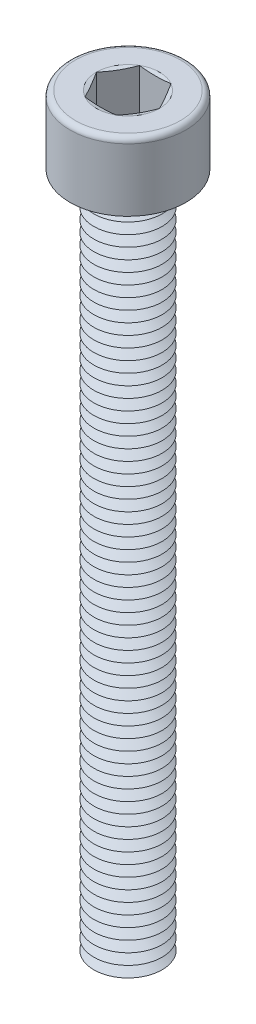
ISO-10303-21;
HEADER;
FILE_DESCRIPTION(('STEP AP214'),'2;1');
FILE_NAME('part.step','',(''),(''),'','','');
FILE_SCHEMA(('AUTOMOTIVE_DESIGN { 1 0 10303 214 1 1 1 1 }'));
ENDSEC;
DATA;
#1=APPLICATION_CONTEXT('core data for automotive mechanical design processes');
#2=APPLICATION_PROTOCOL_DEFINITION('international standard','automotive_design',2000,#1);
#3=PRODUCT_CONTEXT('',#1,'mechanical');
#4=PRODUCT('Part','Part','',(#3));
#5=PRODUCT_RELATED_PRODUCT_CATEGORY('part','',(#4));
#6=PRODUCT_DEFINITION_FORMATION('','',#4);
#7=PRODUCT_DEFINITION_CONTEXT('part definition',#1,'design');
#8=PRODUCT_DEFINITION('design','',#6,#7);
#9=PRODUCT_DEFINITION_SHAPE('','',#8);
#10=(LENGTH_UNIT() NAMED_UNIT(*) SI_UNIT(.MILLI.,.METRE.));
#11=(NAMED_UNIT(*) PLANE_ANGLE_UNIT() SI_UNIT($,.RADIAN.));
#12=(NAMED_UNIT(*) SI_UNIT($,.STERADIAN.) SOLID_ANGLE_UNIT());
#13=UNCERTAINTY_MEASURE_WITH_UNIT(LENGTH_MEASURE(1.E-05),#10,'distance_accuracy_value','');
#14=(GEOMETRIC_REPRESENTATION_CONTEXT(3) GLOBAL_UNCERTAINTY_ASSIGNED_CONTEXT((#13)) GLOBAL_UNIT_ASSIGNED_CONTEXT((#10,
#11,#12)) REPRESENTATION_CONTEXT('',''));
#15=CARTESIAN_POINT('',(0.,0.,0.));
#16=DIRECTION('',(0.,0.,1.));
#17=DIRECTION('',(1.,0.,0.));
#18=AXIS2_PLACEMENT_3D('',#15,#16,#17);
#19=CARTESIAN_POINT('',(0.,3.2,0.));
#20=DIRECTION('',(0.,1.,0.));
#21=DIRECTION('',(0.,0.,1.));
#22=AXIS2_PLACEMENT_3D('',#19,#20,#21);
#23=CONICAL_SURFACE('',#22,1.80717967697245,1.0471975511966);
#24=CARTESIAN_POINT('',(0.,3.6,0.));
#25=DIRECTION('',(0.,1.,0.));
#26=DIRECTION('',(0.,0.,1.));
#27=AXIS2_PLACEMENT_3D('',#24,#25,#26);
#28=CIRCLE('',#27,2.5);
#29=CARTESIAN_POINT('',(0.,3.6,2.5));
#30=VERTEX_POINT('',#29);
#31=EDGE_CURVE('E808',#30,#30,#28,.T.);
#32=ORIENTED_EDGE('',*,*,#31,.F.);
#33=EDGE_LOOP('',(#32));
#34=FACE_BOUND('',#33,.T.);
#35=CARTESIAN_POINT('',(0.,3.2,0.));
#36=DIRECTION('',(0.,1.,0.));
#37=DIRECTION('',(0.,0.,1.));
#38=AXIS2_PLACEMENT_3D('',#35,#36,#37);
#39=CIRCLE('',#38,1.80717967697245);
#40=CARTESIAN_POINT('',(0.,3.2,1.80717967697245));
#41=VERTEX_POINT('',#40);
#42=EDGE_CURVE('E812',#41,#41,#39,.T.);
#43=ORIENTED_EDGE('',*,*,#42,.T.);
#44=EDGE_LOOP('',(#43));
#45=FACE_BOUND('',#44,.T.);
#46=ADVANCED_FACE('F41',(#34,#45),#23,.T.);
#47=CARTESIAN_POINT('',(0.,2.8,0.));
#48=DIRECTION('',(0.,-1.,0.));
#49=DIRECTION('',(0.,0.,-1.));
#50=AXIS2_PLACEMENT_3D('',#47,#48,#49);
#51=CONICAL_SURFACE('',#50,2.5,1.0471975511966);
#52=ORIENTED_EDGE('',*,*,#42,.F.);
#53=EDGE_LOOP('',(#52));
#54=FACE_BOUND('',#53,.T.);
#55=CARTESIAN_POINT('',(0.,2.8,0.));
#56=DIRECTION('',(0.,1.,0.));
#57=DIRECTION('',(0.,0.,1.));
#58=AXIS2_PLACEMENT_3D('',#55,#56,#57);
#59=CIRCLE('',#58,2.5);
#60=CARTESIAN_POINT('',(0.,2.8,2.5));
#61=VERTEX_POINT('',#60);
#62=EDGE_CURVE('E816',#61,#61,#59,.T.);
#63=ORIENTED_EDGE('',*,*,#62,.T.);
#64=EDGE_LOOP('',(#63));
#65=FACE_BOUND('',#64,.T.);
#66=ADVANCED_FACE('F249',(#54,#65),#51,.T.);
#67=CARTESIAN_POINT('',(0.,0.,0.));
#68=DIRECTION('',(0.,1.,0.));
#69=DIRECTION('',(0.,0.,1.));
#70=AXIS2_PLACEMENT_3D('',#67,#68,#69);
#71=PLANE('',#70);
#72=CARTESIAN_POINT('',(0.,0.,0.));
#73=DIRECTION('',(0.,1.,0.));
#74=DIRECTION('',(0.,0.,1.));
#75=AXIS2_PLACEMENT_3D('',#72,#73,#74);
#76=CIRCLE('',#75,1.80717967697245);
#77=CARTESIAN_POINT('',(0.,0.,1.80717967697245));
#78=VERTEX_POINT('',#77);
#79=EDGE_CURVE('E844',#78,#78,#76,.T.);
#80=ORIENTED_EDGE('',*,*,#79,.F.);
#81=EDGE_LOOP('',(#80));
#82=FACE_BOUND('',#81,.T.);
#83=ADVANCED_FACE('F246',(#82),#71,.F.);
#84=CARTESIAN_POINT('',(0.,0.,0.));
#85=DIRECTION('',(0.,1.,0.));
#86=DIRECTION('',(0.,0.,1.));
#87=AXIS2_PLACEMENT_3D('',#84,#85,#86);
#88=CONICAL_SURFACE('',#87,1.80717967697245,1.0471975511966);
#89=CARTESIAN_POINT('',(0.,0.400000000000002,0.));
#90=DIRECTION('',(0.,1.,0.));
#91=DIRECTION('',(0.,0.,1.));
#92=AXIS2_PLACEMENT_3D('',#89,#90,#91);
#93=CIRCLE('',#92,2.5);
#94=CARTESIAN_POINT('',(0.,0.400000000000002,2.5));
#95=VERTEX_POINT('',#94);
#96=EDGE_CURVE('E840',#95,#95,#93,.T.);
#97=ORIENTED_EDGE('',*,*,#96,.F.);
#98=EDGE_LOOP('',(#97));
#99=FACE_BOUND('',#98,.T.);
#100=ORIENTED_EDGE('',*,*,#79,.T.);
#101=EDGE_LOOP('',(#100));
#102=FACE_BOUND('',#101,.T.);
#103=ADVANCED_FACE('F248',(#99,#102),#88,.T.);
#104=CARTESIAN_POINT('',(0.,0.400000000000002,0.));
#105=DIRECTION('',(0.,-1.,0.));
#106=DIRECTION('',(0.,0.,-1.));
#107=AXIS2_PLACEMENT_3D('',#104,#105,#106);
#108=CONICAL_SURFACE('',#107,2.5,1.0471975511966);
#109=CARTESIAN_POINT('',(0.,0.8,0.));
#110=DIRECTION('',(0.,1.,0.));
#111=DIRECTION('',(0.,0.,1.));
#112=AXIS2_PLACEMENT_3D('',#109,#110,#111);
#113=CIRCLE('',#112,1.80717967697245);
#114=CARTESIAN_POINT('',(0.,0.8,1.80717967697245));
#115=VERTEX_POINT('',#114);
#116=EDGE_CURVE('E836',#115,#115,#113,.T.);
#117=ORIENTED_EDGE('',*,*,#116,.F.);
#118=EDGE_LOOP('',(#117));
#119=FACE_BOUND('',#118,.T.);
#120=ORIENTED_EDGE('',*,*,#96,.T.);
#121=EDGE_LOOP('',(#120));
#122=FACE_BOUND('',#121,.T.);
#123=ADVANCED_FACE('F255',(#119,#122),#108,.T.);
#124=CARTESIAN_POINT('',(0.,0.8,0.));
#125=DIRECTION('',(0.,1.,0.));
#126=DIRECTION('',(0.,0.,1.));
#127=AXIS2_PLACEMENT_3D('',#124,#125,#126);
#128=CONICAL_SURFACE('',#127,1.80717967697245,1.0471975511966);
#129=CARTESIAN_POINT('',(0.,1.2,0.));
#130=DIRECTION('',(0.,1.,0.));
#131=DIRECTION('',(0.,0.,1.));
#132=AXIS2_PLACEMENT_3D('',#129,#130,#131);
#133=CIRCLE('',#132,2.5);
#134=CARTESIAN_POINT('',(0.,1.2,2.5));
#135=VERTEX_POINT('',#134);
#136=EDGE_CURVE('E832',#135,#135,#133,.T.);
#137=ORIENTED_EDGE('',*,*,#136,.F.);
#138=EDGE_LOOP('',(#137));
#139=FACE_BOUND('',#138,.T.);
#140=ORIENTED_EDGE('',*,*,#116,.T.);
#141=EDGE_LOOP('',(#140));
#142=FACE_BOUND('',#141,.T.);
#143=ADVANCED_FACE('F283',(#139,#142),#128,.T.);
#144=CARTESIAN_POINT('',(0.,1.2,0.));
#145=DIRECTION('',(0.,-1.,0.));
#146=DIRECTION('',(0.,0.,-1.));
#147=AXIS2_PLACEMENT_3D('',#144,#145,#146);
#148=CONICAL_SURFACE('',#147,2.5,1.0471975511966);
#149=CARTESIAN_POINT('',(0.,1.6,0.));
#150=DIRECTION('',(0.,1.,0.));
#151=DIRECTION('',(0.,0.,1.));
#152=AXIS2_PLACEMENT_3D('',#149,#150,#151);
#153=CIRCLE('',#152,1.80717967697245);
#154=CARTESIAN_POINT('',(0.,1.6,1.80717967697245));
#155=VERTEX_POINT('',#154);
#156=EDGE_CURVE('E828',#155,#155,#153,.T.);
#157=ORIENTED_EDGE('',*,*,#156,.F.);
#158=EDGE_LOOP('',(#157));
#159=FACE_BOUND('',#158,.T.);
#160=ORIENTED_EDGE('',*,*,#136,.T.);
#161=EDGE_LOOP('',(#160));
#162=FACE_BOUND('',#161,.T.);
#163=ADVANCED_FACE('F280',(#159,#162),#148,.T.);
#164=CARTESIAN_POINT('',(0.,1.6,0.));
#165=DIRECTION('',(0.,1.,0.));
#166=DIRECTION('',(0.,0.,1.));
#167=AXIS2_PLACEMENT_3D('',#164,#165,#166);
#168=CONICAL_SURFACE('',#167,1.80717967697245,1.0471975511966);
#169=CARTESIAN_POINT('',(0.,2.,0.));
#170=DIRECTION('',(0.,1.,0.));
#171=DIRECTION('',(0.,0.,1.));
#172=AXIS2_PLACEMENT_3D('',#169,#170,#171);
#173=CIRCLE('',#172,2.5);
#174=CARTESIAN_POINT('',(0.,2.,2.5));
#175=VERTEX_POINT('',#174);
#176=EDGE_CURVE('E824',#175,#175,#173,.T.);
#177=ORIENTED_EDGE('',*,*,#176,.F.);
#178=EDGE_LOOP('',(#177));
#179=FACE_BOUND('',#178,.T.);
#180=ORIENTED_EDGE('',*,*,#156,.T.);
#181=EDGE_LOOP('',(#180));
#182=FACE_BOUND('',#181,.T.);
#183=ADVANCED_FACE('F274',(#179,#182),#168,.T.);
#184=CARTESIAN_POINT('',(0.,2.,0.));
#185=DIRECTION('',(0.,-1.,0.));
#186=DIRECTION('',(0.,0.,-1.));
#187=AXIS2_PLACEMENT_3D('',#184,#185,#186);
#188=CONICAL_SURFACE('',#187,2.5,1.0471975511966);
#189=CARTESIAN_POINT('',(0.,2.4,0.));
#190=DIRECTION('',(0.,1.,0.));
#191=DIRECTION('',(0.,0.,1.));
#192=AXIS2_PLACEMENT_3D('',#189,#190,#191);
#193=CIRCLE('',#192,1.80717967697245);
#194=CARTESIAN_POINT('',(0.,2.4,1.80717967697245));
#195=VERTEX_POINT('',#194);
#196=EDGE_CURVE('E820',#195,#195,#193,.T.);
#197=ORIENTED_EDGE('',*,*,#196,.F.);
#198=EDGE_LOOP('',(#197));
#199=FACE_BOUND('',#198,.T.);
#200=ORIENTED_EDGE('',*,*,#176,.T.);
#201=EDGE_LOOP('',(#200));
#202=FACE_BOUND('',#201,.T.);
#203=ADVANCED_FACE('F270',(#199,#202),#188,.T.);
#204=CARTESIAN_POINT('',(0.,2.4,0.));
#205=DIRECTION('',(0.,1.,0.));
#206=DIRECTION('',(0.,0.,1.));
#207=AXIS2_PLACEMENT_3D('',#204,#205,#206);
#208=CONICAL_SURFACE('',#207,1.80717967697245,1.0471975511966);
#209=ORIENTED_EDGE('',*,*,#62,.F.);
#210=EDGE_LOOP('',(#209));
#211=FACE_BOUND('',#210,.T.);
#212=ORIENTED_EDGE('',*,*,#196,.T.);
#213=EDGE_LOOP('',(#212));
#214=FACE_BOUND('',#213,.T.);
#215=ADVANCED_FACE('F273',(#211,#214),#208,.T.);
#216=CARTESIAN_POINT('',(0.,4.,0.));
#217=DIRECTION('',(0.,1.,0.));
#218=DIRECTION('',(0.,0.,1.));
#219=AXIS2_PLACEMENT_3D('',#216,#217,#218);
#220=CONICAL_SURFACE('',#219,1.80717967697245,1.0471975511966);
#221=CARTESIAN_POINT('',(0.,4.4,0.));
#222=DIRECTION('',(0.,1.,0.));
#223=DIRECTION('',(0.,0.,1.));
#224=AXIS2_PLACEMENT_3D('',#221,#222,#223);
#225=CIRCLE('',#224,2.5);
#226=CARTESIAN_POINT('',(0.,4.4,2.5));
#227=VERTEX_POINT('',#226);
#228=EDGE_CURVE('E800',#227,#227,#225,.T.);
#229=ORIENTED_EDGE('',*,*,#228,.F.);
#230=EDGE_LOOP('',(#229));
#231=FACE_BOUND('',#230,.T.);
#232=CARTESIAN_POINT('',(0.,4.,0.));
#233=DIRECTION('',(0.,1.,0.));
#234=DIRECTION('',(0.,0.,1.));
#235=AXIS2_PLACEMENT_3D('',#232,#233,#234);
#236=CIRCLE('',#235,1.80717967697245);
#237=CARTESIAN_POINT('',(0.,4.,1.80717967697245));
#238=VERTEX_POINT('',#237);
#239=EDGE_CURVE('E804',#238,#238,#236,.T.);
#240=ORIENTED_EDGE('',*,*,#239,.T.);
#241=EDGE_LOOP('',(#240));
#242=FACE_BOUND('',#241,.T.);
#243=ADVANCED_FACE('F278',(#231,#242),#220,.T.);
#244=CARTESIAN_POINT('',(0.,3.6,0.));
#245=DIRECTION('',(0.,-1.,0.));
#246=DIRECTION('',(0.,0.,-1.));
#247=AXIS2_PLACEMENT_3D('',#244,#245,#246);
#248=CONICAL_SURFACE('',#247,2.5,1.0471975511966);
#249=ORIENTED_EDGE('',*,*,#239,.F.);
#250=EDGE_LOOP('',(#249));
#251=FACE_BOUND('',#250,.T.);
#252=ORIENTED_EDGE('',*,*,#31,.T.);
#253=EDGE_LOOP('',(#252));
#254=FACE_BOUND('',#253,.T.);
#255=ADVANCED_FACE('F1099',(#251,#254),#248,.T.);
#256=CARTESIAN_POINT('',(0.,4.8,0.));
#257=DIRECTION('',(0.,1.,0.));
#258=DIRECTION('',(0.,0.,1.));
#259=AXIS2_PLACEMENT_3D('',#256,#257,#258);
#260=CONICAL_SURFACE('',#259,1.80717967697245,1.0471975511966);
#261=CARTESIAN_POINT('',(0.,5.2,0.));
#262=DIRECTION('',(0.,1.,0.));
#263=DIRECTION('',(0.,0.,1.));
#264=AXIS2_PLACEMENT_3D('',#261,#262,#263);
#265=CIRCLE('',#264,2.5);
#266=CARTESIAN_POINT('',(0.,5.2,2.5));
#267=VERTEX_POINT('',#266);
#268=EDGE_CURVE('E792',#267,#267,#265,.T.);
#269=ORIENTED_EDGE('',*,*,#268,.F.);
#270=EDGE_LOOP('',(#269));
#271=FACE_BOUND('',#270,.T.);
#272=CARTESIAN_POINT('',(0.,4.8,0.));
#273=DIRECTION('',(0.,1.,0.));
#274=DIRECTION('',(0.,0.,1.));
#275=AXIS2_PLACEMENT_3D('',#272,#273,#274);
#276=CIRCLE('',#275,1.80717967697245);
#277=CARTESIAN_POINT('',(0.,4.8,1.80717967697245));
#278=VERTEX_POINT('',#277);
#279=EDGE_CURVE('E796',#278,#278,#276,.T.);
#280=ORIENTED_EDGE('',*,*,#279,.T.);
#281=EDGE_LOOP('',(#280));
#282=FACE_BOUND('',#281,.T.);
#283=ADVANCED_FACE('F1108',(#271,#282),#260,.T.);
#284=CARTESIAN_POINT('',(0.,4.4,0.));
#285=DIRECTION('',(0.,-1.,0.));
#286=DIRECTION('',(0.,0.,-1.));
#287=AXIS2_PLACEMENT_3D('',#284,#285,#286);
#288=CONICAL_SURFACE('',#287,2.5,1.0471975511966);
#289=ORIENTED_EDGE('',*,*,#279,.F.);
#290=EDGE_LOOP('',(#289));
#291=FACE_BOUND('',#290,.T.);
#292=ORIENTED_EDGE('',*,*,#228,.T.);
#293=EDGE_LOOP('',(#292));
#294=FACE_BOUND('',#293,.T.);
#295=ADVANCED_FACE('F1118',(#291,#294),#288,.T.);
#296=CARTESIAN_POINT('',(0.,5.6,0.));
#297=DIRECTION('',(0.,1.,0.));
#298=DIRECTION('',(0.,0.,1.));
#299=AXIS2_PLACEMENT_3D('',#296,#297,#298);
#300=CONICAL_SURFACE('',#299,1.80717967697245,1.0471975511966);
#301=CARTESIAN_POINT('',(0.,6.,0.));
#302=DIRECTION('',(0.,1.,0.));
#303=DIRECTION('',(0.,0.,1.));
#304=AXIS2_PLACEMENT_3D('',#301,#302,#303);
#305=CIRCLE('',#304,2.5);
#306=CARTESIAN_POINT('',(0.,6.,2.5));
#307=VERTEX_POINT('',#306);
#308=EDGE_CURVE('E784',#307,#307,#305,.T.);
#309=ORIENTED_EDGE('',*,*,#308,.F.);
#310=EDGE_LOOP('',(#309));
#311=FACE_BOUND('',#310,.T.);
#312=CARTESIAN_POINT('',(0.,5.6,0.));
#313=DIRECTION('',(0.,1.,0.));
#314=DIRECTION('',(0.,0.,1.));
#315=AXIS2_PLACEMENT_3D('',#312,#313,#314);
#316=CIRCLE('',#315,1.80717967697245);
#317=CARTESIAN_POINT('',(0.,5.6,1.80717967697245));
#318=VERTEX_POINT('',#317);
#319=EDGE_CURVE('E788',#318,#318,#316,.T.);
#320=ORIENTED_EDGE('',*,*,#319,.T.);
#321=EDGE_LOOP('',(#320));
#322=FACE_BOUND('',#321,.T.);
#323=ADVANCED_FACE('F1128',(#311,#322),#300,.T.);
#324=CARTESIAN_POINT('',(0.,5.2,0.));
#325=DIRECTION('',(0.,-1.,0.));
#326=DIRECTION('',(0.,0.,-1.));
#327=AXIS2_PLACEMENT_3D('',#324,#325,#326);
#328=CONICAL_SURFACE('',#327,2.5,1.0471975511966);
#329=ORIENTED_EDGE('',*,*,#319,.F.);
#330=EDGE_LOOP('',(#329));
#331=FACE_BOUND('',#330,.T.);
#332=ORIENTED_EDGE('',*,*,#268,.T.);
#333=EDGE_LOOP('',(#332));
#334=FACE_BOUND('',#333,.T.);
#335=ADVANCED_FACE('F1138',(#331,#334),#328,.T.);
#336=CARTESIAN_POINT('',(0.,6.4,0.));
#337=DIRECTION('',(0.,1.,0.));
#338=DIRECTION('',(0.,0.,1.));
#339=AXIS2_PLACEMENT_3D('',#336,#337,#338);
#340=CONICAL_SURFACE('',#339,1.80717967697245,1.0471975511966);
#341=CARTESIAN_POINT('',(0.,6.8,0.));
#342=DIRECTION('',(0.,1.,0.));
#343=DIRECTION('',(0.,0.,1.));
#344=AXIS2_PLACEMENT_3D('',#341,#342,#343);
#345=CIRCLE('',#344,2.5);
#346=CARTESIAN_POINT('',(0.,6.8,2.5));
#347=VERTEX_POINT('',#346);
#348=EDGE_CURVE('E776',#347,#347,#345,.T.);
#349=ORIENTED_EDGE('',*,*,#348,.F.);
#350=EDGE_LOOP('',(#349));
#351=FACE_BOUND('',#350,.T.);
#352=CARTESIAN_POINT('',(0.,6.4,0.));
#353=DIRECTION('',(0.,1.,0.));
#354=DIRECTION('',(0.,0.,1.));
#355=AXIS2_PLACEMENT_3D('',#352,#353,#354);
#356=CIRCLE('',#355,1.80717967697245);
#357=CARTESIAN_POINT('',(0.,6.4,1.80717967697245));
#358=VERTEX_POINT('',#357);
#359=EDGE_CURVE('E780',#358,#358,#356,.T.);
#360=ORIENTED_EDGE('',*,*,#359,.T.);
#361=EDGE_LOOP('',(#360));
#362=FACE_BOUND('',#361,.T.);
#363=ADVANCED_FACE('F1148',(#351,#362),#340,.T.);
#364=CARTESIAN_POINT('',(0.,6.,0.));
#365=DIRECTION('',(0.,-1.,0.));
#366=DIRECTION('',(0.,0.,-1.));
#367=AXIS2_PLACEMENT_3D('',#364,#365,#366);
#368=CONICAL_SURFACE('',#367,2.5,1.0471975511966);
#369=ORIENTED_EDGE('',*,*,#359,.F.);
#370=EDGE_LOOP('',(#369));
#371=FACE_BOUND('',#370,.T.);
#372=ORIENTED_EDGE('',*,*,#308,.T.);
#373=EDGE_LOOP('',(#372));
#374=FACE_BOUND('',#373,.T.);
#375=ADVANCED_FACE('F1158',(#371,#374),#368,.T.);
#376=CARTESIAN_POINT('',(0.,7.2,0.));
#377=DIRECTION('',(0.,1.,0.));
#378=DIRECTION('',(0.,0.,1.));
#379=AXIS2_PLACEMENT_3D('',#376,#377,#378);
#380=CONICAL_SURFACE('',#379,1.80717967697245,1.0471975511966);
#381=CARTESIAN_POINT('',(0.,7.6,0.));
#382=DIRECTION('',(0.,1.,0.));
#383=DIRECTION('',(0.,0.,1.));
#384=AXIS2_PLACEMENT_3D('',#381,#382,#383);
#385=CIRCLE('',#384,2.5);
#386=CARTESIAN_POINT('',(0.,7.6,2.5));
#387=VERTEX_POINT('',#386);
#388=EDGE_CURVE('E768',#387,#387,#385,.T.);
#389=ORIENTED_EDGE('',*,*,#388,.F.);
#390=EDGE_LOOP('',(#389));
#391=FACE_BOUND('',#390,.T.);
#392=CARTESIAN_POINT('',(0.,7.2,0.));
#393=DIRECTION('',(0.,1.,0.));
#394=DIRECTION('',(0.,0.,1.));
#395=AXIS2_PLACEMENT_3D('',#392,#393,#394);
#396=CIRCLE('',#395,1.80717967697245);
#397=CARTESIAN_POINT('',(0.,7.2,1.80717967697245));
#398=VERTEX_POINT('',#397);
#399=EDGE_CURVE('E772',#398,#398,#396,.T.);
#400=ORIENTED_EDGE('',*,*,#399,.T.);
#401=EDGE_LOOP('',(#400));
#402=FACE_BOUND('',#401,.T.);
#403=ADVANCED_FACE('F1168',(#391,#402),#380,.T.);
#404=CARTESIAN_POINT('',(0.,6.8,0.));
#405=DIRECTION('',(0.,-1.,0.));
#406=DIRECTION('',(0.,0.,-1.));
#407=AXIS2_PLACEMENT_3D('',#404,#405,#406);
#408=CONICAL_SURFACE('',#407,2.5,1.0471975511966);
#409=ORIENTED_EDGE('',*,*,#399,.F.);
#410=EDGE_LOOP('',(#409));
#411=FACE_BOUND('',#410,.T.);
#412=ORIENTED_EDGE('',*,*,#348,.T.);
#413=EDGE_LOOP('',(#412));
#414=FACE_BOUND('',#413,.T.);
#415=ADVANCED_FACE('F1178',(#411,#414),#408,.T.);
#416=CARTESIAN_POINT('',(0.,8.,0.));
#417=DIRECTION('',(0.,1.,0.));
#418=DIRECTION('',(0.,0.,1.));
#419=AXIS2_PLACEMENT_3D('',#416,#417,#418);
#420=CONICAL_SURFACE('',#419,1.80717967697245,1.0471975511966);
#421=CARTESIAN_POINT('',(0.,8.4,0.));
#422=DIRECTION('',(0.,1.,0.));
#423=DIRECTION('',(0.,0.,1.));
#424=AXIS2_PLACEMENT_3D('',#421,#422,#423);
#425=CIRCLE('',#424,2.5);
#426=CARTESIAN_POINT('',(0.,8.4,2.5));
#427=VERTEX_POINT('',#426);
#428=EDGE_CURVE('E760',#427,#427,#425,.T.);
#429=ORIENTED_EDGE('',*,*,#428,.F.);
#430=EDGE_LOOP('',(#429));
#431=FACE_BOUND('',#430,.T.);
#432=CARTESIAN_POINT('',(0.,8.,0.));
#433=DIRECTION('',(0.,1.,0.));
#434=DIRECTION('',(0.,0.,1.));
#435=AXIS2_PLACEMENT_3D('',#432,#433,#434);
#436=CIRCLE('',#435,1.80717967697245);
#437=CARTESIAN_POINT('',(0.,8.,1.80717967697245));
#438=VERTEX_POINT('',#437);
#439=EDGE_CURVE('E764',#438,#438,#436,.T.);
#440=ORIENTED_EDGE('',*,*,#439,.T.);
#441=EDGE_LOOP('',(#440));
#442=FACE_BOUND('',#441,.T.);
#443=ADVANCED_FACE('F1188',(#431,#442),#420,.T.);
#444=CARTESIAN_POINT('',(0.,7.6,0.));
#445=DIRECTION('',(0.,-1.,0.));
#446=DIRECTION('',(0.,0.,-1.));
#447=AXIS2_PLACEMENT_3D('',#444,#445,#446);
#448=CONICAL_SURFACE('',#447,2.5,1.0471975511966);
#449=ORIENTED_EDGE('',*,*,#439,.F.);
#450=EDGE_LOOP('',(#449));
#451=FACE_BOUND('',#450,.T.);
#452=ORIENTED_EDGE('',*,*,#388,.T.);
#453=EDGE_LOOP('',(#452));
#454=FACE_BOUND('',#453,.T.);
#455=ADVANCED_FACE('F1198',(#451,#454),#448,.T.);
#456=CARTESIAN_POINT('',(0.,8.8,0.));
#457=DIRECTION('',(0.,1.,0.));
#458=DIRECTION('',(0.,0.,1.));
#459=AXIS2_PLACEMENT_3D('',#456,#457,#458);
#460=CONICAL_SURFACE('',#459,1.80717967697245,1.0471975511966);
#461=CARTESIAN_POINT('',(0.,9.2,0.));
#462=DIRECTION('',(0.,1.,0.));
#463=DIRECTION('',(0.,0.,1.));
#464=AXIS2_PLACEMENT_3D('',#461,#462,#463);
#465=CIRCLE('',#464,2.5);
#466=CARTESIAN_POINT('',(0.,9.2,2.5));
#467=VERTEX_POINT('',#466);
#468=EDGE_CURVE('E752',#467,#467,#465,.T.);
#469=ORIENTED_EDGE('',*,*,#468,.F.);
#470=EDGE_LOOP('',(#469));
#471=FACE_BOUND('',#470,.T.);
#472=CARTESIAN_POINT('',(0.,8.8,0.));
#473=DIRECTION('',(0.,1.,0.));
#474=DIRECTION('',(0.,0.,1.));
#475=AXIS2_PLACEMENT_3D('',#472,#473,#474);
#476=CIRCLE('',#475,1.80717967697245);
#477=CARTESIAN_POINT('',(0.,8.8,1.80717967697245));
#478=VERTEX_POINT('',#477);
#479=EDGE_CURVE('E756',#478,#478,#476,.T.);
#480=ORIENTED_EDGE('',*,*,#479,.T.);
#481=EDGE_LOOP('',(#480));
#482=FACE_BOUND('',#481,.T.);
#483=ADVANCED_FACE('F1208',(#471,#482),#460,.T.);
#484=CARTESIAN_POINT('',(0.,8.4,0.));
#485=DIRECTION('',(0.,-1.,0.));
#486=DIRECTION('',(0.,0.,-1.));
#487=AXIS2_PLACEMENT_3D('',#484,#485,#486);
#488=CONICAL_SURFACE('',#487,2.5,1.0471975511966);
#489=ORIENTED_EDGE('',*,*,#479,.F.);
#490=EDGE_LOOP('',(#489));
#491=FACE_BOUND('',#490,.T.);
#492=ORIENTED_EDGE('',*,*,#428,.T.);
#493=EDGE_LOOP('',(#492));
#494=FACE_BOUND('',#493,.T.);
#495=ADVANCED_FACE('F1218',(#491,#494),#488,.T.);
#496=CARTESIAN_POINT('',(0.,9.6,0.));
#497=DIRECTION('',(0.,1.,0.));
#498=DIRECTION('',(0.,0.,1.));
#499=AXIS2_PLACEMENT_3D('',#496,#497,#498);
#500=CONICAL_SURFACE('',#499,1.80717967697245,1.0471975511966);
#501=CARTESIAN_POINT('',(0.,10.,0.));
#502=DIRECTION('',(0.,1.,0.));
#503=DIRECTION('',(0.,0.,1.));
#504=AXIS2_PLACEMENT_3D('',#501,#502,#503);
#505=CIRCLE('',#504,2.5);
#506=CARTESIAN_POINT('',(0.,10.,2.5));
#507=VERTEX_POINT('',#506);
#508=EDGE_CURVE('E744',#507,#507,#505,.T.);
#509=ORIENTED_EDGE('',*,*,#508,.F.);
#510=EDGE_LOOP('',(#509));
#511=FACE_BOUND('',#510,.T.);
#512=CARTESIAN_POINT('',(0.,9.6,0.));
#513=DIRECTION('',(0.,1.,0.));
#514=DIRECTION('',(0.,0.,1.));
#515=AXIS2_PLACEMENT_3D('',#512,#513,#514);
#516=CIRCLE('',#515,1.80717967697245);
#517=CARTESIAN_POINT('',(0.,9.6,1.80717967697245));
#518=VERTEX_POINT('',#517);
#519=EDGE_CURVE('E748',#518,#518,#516,.T.);
#520=ORIENTED_EDGE('',*,*,#519,.T.);
#521=EDGE_LOOP('',(#520));
#522=FACE_BOUND('',#521,.T.);
#523=ADVANCED_FACE('F1228',(#511,#522),#500,.T.);
#524=CARTESIAN_POINT('',(0.,9.2,0.));
#525=DIRECTION('',(0.,-1.,0.));
#526=DIRECTION('',(0.,0.,-1.));
#527=AXIS2_PLACEMENT_3D('',#524,#525,#526);
#528=CONICAL_SURFACE('',#527,2.5,1.0471975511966);
#529=ORIENTED_EDGE('',*,*,#519,.F.);
#530=EDGE_LOOP('',(#529));
#531=FACE_BOUND('',#530,.T.);
#532=ORIENTED_EDGE('',*,*,#468,.T.);
#533=EDGE_LOOP('',(#532));
#534=FACE_BOUND('',#533,.T.);
#535=ADVANCED_FACE('F1238',(#531,#534),#528,.T.);
#536=CARTESIAN_POINT('',(0.,10.4,0.));
#537=DIRECTION('',(0.,1.,0.));
#538=DIRECTION('',(0.,0.,1.));
#539=AXIS2_PLACEMENT_3D('',#536,#537,#538);
#540=CONICAL_SURFACE('',#539,1.80717967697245,1.0471975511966);
#541=CARTESIAN_POINT('',(0.,10.8,0.));
#542=DIRECTION('',(0.,1.,0.));
#543=DIRECTION('',(0.,0.,1.));
#544=AXIS2_PLACEMENT_3D('',#541,#542,#543);
#545=CIRCLE('',#544,2.5);
#546=CARTESIAN_POINT('',(0.,10.8,2.5));
#547=VERTEX_POINT('',#546);
#548=EDGE_CURVE('E736',#547,#547,#545,.T.);
#549=ORIENTED_EDGE('',*,*,#548,.F.);
#550=EDGE_LOOP('',(#549));
#551=FACE_BOUND('',#550,.T.);
#552=CARTESIAN_POINT('',(0.,10.4,0.));
#553=DIRECTION('',(0.,1.,0.));
#554=DIRECTION('',(0.,0.,1.));
#555=AXIS2_PLACEMENT_3D('',#552,#553,#554);
#556=CIRCLE('',#555,1.80717967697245);
#557=CARTESIAN_POINT('',(0.,10.4,1.80717967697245));
#558=VERTEX_POINT('',#557);
#559=EDGE_CURVE('E740',#558,#558,#556,.T.);
#560=ORIENTED_EDGE('',*,*,#559,.T.);
#561=EDGE_LOOP('',(#560));
#562=FACE_BOUND('',#561,.T.);
#563=ADVANCED_FACE('F1248',(#551,#562),#540,.T.);
#564=CARTESIAN_POINT('',(0.,10.,0.));
#565=DIRECTION('',(0.,-1.,0.));
#566=DIRECTION('',(0.,0.,-1.));
#567=AXIS2_PLACEMENT_3D('',#564,#565,#566);
#568=CONICAL_SURFACE('',#567,2.5,1.0471975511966);
#569=ORIENTED_EDGE('',*,*,#559,.F.);
#570=EDGE_LOOP('',(#569));
#571=FACE_BOUND('',#570,.T.);
#572=ORIENTED_EDGE('',*,*,#508,.T.);
#573=EDGE_LOOP('',(#572));
#574=FACE_BOUND('',#573,.T.);
#575=ADVANCED_FACE('F1258',(#571,#574),#568,.T.);
#576=CARTESIAN_POINT('',(0.,11.2,0.));
#577=DIRECTION('',(0.,1.,0.));
#578=DIRECTION('',(0.,0.,1.));
#579=AXIS2_PLACEMENT_3D('',#576,#577,#578);
#580=CONICAL_SURFACE('',#579,1.80717967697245,1.0471975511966);
#581=CARTESIAN_POINT('',(0.,11.6,0.));
#582=DIRECTION('',(0.,1.,0.));
#583=DIRECTION('',(0.,0.,1.));
#584=AXIS2_PLACEMENT_3D('',#581,#582,#583);
#585=CIRCLE('',#584,2.5);
#586=CARTESIAN_POINT('',(0.,11.6,2.5));
#587=VERTEX_POINT('',#586);
#588=EDGE_CURVE('E728',#587,#587,#585,.T.);
#589=ORIENTED_EDGE('',*,*,#588,.F.);
#590=EDGE_LOOP('',(#589));
#591=FACE_BOUND('',#590,.T.);
#592=CARTESIAN_POINT('',(0.,11.2,0.));
#593=DIRECTION('',(0.,1.,0.));
#594=DIRECTION('',(0.,0.,1.));
#595=AXIS2_PLACEMENT_3D('',#592,#593,#594);
#596=CIRCLE('',#595,1.80717967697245);
#597=CARTESIAN_POINT('',(0.,11.2,1.80717967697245));
#598=VERTEX_POINT('',#597);
#599=EDGE_CURVE('E732',#598,#598,#596,.T.);
#600=ORIENTED_EDGE('',*,*,#599,.T.);
#601=EDGE_LOOP('',(#600));
#602=FACE_BOUND('',#601,.T.);
#603=ADVANCED_FACE('F1268',(#591,#602),#580,.T.);
#604=CARTESIAN_POINT('',(0.,10.8,0.));
#605=DIRECTION('',(0.,-1.,0.));
#606=DIRECTION('',(0.,0.,-1.));
#607=AXIS2_PLACEMENT_3D('',#604,#605,#606);
#608=CONICAL_SURFACE('',#607,2.5,1.0471975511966);
#609=ORIENTED_EDGE('',*,*,#599,.F.);
#610=EDGE_LOOP('',(#609));
#611=FACE_BOUND('',#610,.T.);
#612=ORIENTED_EDGE('',*,*,#548,.T.);
#613=EDGE_LOOP('',(#612));
#614=FACE_BOUND('',#613,.T.);
#615=ADVANCED_FACE('F1278',(#611,#614),#608,.T.);
#616=CARTESIAN_POINT('',(0.,12.,0.));
#617=DIRECTION('',(0.,1.,0.));
#618=DIRECTION('',(0.,0.,1.));
#619=AXIS2_PLACEMENT_3D('',#616,#617,#618);
#620=CONICAL_SURFACE('',#619,1.80717967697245,1.0471975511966);
#621=CARTESIAN_POINT('',(0.,12.4,0.));
#622=DIRECTION('',(0.,1.,0.));
#623=DIRECTION('',(0.,0.,1.));
#624=AXIS2_PLACEMENT_3D('',#621,#622,#623);
#625=CIRCLE('',#624,2.5);
#626=CARTESIAN_POINT('',(0.,12.4,2.5));
#627=VERTEX_POINT('',#626);
#628=EDGE_CURVE('E720',#627,#627,#625,.T.);
#629=ORIENTED_EDGE('',*,*,#628,.F.);
#630=EDGE_LOOP('',(#629));
#631=FACE_BOUND('',#630,.T.);
#632=CARTESIAN_POINT('',(0.,12.,0.));
#633=DIRECTION('',(0.,1.,0.));
#634=DIRECTION('',(0.,0.,1.));
#635=AXIS2_PLACEMENT_3D('',#632,#633,#634);
#636=CIRCLE('',#635,1.80717967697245);
#637=CARTESIAN_POINT('',(0.,12.,1.80717967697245));
#638=VERTEX_POINT('',#637);
#639=EDGE_CURVE('E724',#638,#638,#636,.T.);
#640=ORIENTED_EDGE('',*,*,#639,.T.);
#641=EDGE_LOOP('',(#640));
#642=FACE_BOUND('',#641,.T.);
#643=ADVANCED_FACE('F1288',(#631,#642),#620,.T.);
#644=CARTESIAN_POINT('',(0.,11.6,0.));
#645=DIRECTION('',(0.,-1.,0.));
#646=DIRECTION('',(0.,0.,-1.));
#647=AXIS2_PLACEMENT_3D('',#644,#645,#646);
#648=CONICAL_SURFACE('',#647,2.5,1.0471975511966);
#649=ORIENTED_EDGE('',*,*,#639,.F.);
#650=EDGE_LOOP('',(#649));
#651=FACE_BOUND('',#650,.T.);
#652=ORIENTED_EDGE('',*,*,#588,.T.);
#653=EDGE_LOOP('',(#652));
#654=FACE_BOUND('',#653,.T.);
#655=ADVANCED_FACE('F1298',(#651,#654),#648,.T.);
#656=CARTESIAN_POINT('',(0.,12.8,0.));
#657=DIRECTION('',(0.,1.,0.));
#658=DIRECTION('',(0.,0.,1.));
#659=AXIS2_PLACEMENT_3D('',#656,#657,#658);
#660=CONICAL_SURFACE('',#659,1.80717967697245,1.0471975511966);
#661=CARTESIAN_POINT('',(0.,13.2,0.));
#662=DIRECTION('',(0.,1.,0.));
#663=DIRECTION('',(0.,0.,1.));
#664=AXIS2_PLACEMENT_3D('',#661,#662,#663);
#665=CIRCLE('',#664,2.5);
#666=CARTESIAN_POINT('',(0.,13.2,2.5));
#667=VERTEX_POINT('',#666);
#668=EDGE_CURVE('E712',#667,#667,#665,.T.);
#669=ORIENTED_EDGE('',*,*,#668,.F.);
#670=EDGE_LOOP('',(#669));
#671=FACE_BOUND('',#670,.T.);
#672=CARTESIAN_POINT('',(0.,12.8,0.));
#673=DIRECTION('',(0.,1.,0.));
#674=DIRECTION('',(0.,0.,1.));
#675=AXIS2_PLACEMENT_3D('',#672,#673,#674);
#676=CIRCLE('',#675,1.80717967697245);
#677=CARTESIAN_POINT('',(0.,12.8,1.80717967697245));
#678=VERTEX_POINT('',#677);
#679=EDGE_CURVE('E716',#678,#678,#676,.T.);
#680=ORIENTED_EDGE('',*,*,#679,.T.);
#681=EDGE_LOOP('',(#680));
#682=FACE_BOUND('',#681,.T.);
#683=ADVANCED_FACE('F1308',(#671,#682),#660,.T.);
#684=CARTESIAN_POINT('',(0.,12.4,0.));
#685=DIRECTION('',(0.,-1.,0.));
#686=DIRECTION('',(0.,0.,-1.));
#687=AXIS2_PLACEMENT_3D('',#684,#685,#686);
#688=CONICAL_SURFACE('',#687,2.5,1.0471975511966);
#689=ORIENTED_EDGE('',*,*,#679,.F.);
#690=EDGE_LOOP('',(#689));
#691=FACE_BOUND('',#690,.T.);
#692=ORIENTED_EDGE('',*,*,#628,.T.);
#693=EDGE_LOOP('',(#692));
#694=FACE_BOUND('',#693,.T.);
#695=ADVANCED_FACE('F1318',(#691,#694),#688,.T.);
#696=CARTESIAN_POINT('',(0.,13.6,0.));
#697=DIRECTION('',(0.,1.,0.));
#698=DIRECTION('',(0.,0.,1.));
#699=AXIS2_PLACEMENT_3D('',#696,#697,#698);
#700=CONICAL_SURFACE('',#699,1.80717967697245,1.0471975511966);
#701=CARTESIAN_POINT('',(0.,14.,0.));
#702=DIRECTION('',(0.,1.,0.));
#703=DIRECTION('',(0.,0.,1.));
#704=AXIS2_PLACEMENT_3D('',#701,#702,#703);
#705=CIRCLE('',#704,2.5);
#706=CARTESIAN_POINT('',(0.,14.,2.5));
#707=VERTEX_POINT('',#706);
#708=EDGE_CURVE('E704',#707,#707,#705,.T.);
#709=ORIENTED_EDGE('',*,*,#708,.F.);
#710=EDGE_LOOP('',(#709));
#711=FACE_BOUND('',#710,.T.);
#712=CARTESIAN_POINT('',(0.,13.6,0.));
#713=DIRECTION('',(0.,1.,0.));
#714=DIRECTION('',(0.,0.,1.));
#715=AXIS2_PLACEMENT_3D('',#712,#713,#714);
#716=CIRCLE('',#715,1.80717967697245);
#717=CARTESIAN_POINT('',(0.,13.6,1.80717967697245));
#718=VERTEX_POINT('',#717);
#719=EDGE_CURVE('E708',#718,#718,#716,.T.);
#720=ORIENTED_EDGE('',*,*,#719,.T.);
#721=EDGE_LOOP('',(#720));
#722=FACE_BOUND('',#721,.T.);
#723=ADVANCED_FACE('F1328',(#711,#722),#700,.T.);
#724=CARTESIAN_POINT('',(0.,13.2,0.));
#725=DIRECTION('',(0.,-1.,0.));
#726=DIRECTION('',(0.,0.,-1.));
#727=AXIS2_PLACEMENT_3D('',#724,#725,#726);
#728=CONICAL_SURFACE('',#727,2.5,1.0471975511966);
#729=ORIENTED_EDGE('',*,*,#719,.F.);
#730=EDGE_LOOP('',(#729));
#731=FACE_BOUND('',#730,.T.);
#732=ORIENTED_EDGE('',*,*,#668,.T.);
#733=EDGE_LOOP('',(#732));
#734=FACE_BOUND('',#733,.T.);
#735=ADVANCED_FACE('F1338',(#731,#734),#728,.T.);
#736=CARTESIAN_POINT('',(0.,14.4,0.));
#737=DIRECTION('',(0.,1.,0.));
#738=DIRECTION('',(0.,0.,1.));
#739=AXIS2_PLACEMENT_3D('',#736,#737,#738);
#740=CONICAL_SURFACE('',#739,1.80717967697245,1.0471975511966);
#741=CARTESIAN_POINT('',(0.,14.8,0.));
#742=DIRECTION('',(0.,1.,0.));
#743=DIRECTION('',(0.,0.,1.));
#744=AXIS2_PLACEMENT_3D('',#741,#742,#743);
#745=CIRCLE('',#744,2.5);
#746=CARTESIAN_POINT('',(0.,14.8,2.5));
#747=VERTEX_POINT('',#746);
#748=EDGE_CURVE('E696',#747,#747,#745,.T.);
#749=ORIENTED_EDGE('',*,*,#748,.F.);
#750=EDGE_LOOP('',(#749));
#751=FACE_BOUND('',#750,.T.);
#752=CARTESIAN_POINT('',(0.,14.4,0.));
#753=DIRECTION('',(0.,1.,0.));
#754=DIRECTION('',(0.,0.,1.));
#755=AXIS2_PLACEMENT_3D('',#752,#753,#754);
#756=CIRCLE('',#755,1.80717967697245);
#757=CARTESIAN_POINT('',(0.,14.4,1.80717967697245));
#758=VERTEX_POINT('',#757);
#759=EDGE_CURVE('E700',#758,#758,#756,.T.);
#760=ORIENTED_EDGE('',*,*,#759,.T.);
#761=EDGE_LOOP('',(#760));
#762=FACE_BOUND('',#761,.T.);
#763=ADVANCED_FACE('F1348',(#751,#762),#740,.T.);
#764=CARTESIAN_POINT('',(0.,14.,0.));
#765=DIRECTION('',(0.,-1.,0.));
#766=DIRECTION('',(0.,0.,-1.));
#767=AXIS2_PLACEMENT_3D('',#764,#765,#766);
#768=CONICAL_SURFACE('',#767,2.5,1.0471975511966);
#769=ORIENTED_EDGE('',*,*,#759,.F.);
#770=EDGE_LOOP('',(#769));
#771=FACE_BOUND('',#770,.T.);
#772=ORIENTED_EDGE('',*,*,#708,.T.);
#773=EDGE_LOOP('',(#772));
#774=FACE_BOUND('',#773,.T.);
#775=ADVANCED_FACE('F1358',(#771,#774),#768,.T.);
#776=CARTESIAN_POINT('',(0.,15.2,0.));
#777=DIRECTION('',(0.,1.,0.));
#778=DIRECTION('',(0.,0.,1.));
#779=AXIS2_PLACEMENT_3D('',#776,#777,#778);
#780=CONICAL_SURFACE('',#779,1.80717967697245,1.0471975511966);
#781=CARTESIAN_POINT('',(0.,15.6,0.));
#782=DIRECTION('',(0.,1.,0.));
#783=DIRECTION('',(0.,0.,1.));
#784=AXIS2_PLACEMENT_3D('',#781,#782,#783);
#785=CIRCLE('',#784,2.5);
#786=CARTESIAN_POINT('',(0.,15.6,2.5));
#787=VERTEX_POINT('',#786);
#788=EDGE_CURVE('E688',#787,#787,#785,.T.);
#789=ORIENTED_EDGE('',*,*,#788,.F.);
#790=EDGE_LOOP('',(#789));
#791=FACE_BOUND('',#790,.T.);
#792=CARTESIAN_POINT('',(0.,15.2,0.));
#793=DIRECTION('',(0.,1.,0.));
#794=DIRECTION('',(0.,0.,1.));
#795=AXIS2_PLACEMENT_3D('',#792,#793,#794);
#796=CIRCLE('',#795,1.80717967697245);
#797=CARTESIAN_POINT('',(0.,15.2,1.80717967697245));
#798=VERTEX_POINT('',#797);
#799=EDGE_CURVE('E692',#798,#798,#796,.T.);
#800=ORIENTED_EDGE('',*,*,#799,.T.);
#801=EDGE_LOOP('',(#800));
#802=FACE_BOUND('',#801,.T.);
#803=ADVANCED_FACE('F1368',(#791,#802),#780,.T.);
#804=CARTESIAN_POINT('',(0.,14.8,0.));
#805=DIRECTION('',(0.,-1.,0.));
#806=DIRECTION('',(0.,0.,-1.));
#807=AXIS2_PLACEMENT_3D('',#804,#805,#806);
#808=CONICAL_SURFACE('',#807,2.5,1.0471975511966);
#809=ORIENTED_EDGE('',*,*,#799,.F.);
#810=EDGE_LOOP('',(#809));
#811=FACE_BOUND('',#810,.T.);
#812=ORIENTED_EDGE('',*,*,#748,.T.);
#813=EDGE_LOOP('',(#812));
#814=FACE_BOUND('',#813,.T.);
#815=ADVANCED_FACE('F1378',(#811,#814),#808,.T.);
#816=CARTESIAN_POINT('',(0.,16.,0.));
#817=DIRECTION('',(0.,1.,0.));
#818=DIRECTION('',(0.,0.,1.));
#819=AXIS2_PLACEMENT_3D('',#816,#817,#818);
#820=CONICAL_SURFACE('',#819,1.80717967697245,1.0471975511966);
#821=CARTESIAN_POINT('',(0.,16.4,0.));
#822=DIRECTION('',(0.,1.,0.));
#823=DIRECTION('',(0.,0.,1.));
#824=AXIS2_PLACEMENT_3D('',#821,#822,#823);
#825=CIRCLE('',#824,2.5);
#826=CARTESIAN_POINT('',(0.,16.4,2.5));
#827=VERTEX_POINT('',#826);
#828=EDGE_CURVE('E680',#827,#827,#825,.T.);
#829=ORIENTED_EDGE('',*,*,#828,.F.);
#830=EDGE_LOOP('',(#829));
#831=FACE_BOUND('',#830,.T.);
#832=CARTESIAN_POINT('',(0.,16.,0.));
#833=DIRECTION('',(0.,1.,0.));
#834=DIRECTION('',(0.,0.,1.));
#835=AXIS2_PLACEMENT_3D('',#832,#833,#834);
#836=CIRCLE('',#835,1.80717967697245);
#837=CARTESIAN_POINT('',(0.,16.,1.80717967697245));
#838=VERTEX_POINT('',#837);
#839=EDGE_CURVE('E684',#838,#838,#836,.T.);
#840=ORIENTED_EDGE('',*,*,#839,.T.);
#841=EDGE_LOOP('',(#840));
#842=FACE_BOUND('',#841,.T.);
#843=ADVANCED_FACE('F1388',(#831,#842),#820,.T.);
#844=CARTESIAN_POINT('',(0.,15.6,0.));
#845=DIRECTION('',(0.,-1.,0.));
#846=DIRECTION('',(0.,0.,-1.));
#847=AXIS2_PLACEMENT_3D('',#844,#845,#846);
#848=CONICAL_SURFACE('',#847,2.5,1.0471975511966);
#849=ORIENTED_EDGE('',*,*,#839,.F.);
#850=EDGE_LOOP('',(#849));
#851=FACE_BOUND('',#850,.T.);
#852=ORIENTED_EDGE('',*,*,#788,.T.);
#853=EDGE_LOOP('',(#852));
#854=FACE_BOUND('',#853,.T.);
#855=ADVANCED_FACE('F1398',(#851,#854),#848,.T.);
#856=CARTESIAN_POINT('',(0.,16.8,0.));
#857=DIRECTION('',(0.,1.,0.));
#858=DIRECTION('',(0.,0.,1.));
#859=AXIS2_PLACEMENT_3D('',#856,#857,#858);
#860=CONICAL_SURFACE('',#859,1.80717967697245,1.0471975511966);
#861=CARTESIAN_POINT('',(0.,17.2,0.));
#862=DIRECTION('',(0.,1.,0.));
#863=DIRECTION('',(0.,0.,1.));
#864=AXIS2_PLACEMENT_3D('',#861,#862,#863);
#865=CIRCLE('',#864,2.5);
#866=CARTESIAN_POINT('',(0.,17.2,2.5));
#867=VERTEX_POINT('',#866);
#868=EDGE_CURVE('E672',#867,#867,#865,.T.);
#869=ORIENTED_EDGE('',*,*,#868,.F.);
#870=EDGE_LOOP('',(#869));
#871=FACE_BOUND('',#870,.T.);
#872=CARTESIAN_POINT('',(0.,16.8,0.));
#873=DIRECTION('',(0.,1.,0.));
#874=DIRECTION('',(0.,0.,1.));
#875=AXIS2_PLACEMENT_3D('',#872,#873,#874);
#876=CIRCLE('',#875,1.80717967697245);
#877=CARTESIAN_POINT('',(0.,16.8,1.80717967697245));
#878=VERTEX_POINT('',#877);
#879=EDGE_CURVE('E676',#878,#878,#876,.T.);
#880=ORIENTED_EDGE('',*,*,#879,.T.);
#881=EDGE_LOOP('',(#880));
#882=FACE_BOUND('',#881,.T.);
#883=ADVANCED_FACE('F1408',(#871,#882),#860,.T.);
#884=CARTESIAN_POINT('',(0.,16.4,0.));
#885=DIRECTION('',(0.,-1.,0.));
#886=DIRECTION('',(0.,0.,-1.));
#887=AXIS2_PLACEMENT_3D('',#884,#885,#886);
#888=CONICAL_SURFACE('',#887,2.5,1.0471975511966);
#889=ORIENTED_EDGE('',*,*,#879,.F.);
#890=EDGE_LOOP('',(#889));
#891=FACE_BOUND('',#890,.T.);
#892=ORIENTED_EDGE('',*,*,#828,.T.);
#893=EDGE_LOOP('',(#892));
#894=FACE_BOUND('',#893,.T.);
#895=ADVANCED_FACE('F1418',(#891,#894),#888,.T.);
#896=CARTESIAN_POINT('',(0.,17.6,0.));
#897=DIRECTION('',(0.,1.,0.));
#898=DIRECTION('',(0.,0.,1.));
#899=AXIS2_PLACEMENT_3D('',#896,#897,#898);
#900=CONICAL_SURFACE('',#899,1.80717967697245,1.0471975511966);
#901=CARTESIAN_POINT('',(0.,18.,0.));
#902=DIRECTION('',(0.,1.,0.));
#903=DIRECTION('',(0.,0.,1.));
#904=AXIS2_PLACEMENT_3D('',#901,#902,#903);
#905=CIRCLE('',#904,2.5);
#906=CARTESIAN_POINT('',(0.,18.,2.5));
#907=VERTEX_POINT('',#906);
#908=EDGE_CURVE('E664',#907,#907,#905,.T.);
#909=ORIENTED_EDGE('',*,*,#908,.F.);
#910=EDGE_LOOP('',(#909));
#911=FACE_BOUND('',#910,.T.);
#912=CARTESIAN_POINT('',(0.,17.6,0.));
#913=DIRECTION('',(0.,1.,0.));
#914=DIRECTION('',(0.,0.,1.));
#915=AXIS2_PLACEMENT_3D('',#912,#913,#914);
#916=CIRCLE('',#915,1.80717967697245);
#917=CARTESIAN_POINT('',(0.,17.6,1.80717967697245));
#918=VERTEX_POINT('',#917);
#919=EDGE_CURVE('E668',#918,#918,#916,.T.);
#920=ORIENTED_EDGE('',*,*,#919,.T.);
#921=EDGE_LOOP('',(#920));
#922=FACE_BOUND('',#921,.T.);
#923=ADVANCED_FACE('F1428',(#911,#922),#900,.T.);
#924=CARTESIAN_POINT('',(0.,17.2,0.));
#925=DIRECTION('',(0.,-1.,0.));
#926=DIRECTION('',(0.,0.,-1.));
#927=AXIS2_PLACEMENT_3D('',#924,#925,#926);
#928=CONICAL_SURFACE('',#927,2.5,1.0471975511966);
#929=ORIENTED_EDGE('',*,*,#919,.F.);
#930=EDGE_LOOP('',(#929));
#931=FACE_BOUND('',#930,.T.);
#932=ORIENTED_EDGE('',*,*,#868,.T.);
#933=EDGE_LOOP('',(#932));
#934=FACE_BOUND('',#933,.T.);
#935=ADVANCED_FACE('F1438',(#931,#934),#928,.T.);
#936=CARTESIAN_POINT('',(0.,18.4,0.));
#937=DIRECTION('',(0.,1.,0.));
#938=DIRECTION('',(0.,0.,1.));
#939=AXIS2_PLACEMENT_3D('',#936,#937,#938);
#940=CONICAL_SURFACE('',#939,1.80717967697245,1.0471975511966);
#941=CARTESIAN_POINT('',(0.,18.8,0.));
#942=DIRECTION('',(0.,1.,0.));
#943=DIRECTION('',(0.,0.,1.));
#944=AXIS2_PLACEMENT_3D('',#941,#942,#943);
#945=CIRCLE('',#944,2.5);
#946=CARTESIAN_POINT('',(0.,18.8,2.5));
#947=VERTEX_POINT('',#946);
#948=EDGE_CURVE('E656',#947,#947,#945,.T.);
#949=ORIENTED_EDGE('',*,*,#948,.F.);
#950=EDGE_LOOP('',(#949));
#951=FACE_BOUND('',#950,.T.);
#952=CARTESIAN_POINT('',(0.,18.4,0.));
#953=DIRECTION('',(0.,1.,0.));
#954=DIRECTION('',(0.,0.,1.));
#955=AXIS2_PLACEMENT_3D('',#952,#953,#954);
#956=CIRCLE('',#955,1.80717967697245);
#957=CARTESIAN_POINT('',(0.,18.4,1.80717967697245));
#958=VERTEX_POINT('',#957);
#959=EDGE_CURVE('E660',#958,#958,#956,.T.);
#960=ORIENTED_EDGE('',*,*,#959,.T.);
#961=EDGE_LOOP('',(#960));
#962=FACE_BOUND('',#961,.T.);
#963=ADVANCED_FACE('F1448',(#951,#962),#940,.T.);
#964=CARTESIAN_POINT('',(0.,18.,0.));
#965=DIRECTION('',(0.,-1.,0.));
#966=DIRECTION('',(0.,0.,-1.));
#967=AXIS2_PLACEMENT_3D('',#964,#965,#966);
#968=CONICAL_SURFACE('',#967,2.5,1.0471975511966);
#969=ORIENTED_EDGE('',*,*,#959,.F.);
#970=EDGE_LOOP('',(#969));
#971=FACE_BOUND('',#970,.T.);
#972=ORIENTED_EDGE('',*,*,#908,.T.);
#973=EDGE_LOOP('',(#972));
#974=FACE_BOUND('',#973,.T.);
#975=ADVANCED_FACE('F1458',(#971,#974),#968,.T.);
#976=CARTESIAN_POINT('',(0.,19.2,0.));
#977=DIRECTION('',(0.,1.,0.));
#978=DIRECTION('',(0.,0.,1.));
#979=AXIS2_PLACEMENT_3D('',#976,#977,#978);
#980=CONICAL_SURFACE('',#979,1.80717967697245,1.0471975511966);
#981=CARTESIAN_POINT('',(0.,19.6,0.));
#982=DIRECTION('',(0.,1.,0.));
#983=DIRECTION('',(0.,0.,1.));
#984=AXIS2_PLACEMENT_3D('',#981,#982,#983);
#985=CIRCLE('',#984,2.5);
#986=CARTESIAN_POINT('',(0.,19.6,2.5));
#987=VERTEX_POINT('',#986);
#988=EDGE_CURVE('E648',#987,#987,#985,.T.);
#989=ORIENTED_EDGE('',*,*,#988,.F.);
#990=EDGE_LOOP('',(#989));
#991=FACE_BOUND('',#990,.T.);
#992=CARTESIAN_POINT('',(0.,19.2,0.));
#993=DIRECTION('',(0.,1.,0.));
#994=DIRECTION('',(0.,0.,1.));
#995=AXIS2_PLACEMENT_3D('',#992,#993,#994);
#996=CIRCLE('',#995,1.80717967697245);
#997=CARTESIAN_POINT('',(0.,19.2,1.80717967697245));
#998=VERTEX_POINT('',#997);
#999=EDGE_CURVE('E652',#998,#998,#996,.T.);
#1000=ORIENTED_EDGE('',*,*,#999,.T.);
#1001=EDGE_LOOP('',(#1000));
#1002=FACE_BOUND('',#1001,.T.);
#1003=ADVANCED_FACE('F1468',(#991,#1002),#980,.T.);
#1004=CARTESIAN_POINT('',(0.,18.8,0.));
#1005=DIRECTION('',(0.,-1.,0.));
#1006=DIRECTION('',(0.,0.,-1.));
#1007=AXIS2_PLACEMENT_3D('',#1004,#1005,#1006);
#1008=CONICAL_SURFACE('',#1007,2.5,1.0471975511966);
#1009=ORIENTED_EDGE('',*,*,#999,.F.);
#1010=EDGE_LOOP('',(#1009));
#1011=FACE_BOUND('',#1010,.T.);
#1012=ORIENTED_EDGE('',*,*,#948,.T.);
#1013=EDGE_LOOP('',(#1012));
#1014=FACE_BOUND('',#1013,.T.);
#1015=ADVANCED_FACE('F1478',(#1011,#1014),#1008,.T.);
#1016=CARTESIAN_POINT('',(0.,20.,0.));
#1017=DIRECTION('',(0.,1.,0.));
#1018=DIRECTION('',(0.,0.,1.));
#1019=AXIS2_PLACEMENT_3D('',#1016,#1017,#1018);
#1020=CONICAL_SURFACE('',#1019,1.80717967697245,1.0471975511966);
#1021=CARTESIAN_POINT('',(0.,20.4,0.));
#1022=DIRECTION('',(0.,1.,0.));
#1023=DIRECTION('',(0.,0.,1.));
#1024=AXIS2_PLACEMENT_3D('',#1021,#1022,#1023);
#1025=CIRCLE('',#1024,2.5);
#1026=CARTESIAN_POINT('',(0.,20.4,2.5));
#1027=VERTEX_POINT('',#1026);
#1028=EDGE_CURVE('E640',#1027,#1027,#1025,.T.);
#1029=ORIENTED_EDGE('',*,*,#1028,.F.);
#1030=EDGE_LOOP('',(#1029));
#1031=FACE_BOUND('',#1030,.T.);
#1032=CARTESIAN_POINT('',(0.,20.,0.));
#1033=DIRECTION('',(0.,1.,0.));
#1034=DIRECTION('',(0.,0.,1.));
#1035=AXIS2_PLACEMENT_3D('',#1032,#1033,#1034);
#1036=CIRCLE('',#1035,1.80717967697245);
#1037=CARTESIAN_POINT('',(0.,20.,1.80717967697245));
#1038=VERTEX_POINT('',#1037);
#1039=EDGE_CURVE('E644',#1038,#1038,#1036,.T.);
#1040=ORIENTED_EDGE('',*,*,#1039,.T.);
#1041=EDGE_LOOP('',(#1040));
#1042=FACE_BOUND('',#1041,.T.);
#1043=ADVANCED_FACE('F1488',(#1031,#1042),#1020,.T.);
#1044=CARTESIAN_POINT('',(0.,19.6,0.));
#1045=DIRECTION('',(0.,-1.,0.));
#1046=DIRECTION('',(0.,0.,-1.));
#1047=AXIS2_PLACEMENT_3D('',#1044,#1045,#1046);
#1048=CONICAL_SURFACE('',#1047,2.5,1.0471975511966);
#1049=ORIENTED_EDGE('',*,*,#1039,.F.);
#1050=EDGE_LOOP('',(#1049));
#1051=FACE_BOUND('',#1050,.T.);
#1052=ORIENTED_EDGE('',*,*,#988,.T.);
#1053=EDGE_LOOP('',(#1052));
#1054=FACE_BOUND('',#1053,.T.);
#1055=ADVANCED_FACE('F1498',(#1051,#1054),#1048,.T.);
#1056=CARTESIAN_POINT('',(0.,20.8,0.));
#1057=DIRECTION('',(0.,1.,0.));
#1058=DIRECTION('',(0.,0.,1.));
#1059=AXIS2_PLACEMENT_3D('',#1056,#1057,#1058);
#1060=CONICAL_SURFACE('',#1059,1.80717967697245,1.0471975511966);
#1061=CARTESIAN_POINT('',(0.,21.2,0.));
#1062=DIRECTION('',(0.,1.,0.));
#1063=DIRECTION('',(0.,0.,1.));
#1064=AXIS2_PLACEMENT_3D('',#1061,#1062,#1063);
#1065=CIRCLE('',#1064,2.5);
#1066=CARTESIAN_POINT('',(0.,21.2,2.5));
#1067=VERTEX_POINT('',#1066);
#1068=EDGE_CURVE('E632',#1067,#1067,#1065,.T.);
#1069=ORIENTED_EDGE('',*,*,#1068,.F.);
#1070=EDGE_LOOP('',(#1069));
#1071=FACE_BOUND('',#1070,.T.);
#1072=CARTESIAN_POINT('',(0.,20.8,0.));
#1073=DIRECTION('',(0.,1.,0.));
#1074=DIRECTION('',(0.,0.,1.));
#1075=AXIS2_PLACEMENT_3D('',#1072,#1073,#1074);
#1076=CIRCLE('',#1075,1.80717967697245);
#1077=CARTESIAN_POINT('',(0.,20.8,1.80717967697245));
#1078=VERTEX_POINT('',#1077);
#1079=EDGE_CURVE('E636',#1078,#1078,#1076,.T.);
#1080=ORIENTED_EDGE('',*,*,#1079,.T.);
#1081=EDGE_LOOP('',(#1080));
#1082=FACE_BOUND('',#1081,.T.);
#1083=ADVANCED_FACE('F1508',(#1071,#1082),#1060,.T.);
#1084=CARTESIAN_POINT('',(0.,20.4,0.));
#1085=DIRECTION('',(0.,-1.,0.));
#1086=DIRECTION('',(0.,0.,-1.));
#1087=AXIS2_PLACEMENT_3D('',#1084,#1085,#1086);
#1088=CONICAL_SURFACE('',#1087,2.5,1.0471975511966);
#1089=ORIENTED_EDGE('',*,*,#1079,.F.);
#1090=EDGE_LOOP('',(#1089));
#1091=FACE_BOUND('',#1090,.T.);
#1092=ORIENTED_EDGE('',*,*,#1028,.T.);
#1093=EDGE_LOOP('',(#1092));
#1094=FACE_BOUND('',#1093,.T.);
#1095=ADVANCED_FACE('F1518',(#1091,#1094),#1088,.T.);
#1096=CARTESIAN_POINT('',(0.,21.6,0.));
#1097=DIRECTION('',(0.,1.,0.));
#1098=DIRECTION('',(0.,0.,1.));
#1099=AXIS2_PLACEMENT_3D('',#1096,#1097,#1098);
#1100=CONICAL_SURFACE('',#1099,1.80717967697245,1.0471975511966);
#1101=CARTESIAN_POINT('',(0.,22.,0.));
#1102=DIRECTION('',(0.,1.,0.));
#1103=DIRECTION('',(0.,0.,1.));
#1104=AXIS2_PLACEMENT_3D('',#1101,#1102,#1103);
#1105=CIRCLE('',#1104,2.5);
#1106=CARTESIAN_POINT('',(0.,22.,2.5));
#1107=VERTEX_POINT('',#1106);
#1108=EDGE_CURVE('E624',#1107,#1107,#1105,.T.);
#1109=ORIENTED_EDGE('',*,*,#1108,.F.);
#1110=EDGE_LOOP('',(#1109));
#1111=FACE_BOUND('',#1110,.T.);
#1112=CARTESIAN_POINT('',(0.,21.6,0.));
#1113=DIRECTION('',(0.,1.,0.));
#1114=DIRECTION('',(0.,0.,1.));
#1115=AXIS2_PLACEMENT_3D('',#1112,#1113,#1114);
#1116=CIRCLE('',#1115,1.80717967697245);
#1117=CARTESIAN_POINT('',(0.,21.6,1.80717967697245));
#1118=VERTEX_POINT('',#1117);
#1119=EDGE_CURVE('E628',#1118,#1118,#1116,.T.);
#1120=ORIENTED_EDGE('',*,*,#1119,.T.);
#1121=EDGE_LOOP('',(#1120));
#1122=FACE_BOUND('',#1121,.T.);
#1123=ADVANCED_FACE('F1528',(#1111,#1122),#1100,.T.);
#1124=CARTESIAN_POINT('',(0.,21.2,0.));
#1125=DIRECTION('',(0.,-1.,0.));
#1126=DIRECTION('',(0.,0.,-1.));
#1127=AXIS2_PLACEMENT_3D('',#1124,#1125,#1126);
#1128=CONICAL_SURFACE('',#1127,2.5,1.0471975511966);
#1129=ORIENTED_EDGE('',*,*,#1119,.F.);
#1130=EDGE_LOOP('',(#1129));
#1131=FACE_BOUND('',#1130,.T.);
#1132=ORIENTED_EDGE('',*,*,#1068,.T.);
#1133=EDGE_LOOP('',(#1132));
#1134=FACE_BOUND('',#1133,.T.);
#1135=ADVANCED_FACE('F1538',(#1131,#1134),#1128,.T.);
#1136=CARTESIAN_POINT('',(0.,22.4,0.));
#1137=DIRECTION('',(0.,1.,0.));
#1138=DIRECTION('',(0.,0.,1.));
#1139=AXIS2_PLACEMENT_3D('',#1136,#1137,#1138);
#1140=CONICAL_SURFACE('',#1139,1.80717967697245,1.0471975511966);
#1141=CARTESIAN_POINT('',(0.,22.8,0.));
#1142=DIRECTION('',(0.,1.,0.));
#1143=DIRECTION('',(0.,0.,1.));
#1144=AXIS2_PLACEMENT_3D('',#1141,#1142,#1143);
#1145=CIRCLE('',#1144,2.5);
#1146=CARTESIAN_POINT('',(0.,22.8,2.5));
#1147=VERTEX_POINT('',#1146);
#1148=EDGE_CURVE('E616',#1147,#1147,#1145,.T.);
#1149=ORIENTED_EDGE('',*,*,#1148,.F.);
#1150=EDGE_LOOP('',(#1149));
#1151=FACE_BOUND('',#1150,.T.);
#1152=CARTESIAN_POINT('',(0.,22.4,0.));
#1153=DIRECTION('',(0.,1.,0.));
#1154=DIRECTION('',(0.,0.,1.));
#1155=AXIS2_PLACEMENT_3D('',#1152,#1153,#1154);
#1156=CIRCLE('',#1155,1.80717967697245);
#1157=CARTESIAN_POINT('',(0.,22.4,1.80717967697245));
#1158=VERTEX_POINT('',#1157);
#1159=EDGE_CURVE('E620',#1158,#1158,#1156,.T.);
#1160=ORIENTED_EDGE('',*,*,#1159,.T.);
#1161=EDGE_LOOP('',(#1160));
#1162=FACE_BOUND('',#1161,.T.);
#1163=ADVANCED_FACE('F1548',(#1151,#1162),#1140,.T.);
#1164=CARTESIAN_POINT('',(0.,22.,0.));
#1165=DIRECTION('',(0.,-1.,0.));
#1166=DIRECTION('',(0.,0.,-1.));
#1167=AXIS2_PLACEMENT_3D('',#1164,#1165,#1166);
#1168=CONICAL_SURFACE('',#1167,2.5,1.0471975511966);
#1169=ORIENTED_EDGE('',*,*,#1159,.F.);
#1170=EDGE_LOOP('',(#1169));
#1171=FACE_BOUND('',#1170,.T.);
#1172=ORIENTED_EDGE('',*,*,#1108,.T.);
#1173=EDGE_LOOP('',(#1172));
#1174=FACE_BOUND('',#1173,.T.);
#1175=ADVANCED_FACE('F1558',(#1171,#1174),#1168,.T.);
#1176=CARTESIAN_POINT('',(0.,23.2,0.));
#1177=DIRECTION('',(0.,1.,0.));
#1178=DIRECTION('',(0.,0.,1.));
#1179=AXIS2_PLACEMENT_3D('',#1176,#1177,#1178);
#1180=CONICAL_SURFACE('',#1179,1.80717967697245,1.0471975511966);
#1181=CARTESIAN_POINT('',(0.,23.6,0.));
#1182=DIRECTION('',(0.,1.,0.));
#1183=DIRECTION('',(0.,0.,1.));
#1184=AXIS2_PLACEMENT_3D('',#1181,#1182,#1183);
#1185=CIRCLE('',#1184,2.5);
#1186=CARTESIAN_POINT('',(0.,23.6,2.5));
#1187=VERTEX_POINT('',#1186);
#1188=EDGE_CURVE('E608',#1187,#1187,#1185,.T.);
#1189=ORIENTED_EDGE('',*,*,#1188,.F.);
#1190=EDGE_LOOP('',(#1189));
#1191=FACE_BOUND('',#1190,.T.);
#1192=CARTESIAN_POINT('',(0.,23.2,0.));
#1193=DIRECTION('',(0.,1.,0.));
#1194=DIRECTION('',(0.,0.,1.));
#1195=AXIS2_PLACEMENT_3D('',#1192,#1193,#1194);
#1196=CIRCLE('',#1195,1.80717967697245);
#1197=CARTESIAN_POINT('',(0.,23.2,1.80717967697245));
#1198=VERTEX_POINT('',#1197);
#1199=EDGE_CURVE('E612',#1198,#1198,#1196,.T.);
#1200=ORIENTED_EDGE('',*,*,#1199,.T.);
#1201=EDGE_LOOP('',(#1200));
#1202=FACE_BOUND('',#1201,.T.);
#1203=ADVANCED_FACE('F1568',(#1191,#1202),#1180,.T.);
#1204=CARTESIAN_POINT('',(0.,22.8,0.));
#1205=DIRECTION('',(0.,-1.,0.));
#1206=DIRECTION('',(0.,0.,-1.));
#1207=AXIS2_PLACEMENT_3D('',#1204,#1205,#1206);
#1208=CONICAL_SURFACE('',#1207,2.5,1.0471975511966);
#1209=ORIENTED_EDGE('',*,*,#1199,.F.);
#1210=EDGE_LOOP('',(#1209));
#1211=FACE_BOUND('',#1210,.T.);
#1212=ORIENTED_EDGE('',*,*,#1148,.T.);
#1213=EDGE_LOOP('',(#1212));
#1214=FACE_BOUND('',#1213,.T.);
#1215=ADVANCED_FACE('F1578',(#1211,#1214),#1208,.T.);
#1216=CARTESIAN_POINT('',(0.,24.,0.));
#1217=DIRECTION('',(0.,1.,0.));
#1218=DIRECTION('',(0.,0.,1.));
#1219=AXIS2_PLACEMENT_3D('',#1216,#1217,#1218);
#1220=CONICAL_SURFACE('',#1219,1.80717967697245,1.0471975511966);
#1221=CARTESIAN_POINT('',(0.,24.4,0.));
#1222=DIRECTION('',(0.,1.,0.));
#1223=DIRECTION('',(0.,0.,1.));
#1224=AXIS2_PLACEMENT_3D('',#1221,#1222,#1223);
#1225=CIRCLE('',#1224,2.5);
#1226=CARTESIAN_POINT('',(0.,24.4,2.5));
#1227=VERTEX_POINT('',#1226);
#1228=EDGE_CURVE('E600',#1227,#1227,#1225,.T.);
#1229=ORIENTED_EDGE('',*,*,#1228,.F.);
#1230=EDGE_LOOP('',(#1229));
#1231=FACE_BOUND('',#1230,.T.);
#1232=CARTESIAN_POINT('',(0.,24.,0.));
#1233=DIRECTION('',(0.,1.,0.));
#1234=DIRECTION('',(0.,0.,1.));
#1235=AXIS2_PLACEMENT_3D('',#1232,#1233,#1234);
#1236=CIRCLE('',#1235,1.80717967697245);
#1237=CARTESIAN_POINT('',(0.,24.,1.80717967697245));
#1238=VERTEX_POINT('',#1237);
#1239=EDGE_CURVE('E604',#1238,#1238,#1236,.T.);
#1240=ORIENTED_EDGE('',*,*,#1239,.T.);
#1241=EDGE_LOOP('',(#1240));
#1242=FACE_BOUND('',#1241,.T.);
#1243=ADVANCED_FACE('F1588',(#1231,#1242),#1220,.T.);
#1244=CARTESIAN_POINT('',(0.,23.6,0.));
#1245=DIRECTION('',(0.,-1.,0.));
#1246=DIRECTION('',(0.,0.,-1.));
#1247=AXIS2_PLACEMENT_3D('',#1244,#1245,#1246);
#1248=CONICAL_SURFACE('',#1247,2.5,1.0471975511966);
#1249=ORIENTED_EDGE('',*,*,#1239,.F.);
#1250=EDGE_LOOP('',(#1249));
#1251=FACE_BOUND('',#1250,.T.);
#1252=ORIENTED_EDGE('',*,*,#1188,.T.);
#1253=EDGE_LOOP('',(#1252));
#1254=FACE_BOUND('',#1253,.T.);
#1255=ADVANCED_FACE('F1598',(#1251,#1254),#1248,.T.);
#1256=CARTESIAN_POINT('',(0.,24.8,0.));
#1257=DIRECTION('',(0.,1.,0.));
#1258=DIRECTION('',(0.,0.,1.));
#1259=AXIS2_PLACEMENT_3D('',#1256,#1257,#1258);
#1260=CONICAL_SURFACE('',#1259,1.80717967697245,1.0471975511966);
#1261=CARTESIAN_POINT('',(0.,25.2,0.));
#1262=DIRECTION('',(0.,1.,0.));
#1263=DIRECTION('',(0.,0.,1.));
#1264=AXIS2_PLACEMENT_3D('',#1261,#1262,#1263);
#1265=CIRCLE('',#1264,2.5);
#1266=CARTESIAN_POINT('',(0.,25.2,2.5));
#1267=VERTEX_POINT('',#1266);
#1268=EDGE_CURVE('E592',#1267,#1267,#1265,.T.);
#1269=ORIENTED_EDGE('',*,*,#1268,.F.);
#1270=EDGE_LOOP('',(#1269));
#1271=FACE_BOUND('',#1270,.T.);
#1272=CARTESIAN_POINT('',(0.,24.8,0.));
#1273=DIRECTION('',(0.,1.,0.));
#1274=DIRECTION('',(0.,0.,1.));
#1275=AXIS2_PLACEMENT_3D('',#1272,#1273,#1274);
#1276=CIRCLE('',#1275,1.80717967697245);
#1277=CARTESIAN_POINT('',(0.,24.8,1.80717967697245));
#1278=VERTEX_POINT('',#1277);
#1279=EDGE_CURVE('E596',#1278,#1278,#1276,.T.);
#1280=ORIENTED_EDGE('',*,*,#1279,.T.);
#1281=EDGE_LOOP('',(#1280));
#1282=FACE_BOUND('',#1281,.T.);
#1283=ADVANCED_FACE('F1608',(#1271,#1282),#1260,.T.);
#1284=CARTESIAN_POINT('',(0.,24.4,0.));
#1285=DIRECTION('',(0.,-1.,0.));
#1286=DIRECTION('',(0.,0.,-1.));
#1287=AXIS2_PLACEMENT_3D('',#1284,#1285,#1286);
#1288=CONICAL_SURFACE('',#1287,2.5,1.0471975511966);
#1289=ORIENTED_EDGE('',*,*,#1279,.F.);
#1290=EDGE_LOOP('',(#1289));
#1291=FACE_BOUND('',#1290,.T.);
#1292=ORIENTED_EDGE('',*,*,#1228,.T.);
#1293=EDGE_LOOP('',(#1292));
#1294=FACE_BOUND('',#1293,.T.);
#1295=ADVANCED_FACE('F1618',(#1291,#1294),#1288,.T.);
#1296=CARTESIAN_POINT('',(0.,25.6,0.));
#1297=DIRECTION('',(0.,1.,0.));
#1298=DIRECTION('',(0.,0.,1.));
#1299=AXIS2_PLACEMENT_3D('',#1296,#1297,#1298);
#1300=CONICAL_SURFACE('',#1299,1.80717967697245,1.0471975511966);
#1301=CARTESIAN_POINT('',(0.,26.,0.));
#1302=DIRECTION('',(0.,1.,0.));
#1303=DIRECTION('',(0.,0.,1.));
#1304=AXIS2_PLACEMENT_3D('',#1301,#1302,#1303);
#1305=CIRCLE('',#1304,2.5);
#1306=CARTESIAN_POINT('',(0.,26.,2.5));
#1307=VERTEX_POINT('',#1306);
#1308=EDGE_CURVE('E584',#1307,#1307,#1305,.T.);
#1309=ORIENTED_EDGE('',*,*,#1308,.F.);
#1310=EDGE_LOOP('',(#1309));
#1311=FACE_BOUND('',#1310,.T.);
#1312=CARTESIAN_POINT('',(0.,25.6,0.));
#1313=DIRECTION('',(0.,1.,0.));
#1314=DIRECTION('',(0.,0.,1.));
#1315=AXIS2_PLACEMENT_3D('',#1312,#1313,#1314);
#1316=CIRCLE('',#1315,1.80717967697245);
#1317=CARTESIAN_POINT('',(0.,25.6,1.80717967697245));
#1318=VERTEX_POINT('',#1317);
#1319=EDGE_CURVE('E588',#1318,#1318,#1316,.T.);
#1320=ORIENTED_EDGE('',*,*,#1319,.T.);
#1321=EDGE_LOOP('',(#1320));
#1322=FACE_BOUND('',#1321,.T.);
#1323=ADVANCED_FACE('F1628',(#1311,#1322),#1300,.T.);
#1324=CARTESIAN_POINT('',(0.,25.2,0.));
#1325=DIRECTION('',(0.,-1.,0.));
#1326=DIRECTION('',(0.,0.,-1.));
#1327=AXIS2_PLACEMENT_3D('',#1324,#1325,#1326);
#1328=CONICAL_SURFACE('',#1327,2.5,1.0471975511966);
#1329=ORIENTED_EDGE('',*,*,#1319,.F.);
#1330=EDGE_LOOP('',(#1329));
#1331=FACE_BOUND('',#1330,.T.);
#1332=ORIENTED_EDGE('',*,*,#1268,.T.);
#1333=EDGE_LOOP('',(#1332));
#1334=FACE_BOUND('',#1333,.T.);
#1335=ADVANCED_FACE('F1638',(#1331,#1334),#1328,.T.);
#1336=CARTESIAN_POINT('',(0.,26.4,0.));
#1337=DIRECTION('',(0.,1.,0.));
#1338=DIRECTION('',(0.,0.,1.));
#1339=AXIS2_PLACEMENT_3D('',#1336,#1337,#1338);
#1340=CONICAL_SURFACE('',#1339,1.80717967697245,1.0471975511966);
#1341=CARTESIAN_POINT('',(0.,26.8,0.));
#1342=DIRECTION('',(0.,1.,0.));
#1343=DIRECTION('',(0.,0.,1.));
#1344=AXIS2_PLACEMENT_3D('',#1341,#1342,#1343);
#1345=CIRCLE('',#1344,2.5);
#1346=CARTESIAN_POINT('',(0.,26.8,2.5));
#1347=VERTEX_POINT('',#1346);
#1348=EDGE_CURVE('E576',#1347,#1347,#1345,.T.);
#1349=ORIENTED_EDGE('',*,*,#1348,.F.);
#1350=EDGE_LOOP('',(#1349));
#1351=FACE_BOUND('',#1350,.T.);
#1352=CARTESIAN_POINT('',(0.,26.4,0.));
#1353=DIRECTION('',(0.,1.,0.));
#1354=DIRECTION('',(0.,0.,1.));
#1355=AXIS2_PLACEMENT_3D('',#1352,#1353,#1354);
#1356=CIRCLE('',#1355,1.80717967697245);
#1357=CARTESIAN_POINT('',(0.,26.4,1.80717967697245));
#1358=VERTEX_POINT('',#1357);
#1359=EDGE_CURVE('E580',#1358,#1358,#1356,.T.);
#1360=ORIENTED_EDGE('',*,*,#1359,.T.);
#1361=EDGE_LOOP('',(#1360));
#1362=FACE_BOUND('',#1361,.T.);
#1363=ADVANCED_FACE('F1648',(#1351,#1362),#1340,.T.);
#1364=CARTESIAN_POINT('',(0.,26.,0.));
#1365=DIRECTION('',(0.,-1.,0.));
#1366=DIRECTION('',(0.,0.,-1.));
#1367=AXIS2_PLACEMENT_3D('',#1364,#1365,#1366);
#1368=CONICAL_SURFACE('',#1367,2.5,1.0471975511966);
#1369=ORIENTED_EDGE('',*,*,#1359,.F.);
#1370=EDGE_LOOP('',(#1369));
#1371=FACE_BOUND('',#1370,.T.);
#1372=ORIENTED_EDGE('',*,*,#1308,.T.);
#1373=EDGE_LOOP('',(#1372));
#1374=FACE_BOUND('',#1373,.T.);
#1375=ADVANCED_FACE('F1658',(#1371,#1374),#1368,.T.);
#1376=CARTESIAN_POINT('',(0.,27.2,0.));
#1377=DIRECTION('',(0.,1.,0.));
#1378=DIRECTION('',(0.,0.,1.));
#1379=AXIS2_PLACEMENT_3D('',#1376,#1377,#1378);
#1380=CONICAL_SURFACE('',#1379,1.80717967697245,1.0471975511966);
#1381=CARTESIAN_POINT('',(0.,27.6,0.));
#1382=DIRECTION('',(0.,1.,0.));
#1383=DIRECTION('',(0.,0.,1.));
#1384=AXIS2_PLACEMENT_3D('',#1381,#1382,#1383);
#1385=CIRCLE('',#1384,2.5);
#1386=CARTESIAN_POINT('',(0.,27.6,2.5));
#1387=VERTEX_POINT('',#1386);
#1388=EDGE_CURVE('E568',#1387,#1387,#1385,.T.);
#1389=ORIENTED_EDGE('',*,*,#1388,.F.);
#1390=EDGE_LOOP('',(#1389));
#1391=FACE_BOUND('',#1390,.T.);
#1392=CARTESIAN_POINT('',(0.,27.2,0.));
#1393=DIRECTION('',(0.,1.,0.));
#1394=DIRECTION('',(0.,0.,1.));
#1395=AXIS2_PLACEMENT_3D('',#1392,#1393,#1394);
#1396=CIRCLE('',#1395,1.80717967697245);
#1397=CARTESIAN_POINT('',(0.,27.2,1.80717967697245));
#1398=VERTEX_POINT('',#1397);
#1399=EDGE_CURVE('E572',#1398,#1398,#1396,.T.);
#1400=ORIENTED_EDGE('',*,*,#1399,.T.);
#1401=EDGE_LOOP('',(#1400));
#1402=FACE_BOUND('',#1401,.T.);
#1403=ADVANCED_FACE('F1668',(#1391,#1402),#1380,.T.);
#1404=CARTESIAN_POINT('',(0.,26.8,0.));
#1405=DIRECTION('',(0.,-1.,0.));
#1406=DIRECTION('',(0.,0.,-1.));
#1407=AXIS2_PLACEMENT_3D('',#1404,#1405,#1406);
#1408=CONICAL_SURFACE('',#1407,2.5,1.0471975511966);
#1409=ORIENTED_EDGE('',*,*,#1399,.F.);
#1410=EDGE_LOOP('',(#1409));
#1411=FACE_BOUND('',#1410,.T.);
#1412=ORIENTED_EDGE('',*,*,#1348,.T.);
#1413=EDGE_LOOP('',(#1412));
#1414=FACE_BOUND('',#1413,.T.);
#1415=ADVANCED_FACE('F1678',(#1411,#1414),#1408,.T.);
#1416=CARTESIAN_POINT('',(0.,28.,0.));
#1417=DIRECTION('',(0.,1.,0.));
#1418=DIRECTION('',(0.,0.,1.));
#1419=AXIS2_PLACEMENT_3D('',#1416,#1417,#1418);
#1420=CONICAL_SURFACE('',#1419,1.80717967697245,1.0471975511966);
#1421=CARTESIAN_POINT('',(0.,28.4,0.));
#1422=DIRECTION('',(0.,1.,0.));
#1423=DIRECTION('',(0.,0.,1.));
#1424=AXIS2_PLACEMENT_3D('',#1421,#1422,#1423);
#1425=CIRCLE('',#1424,2.5);
#1426=CARTESIAN_POINT('',(0.,28.4,2.5));
#1427=VERTEX_POINT('',#1426);
#1428=EDGE_CURVE('E560',#1427,#1427,#1425,.T.);
#1429=ORIENTED_EDGE('',*,*,#1428,.F.);
#1430=EDGE_LOOP('',(#1429));
#1431=FACE_BOUND('',#1430,.T.);
#1432=CARTESIAN_POINT('',(0.,28.,0.));
#1433=DIRECTION('',(0.,1.,0.));
#1434=DIRECTION('',(0.,0.,1.));
#1435=AXIS2_PLACEMENT_3D('',#1432,#1433,#1434);
#1436=CIRCLE('',#1435,1.80717967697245);
#1437=CARTESIAN_POINT('',(0.,28.,1.80717967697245));
#1438=VERTEX_POINT('',#1437);
#1439=EDGE_CURVE('E564',#1438,#1438,#1436,.T.);
#1440=ORIENTED_EDGE('',*,*,#1439,.T.);
#1441=EDGE_LOOP('',(#1440));
#1442=FACE_BOUND('',#1441,.T.);
#1443=ADVANCED_FACE('F1688',(#1431,#1442),#1420,.T.);
#1444=CARTESIAN_POINT('',(0.,27.6,0.));
#1445=DIRECTION('',(0.,-1.,0.));
#1446=DIRECTION('',(0.,0.,-1.));
#1447=AXIS2_PLACEMENT_3D('',#1444,#1445,#1446);
#1448=CONICAL_SURFACE('',#1447,2.5,1.0471975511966);
#1449=ORIENTED_EDGE('',*,*,#1439,.F.);
#1450=EDGE_LOOP('',(#1449));
#1451=FACE_BOUND('',#1450,.T.);
#1452=ORIENTED_EDGE('',*,*,#1388,.T.);
#1453=EDGE_LOOP('',(#1452));
#1454=FACE_BOUND('',#1453,.T.);
#1455=ADVANCED_FACE('F1698',(#1451,#1454),#1448,.T.);
#1456=CARTESIAN_POINT('',(0.,28.8,0.));
#1457=DIRECTION('',(0.,1.,0.));
#1458=DIRECTION('',(0.,0.,1.));
#1459=AXIS2_PLACEMENT_3D('',#1456,#1457,#1458);
#1460=CONICAL_SURFACE('',#1459,1.80717967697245,1.0471975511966);
#1461=CARTESIAN_POINT('',(0.,29.2,0.));
#1462=DIRECTION('',(0.,1.,0.));
#1463=DIRECTION('',(0.,0.,1.));
#1464=AXIS2_PLACEMENT_3D('',#1461,#1462,#1463);
#1465=CIRCLE('',#1464,2.5);
#1466=CARTESIAN_POINT('',(0.,29.2,2.5));
#1467=VERTEX_POINT('',#1466);
#1468=EDGE_CURVE('E552',#1467,#1467,#1465,.T.);
#1469=ORIENTED_EDGE('',*,*,#1468,.F.);
#1470=EDGE_LOOP('',(#1469));
#1471=FACE_BOUND('',#1470,.T.);
#1472=CARTESIAN_POINT('',(0.,28.8,0.));
#1473=DIRECTION('',(0.,1.,0.));
#1474=DIRECTION('',(0.,0.,1.));
#1475=AXIS2_PLACEMENT_3D('',#1472,#1473,#1474);
#1476=CIRCLE('',#1475,1.80717967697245);
#1477=CARTESIAN_POINT('',(0.,28.8,1.80717967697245));
#1478=VERTEX_POINT('',#1477);
#1479=EDGE_CURVE('E556',#1478,#1478,#1476,.T.);
#1480=ORIENTED_EDGE('',*,*,#1479,.T.);
#1481=EDGE_LOOP('',(#1480));
#1482=FACE_BOUND('',#1481,.T.);
#1483=ADVANCED_FACE('F1708',(#1471,#1482),#1460,.T.);
#1484=CARTESIAN_POINT('',(0.,28.4,0.));
#1485=DIRECTION('',(0.,-1.,0.));
#1486=DIRECTION('',(0.,0.,-1.));
#1487=AXIS2_PLACEMENT_3D('',#1484,#1485,#1486);
#1488=CONICAL_SURFACE('',#1487,2.5,1.0471975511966);
#1489=ORIENTED_EDGE('',*,*,#1479,.F.);
#1490=EDGE_LOOP('',(#1489));
#1491=FACE_BOUND('',#1490,.T.);
#1492=ORIENTED_EDGE('',*,*,#1428,.T.);
#1493=EDGE_LOOP('',(#1492));
#1494=FACE_BOUND('',#1493,.T.);
#1495=ADVANCED_FACE('F1718',(#1491,#1494),#1488,.T.);
#1496=CARTESIAN_POINT('',(0.,29.6,0.));
#1497=DIRECTION('',(0.,1.,0.));
#1498=DIRECTION('',(0.,0.,1.));
#1499=AXIS2_PLACEMENT_3D('',#1496,#1497,#1498);
#1500=CONICAL_SURFACE('',#1499,1.80717967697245,1.0471975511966);
#1501=CARTESIAN_POINT('',(0.,30.,0.));
#1502=DIRECTION('',(0.,1.,0.));
#1503=DIRECTION('',(0.,0.,1.));
#1504=AXIS2_PLACEMENT_3D('',#1501,#1502,#1503);
#1505=CIRCLE('',#1504,2.5);
#1506=CARTESIAN_POINT('',(0.,30.,2.5));
#1507=VERTEX_POINT('',#1506);
#1508=EDGE_CURVE('E544',#1507,#1507,#1505,.T.);
#1509=ORIENTED_EDGE('',*,*,#1508,.F.);
#1510=EDGE_LOOP('',(#1509));
#1511=FACE_BOUND('',#1510,.T.);
#1512=CARTESIAN_POINT('',(0.,29.6,0.));
#1513=DIRECTION('',(0.,1.,0.));
#1514=DIRECTION('',(0.,0.,1.));
#1515=AXIS2_PLACEMENT_3D('',#1512,#1513,#1514);
#1516=CIRCLE('',#1515,1.80717967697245);
#1517=CARTESIAN_POINT('',(0.,29.6,1.80717967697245));
#1518=VERTEX_POINT('',#1517);
#1519=EDGE_CURVE('E548',#1518,#1518,#1516,.T.);
#1520=ORIENTED_EDGE('',*,*,#1519,.T.);
#1521=EDGE_LOOP('',(#1520));
#1522=FACE_BOUND('',#1521,.T.);
#1523=ADVANCED_FACE('F1728',(#1511,#1522),#1500,.T.);
#1524=CARTESIAN_POINT('',(0.,29.2,0.));
#1525=DIRECTION('',(0.,-1.,0.));
#1526=DIRECTION('',(0.,0.,-1.));
#1527=AXIS2_PLACEMENT_3D('',#1524,#1525,#1526);
#1528=CONICAL_SURFACE('',#1527,2.5,1.0471975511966);
#1529=ORIENTED_EDGE('',*,*,#1519,.F.);
#1530=EDGE_LOOP('',(#1529));
#1531=FACE_BOUND('',#1530,.T.);
#1532=ORIENTED_EDGE('',*,*,#1468,.T.);
#1533=EDGE_LOOP('',(#1532));
#1534=FACE_BOUND('',#1533,.T.);
#1535=ADVANCED_FACE('F1738',(#1531,#1534),#1528,.T.);
#1536=CARTESIAN_POINT('',(0.,30.4,0.));
#1537=DIRECTION('',(0.,1.,0.));
#1538=DIRECTION('',(0.,0.,1.));
#1539=AXIS2_PLACEMENT_3D('',#1536,#1537,#1538);
#1540=CONICAL_SURFACE('',#1539,1.80717967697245,1.0471975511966);
#1541=CARTESIAN_POINT('',(0.,30.8,0.));
#1542=DIRECTION('',(0.,1.,0.));
#1543=DIRECTION('',(0.,0.,1.));
#1544=AXIS2_PLACEMENT_3D('',#1541,#1542,#1543);
#1545=CIRCLE('',#1544,2.5);
#1546=CARTESIAN_POINT('',(0.,30.8,2.5));
#1547=VERTEX_POINT('',#1546);
#1548=EDGE_CURVE('E536',#1547,#1547,#1545,.T.);
#1549=ORIENTED_EDGE('',*,*,#1548,.F.);
#1550=EDGE_LOOP('',(#1549));
#1551=FACE_BOUND('',#1550,.T.);
#1552=CARTESIAN_POINT('',(0.,30.4,0.));
#1553=DIRECTION('',(0.,1.,0.));
#1554=DIRECTION('',(0.,0.,1.));
#1555=AXIS2_PLACEMENT_3D('',#1552,#1553,#1554);
#1556=CIRCLE('',#1555,1.80717967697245);
#1557=CARTESIAN_POINT('',(0.,30.4,1.80717967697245));
#1558=VERTEX_POINT('',#1557);
#1559=EDGE_CURVE('E540',#1558,#1558,#1556,.T.);
#1560=ORIENTED_EDGE('',*,*,#1559,.T.);
#1561=EDGE_LOOP('',(#1560));
#1562=FACE_BOUND('',#1561,.T.);
#1563=ADVANCED_FACE('F1748',(#1551,#1562),#1540,.T.);
#1564=CARTESIAN_POINT('',(0.,30.,0.));
#1565=DIRECTION('',(0.,-1.,0.));
#1566=DIRECTION('',(0.,0.,-1.));
#1567=AXIS2_PLACEMENT_3D('',#1564,#1565,#1566);
#1568=CONICAL_SURFACE('',#1567,2.5,1.0471975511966);
#1569=ORIENTED_EDGE('',*,*,#1559,.F.);
#1570=EDGE_LOOP('',(#1569));
#1571=FACE_BOUND('',#1570,.T.);
#1572=ORIENTED_EDGE('',*,*,#1508,.T.);
#1573=EDGE_LOOP('',(#1572));
#1574=FACE_BOUND('',#1573,.T.);
#1575=ADVANCED_FACE('F1758',(#1571,#1574),#1568,.T.);
#1576=CARTESIAN_POINT('',(0.,31.2,0.));
#1577=DIRECTION('',(0.,1.,0.));
#1578=DIRECTION('',(0.,0.,1.));
#1579=AXIS2_PLACEMENT_3D('',#1576,#1577,#1578);
#1580=CONICAL_SURFACE('',#1579,1.80717967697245,1.0471975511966);
#1581=CARTESIAN_POINT('',(0.,31.6,0.));
#1582=DIRECTION('',(0.,1.,0.));
#1583=DIRECTION('',(0.,0.,1.));
#1584=AXIS2_PLACEMENT_3D('',#1581,#1582,#1583);
#1585=CIRCLE('',#1584,2.5);
#1586=CARTESIAN_POINT('',(0.,31.6,2.5));
#1587=VERTEX_POINT('',#1586);
#1588=EDGE_CURVE('E528',#1587,#1587,#1585,.T.);
#1589=ORIENTED_EDGE('',*,*,#1588,.F.);
#1590=EDGE_LOOP('',(#1589));
#1591=FACE_BOUND('',#1590,.T.);
#1592=CARTESIAN_POINT('',(0.,31.2,0.));
#1593=DIRECTION('',(0.,1.,0.));
#1594=DIRECTION('',(0.,0.,1.));
#1595=AXIS2_PLACEMENT_3D('',#1592,#1593,#1594);
#1596=CIRCLE('',#1595,1.80717967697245);
#1597=CARTESIAN_POINT('',(0.,31.2,1.80717967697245));
#1598=VERTEX_POINT('',#1597);
#1599=EDGE_CURVE('E532',#1598,#1598,#1596,.T.);
#1600=ORIENTED_EDGE('',*,*,#1599,.T.);
#1601=EDGE_LOOP('',(#1600));
#1602=FACE_BOUND('',#1601,.T.);
#1603=ADVANCED_FACE('F1768',(#1591,#1602),#1580,.T.);
#1604=CARTESIAN_POINT('',(0.,30.8,0.));
#1605=DIRECTION('',(0.,-1.,0.));
#1606=DIRECTION('',(0.,0.,-1.));
#1607=AXIS2_PLACEMENT_3D('',#1604,#1605,#1606);
#1608=CONICAL_SURFACE('',#1607,2.5,1.0471975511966);
#1609=ORIENTED_EDGE('',*,*,#1599,.F.);
#1610=EDGE_LOOP('',(#1609));
#1611=FACE_BOUND('',#1610,.T.);
#1612=ORIENTED_EDGE('',*,*,#1548,.T.);
#1613=EDGE_LOOP('',(#1612));
#1614=FACE_BOUND('',#1613,.T.);
#1615=ADVANCED_FACE('F1778',(#1611,#1614),#1608,.T.);
#1616=CARTESIAN_POINT('',(0.,32.,0.));
#1617=DIRECTION('',(0.,1.,0.));
#1618=DIRECTION('',(0.,0.,1.));
#1619=AXIS2_PLACEMENT_3D('',#1616,#1617,#1618);
#1620=CONICAL_SURFACE('',#1619,1.80717967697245,1.0471975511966);
#1621=CARTESIAN_POINT('',(0.,32.4,0.));
#1622=DIRECTION('',(0.,1.,0.));
#1623=DIRECTION('',(0.,0.,1.));
#1624=AXIS2_PLACEMENT_3D('',#1621,#1622,#1623);
#1625=CIRCLE('',#1624,2.5);
#1626=CARTESIAN_POINT('',(0.,32.4,2.5));
#1627=VERTEX_POINT('',#1626);
#1628=EDGE_CURVE('E520',#1627,#1627,#1625,.T.);
#1629=ORIENTED_EDGE('',*,*,#1628,.F.);
#1630=EDGE_LOOP('',(#1629));
#1631=FACE_BOUND('',#1630,.T.);
#1632=CARTESIAN_POINT('',(0.,32.,0.));
#1633=DIRECTION('',(0.,1.,0.));
#1634=DIRECTION('',(0.,0.,1.));
#1635=AXIS2_PLACEMENT_3D('',#1632,#1633,#1634);
#1636=CIRCLE('',#1635,1.80717967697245);
#1637=CARTESIAN_POINT('',(0.,32.,1.80717967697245));
#1638=VERTEX_POINT('',#1637);
#1639=EDGE_CURVE('E524',#1638,#1638,#1636,.T.);
#1640=ORIENTED_EDGE('',*,*,#1639,.T.);
#1641=EDGE_LOOP('',(#1640));
#1642=FACE_BOUND('',#1641,.T.);
#1643=ADVANCED_FACE('F1788',(#1631,#1642),#1620,.T.);
#1644=CARTESIAN_POINT('',(0.,31.6,0.));
#1645=DIRECTION('',(0.,-1.,0.));
#1646=DIRECTION('',(0.,0.,-1.));
#1647=AXIS2_PLACEMENT_3D('',#1644,#1645,#1646);
#1648=CONICAL_SURFACE('',#1647,2.5,1.0471975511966);
#1649=ORIENTED_EDGE('',*,*,#1639,.F.);
#1650=EDGE_LOOP('',(#1649));
#1651=FACE_BOUND('',#1650,.T.);
#1652=ORIENTED_EDGE('',*,*,#1588,.T.);
#1653=EDGE_LOOP('',(#1652));
#1654=FACE_BOUND('',#1653,.T.);
#1655=ADVANCED_FACE('F1798',(#1651,#1654),#1648,.T.);
#1656=CARTESIAN_POINT('',(0.,32.8,0.));
#1657=DIRECTION('',(0.,1.,0.));
#1658=DIRECTION('',(0.,0.,1.));
#1659=AXIS2_PLACEMENT_3D('',#1656,#1657,#1658);
#1660=CONICAL_SURFACE('',#1659,1.80717967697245,1.0471975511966);
#1661=CARTESIAN_POINT('',(0.,33.2,0.));
#1662=DIRECTION('',(0.,1.,0.));
#1663=DIRECTION('',(0.,0.,1.));
#1664=AXIS2_PLACEMENT_3D('',#1661,#1662,#1663);
#1665=CIRCLE('',#1664,2.5);
#1666=CARTESIAN_POINT('',(0.,33.2,2.5));
#1667=VERTEX_POINT('',#1666);
#1668=EDGE_CURVE('E512',#1667,#1667,#1665,.T.);
#1669=ORIENTED_EDGE('',*,*,#1668,.F.);
#1670=EDGE_LOOP('',(#1669));
#1671=FACE_BOUND('',#1670,.T.);
#1672=CARTESIAN_POINT('',(0.,32.8,0.));
#1673=DIRECTION('',(0.,1.,0.));
#1674=DIRECTION('',(0.,0.,1.));
#1675=AXIS2_PLACEMENT_3D('',#1672,#1673,#1674);
#1676=CIRCLE('',#1675,1.80717967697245);
#1677=CARTESIAN_POINT('',(0.,32.8,1.80717967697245));
#1678=VERTEX_POINT('',#1677);
#1679=EDGE_CURVE('E516',#1678,#1678,#1676,.T.);
#1680=ORIENTED_EDGE('',*,*,#1679,.T.);
#1681=EDGE_LOOP('',(#1680));
#1682=FACE_BOUND('',#1681,.T.);
#1683=ADVANCED_FACE('F1808',(#1671,#1682),#1660,.T.);
#1684=CARTESIAN_POINT('',(0.,32.4,0.));
#1685=DIRECTION('',(0.,-1.,0.));
#1686=DIRECTION('',(0.,0.,-1.));
#1687=AXIS2_PLACEMENT_3D('',#1684,#1685,#1686);
#1688=CONICAL_SURFACE('',#1687,2.5,1.0471975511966);
#1689=ORIENTED_EDGE('',*,*,#1679,.F.);
#1690=EDGE_LOOP('',(#1689));
#1691=FACE_BOUND('',#1690,.T.);
#1692=ORIENTED_EDGE('',*,*,#1628,.T.);
#1693=EDGE_LOOP('',(#1692));
#1694=FACE_BOUND('',#1693,.T.);
#1695=ADVANCED_FACE('F1818',(#1691,#1694),#1688,.T.);
#1696=CARTESIAN_POINT('',(0.,33.6,0.));
#1697=DIRECTION('',(0.,1.,0.));
#1698=DIRECTION('',(0.,0.,1.));
#1699=AXIS2_PLACEMENT_3D('',#1696,#1697,#1698);
#1700=CONICAL_SURFACE('',#1699,1.80717967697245,1.0471975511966);
#1701=CARTESIAN_POINT('',(0.,34.,0.));
#1702=DIRECTION('',(0.,1.,0.));
#1703=DIRECTION('',(0.,0.,1.));
#1704=AXIS2_PLACEMENT_3D('',#1701,#1702,#1703);
#1705=CIRCLE('',#1704,2.5);
#1706=CARTESIAN_POINT('',(0.,34.,2.5));
#1707=VERTEX_POINT('',#1706);
#1708=EDGE_CURVE('E504',#1707,#1707,#1705,.T.);
#1709=ORIENTED_EDGE('',*,*,#1708,.F.);
#1710=EDGE_LOOP('',(#1709));
#1711=FACE_BOUND('',#1710,.T.);
#1712=CARTESIAN_POINT('',(0.,33.6,0.));
#1713=DIRECTION('',(0.,1.,0.));
#1714=DIRECTION('',(0.,0.,1.));
#1715=AXIS2_PLACEMENT_3D('',#1712,#1713,#1714);
#1716=CIRCLE('',#1715,1.80717967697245);
#1717=CARTESIAN_POINT('',(0.,33.6,1.80717967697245));
#1718=VERTEX_POINT('',#1717);
#1719=EDGE_CURVE('E508',#1718,#1718,#1716,.T.);
#1720=ORIENTED_EDGE('',*,*,#1719,.T.);
#1721=EDGE_LOOP('',(#1720));
#1722=FACE_BOUND('',#1721,.T.);
#1723=ADVANCED_FACE('F1828',(#1711,#1722),#1700,.T.);
#1724=CARTESIAN_POINT('',(0.,33.2,0.));
#1725=DIRECTION('',(0.,-1.,0.));
#1726=DIRECTION('',(0.,0.,-1.));
#1727=AXIS2_PLACEMENT_3D('',#1724,#1725,#1726);
#1728=CONICAL_SURFACE('',#1727,2.5,1.0471975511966);
#1729=ORIENTED_EDGE('',*,*,#1719,.F.);
#1730=EDGE_LOOP('',(#1729));
#1731=FACE_BOUND('',#1730,.T.);
#1732=ORIENTED_EDGE('',*,*,#1668,.T.);
#1733=EDGE_LOOP('',(#1732));
#1734=FACE_BOUND('',#1733,.T.);
#1735=ADVANCED_FACE('F1838',(#1731,#1734),#1728,.T.);
#1736=CARTESIAN_POINT('',(0.,34.4,0.));
#1737=DIRECTION('',(0.,1.,0.));
#1738=DIRECTION('',(0.,0.,1.));
#1739=AXIS2_PLACEMENT_3D('',#1736,#1737,#1738);
#1740=CONICAL_SURFACE('',#1739,1.80717967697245,1.0471975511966);
#1741=CARTESIAN_POINT('',(0.,34.8,0.));
#1742=DIRECTION('',(0.,1.,0.));
#1743=DIRECTION('',(0.,0.,1.));
#1744=AXIS2_PLACEMENT_3D('',#1741,#1742,#1743);
#1745=CIRCLE('',#1744,2.5);
#1746=CARTESIAN_POINT('',(0.,34.8,2.5));
#1747=VERTEX_POINT('',#1746);
#1748=EDGE_CURVE('E496',#1747,#1747,#1745,.T.);
#1749=ORIENTED_EDGE('',*,*,#1748,.F.);
#1750=EDGE_LOOP('',(#1749));
#1751=FACE_BOUND('',#1750,.T.);
#1752=CARTESIAN_POINT('',(0.,34.4,0.));
#1753=DIRECTION('',(0.,1.,0.));
#1754=DIRECTION('',(0.,0.,1.));
#1755=AXIS2_PLACEMENT_3D('',#1752,#1753,#1754);
#1756=CIRCLE('',#1755,1.80717967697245);
#1757=CARTESIAN_POINT('',(0.,34.4,1.80717967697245));
#1758=VERTEX_POINT('',#1757);
#1759=EDGE_CURVE('E500',#1758,#1758,#1756,.T.);
#1760=ORIENTED_EDGE('',*,*,#1759,.T.);
#1761=EDGE_LOOP('',(#1760));
#1762=FACE_BOUND('',#1761,.T.);
#1763=ADVANCED_FACE('F1848',(#1751,#1762),#1740,.T.);
#1764=CARTESIAN_POINT('',(0.,34.,0.));
#1765=DIRECTION('',(0.,-1.,0.));
#1766=DIRECTION('',(0.,0.,-1.));
#1767=AXIS2_PLACEMENT_3D('',#1764,#1765,#1766);
#1768=CONICAL_SURFACE('',#1767,2.5,1.0471975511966);
#1769=ORIENTED_EDGE('',*,*,#1759,.F.);
#1770=EDGE_LOOP('',(#1769));
#1771=FACE_BOUND('',#1770,.T.);
#1772=ORIENTED_EDGE('',*,*,#1708,.T.);
#1773=EDGE_LOOP('',(#1772));
#1774=FACE_BOUND('',#1773,.T.);
#1775=ADVANCED_FACE('F1858',(#1771,#1774),#1768,.T.);
#1776=CARTESIAN_POINT('',(0.,35.2,0.));
#1777=DIRECTION('',(0.,1.,0.));
#1778=DIRECTION('',(0.,0.,1.));
#1779=AXIS2_PLACEMENT_3D('',#1776,#1777,#1778);
#1780=CONICAL_SURFACE('',#1779,1.80717967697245,1.0471975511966);
#1781=CARTESIAN_POINT('',(0.,35.6,0.));
#1782=DIRECTION('',(0.,1.,0.));
#1783=DIRECTION('',(0.,0.,1.));
#1784=AXIS2_PLACEMENT_3D('',#1781,#1782,#1783);
#1785=CIRCLE('',#1784,2.5);
#1786=CARTESIAN_POINT('',(0.,35.6,2.5));
#1787=VERTEX_POINT('',#1786);
#1788=EDGE_CURVE('E488',#1787,#1787,#1785,.T.);
#1789=ORIENTED_EDGE('',*,*,#1788,.F.);
#1790=EDGE_LOOP('',(#1789));
#1791=FACE_BOUND('',#1790,.T.);
#1792=CARTESIAN_POINT('',(0.,35.2,0.));
#1793=DIRECTION('',(0.,1.,0.));
#1794=DIRECTION('',(0.,0.,1.));
#1795=AXIS2_PLACEMENT_3D('',#1792,#1793,#1794);
#1796=CIRCLE('',#1795,1.80717967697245);
#1797=CARTESIAN_POINT('',(0.,35.2,1.80717967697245));
#1798=VERTEX_POINT('',#1797);
#1799=EDGE_CURVE('E492',#1798,#1798,#1796,.T.);
#1800=ORIENTED_EDGE('',*,*,#1799,.T.);
#1801=EDGE_LOOP('',(#1800));
#1802=FACE_BOUND('',#1801,.T.);
#1803=ADVANCED_FACE('F1868',(#1791,#1802),#1780,.T.);
#1804=CARTESIAN_POINT('',(0.,34.8,0.));
#1805=DIRECTION('',(0.,-1.,0.));
#1806=DIRECTION('',(0.,0.,-1.));
#1807=AXIS2_PLACEMENT_3D('',#1804,#1805,#1806);
#1808=CONICAL_SURFACE('',#1807,2.5,1.0471975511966);
#1809=ORIENTED_EDGE('',*,*,#1799,.F.);
#1810=EDGE_LOOP('',(#1809));
#1811=FACE_BOUND('',#1810,.T.);
#1812=ORIENTED_EDGE('',*,*,#1748,.T.);
#1813=EDGE_LOOP('',(#1812));
#1814=FACE_BOUND('',#1813,.T.);
#1815=ADVANCED_FACE('F1878',(#1811,#1814),#1808,.T.);
#1816=CARTESIAN_POINT('',(0.,36.,0.));
#1817=DIRECTION('',(0.,1.,0.));
#1818=DIRECTION('',(0.,0.,1.));
#1819=AXIS2_PLACEMENT_3D('',#1816,#1817,#1818);
#1820=CONICAL_SURFACE('',#1819,1.80717967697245,1.0471975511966);
#1821=CARTESIAN_POINT('',(0.,36.4,0.));
#1822=DIRECTION('',(0.,1.,0.));
#1823=DIRECTION('',(0.,0.,1.));
#1824=AXIS2_PLACEMENT_3D('',#1821,#1822,#1823);
#1825=CIRCLE('',#1824,2.5);
#1826=CARTESIAN_POINT('',(0.,36.4,2.5));
#1827=VERTEX_POINT('',#1826);
#1828=EDGE_CURVE('E480',#1827,#1827,#1825,.T.);
#1829=ORIENTED_EDGE('',*,*,#1828,.F.);
#1830=EDGE_LOOP('',(#1829));
#1831=FACE_BOUND('',#1830,.T.);
#1832=CARTESIAN_POINT('',(0.,36.,0.));
#1833=DIRECTION('',(0.,1.,0.));
#1834=DIRECTION('',(0.,0.,1.));
#1835=AXIS2_PLACEMENT_3D('',#1832,#1833,#1834);
#1836=CIRCLE('',#1835,1.80717967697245);
#1837=CARTESIAN_POINT('',(0.,36.,1.80717967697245));
#1838=VERTEX_POINT('',#1837);
#1839=EDGE_CURVE('E484',#1838,#1838,#1836,.T.);
#1840=ORIENTED_EDGE('',*,*,#1839,.T.);
#1841=EDGE_LOOP('',(#1840));
#1842=FACE_BOUND('',#1841,.T.);
#1843=ADVANCED_FACE('F1888',(#1831,#1842),#1820,.T.);
#1844=CARTESIAN_POINT('',(0.,35.6,0.));
#1845=DIRECTION('',(0.,-1.,0.));
#1846=DIRECTION('',(0.,0.,-1.));
#1847=AXIS2_PLACEMENT_3D('',#1844,#1845,#1846);
#1848=CONICAL_SURFACE('',#1847,2.5,1.0471975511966);
#1849=ORIENTED_EDGE('',*,*,#1839,.F.);
#1850=EDGE_LOOP('',(#1849));
#1851=FACE_BOUND('',#1850,.T.);
#1852=ORIENTED_EDGE('',*,*,#1788,.T.);
#1853=EDGE_LOOP('',(#1852));
#1854=FACE_BOUND('',#1853,.T.);
#1855=ADVANCED_FACE('F1898',(#1851,#1854),#1848,.T.);
#1856=CARTESIAN_POINT('',(0.,36.8,0.));
#1857=DIRECTION('',(0.,1.,0.));
#1858=DIRECTION('',(0.,0.,1.));
#1859=AXIS2_PLACEMENT_3D('',#1856,#1857,#1858);
#1860=CONICAL_SURFACE('',#1859,1.80717967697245,1.0471975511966);
#1861=CARTESIAN_POINT('',(0.,37.2,0.));
#1862=DIRECTION('',(0.,1.,0.));
#1863=DIRECTION('',(0.,0.,1.));
#1864=AXIS2_PLACEMENT_3D('',#1861,#1862,#1863);
#1865=CIRCLE('',#1864,2.5);
#1866=CARTESIAN_POINT('',(0.,37.2,2.5));
#1867=VERTEX_POINT('',#1866);
#1868=EDGE_CURVE('E473',#1867,#1867,#1865,.T.);
#1869=ORIENTED_EDGE('',*,*,#1868,.F.);
#1870=EDGE_LOOP('',(#1869));
#1871=FACE_BOUND('',#1870,.T.);
#1872=CARTESIAN_POINT('',(0.,36.8,0.));
#1873=DIRECTION('',(0.,1.,0.));
#1874=DIRECTION('',(0.,0.,1.));
#1875=AXIS2_PLACEMENT_3D('',#1872,#1873,#1874);
#1876=CIRCLE('',#1875,1.80717967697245);
#1877=CARTESIAN_POINT('',(0.,36.8,1.80717967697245));
#1878=VERTEX_POINT('',#1877);
#1879=EDGE_CURVE('E477',#1878,#1878,#1876,.T.);
#1880=ORIENTED_EDGE('',*,*,#1879,.T.);
#1881=EDGE_LOOP('',(#1880));
#1882=FACE_BOUND('',#1881,.T.);
#1883=ADVANCED_FACE('F1908',(#1871,#1882),#1860,.T.);
#1884=CARTESIAN_POINT('',(0.,36.4,0.));
#1885=DIRECTION('',(0.,-1.,0.));
#1886=DIRECTION('',(0.,0.,-1.));
#1887=AXIS2_PLACEMENT_3D('',#1884,#1885,#1886);
#1888=CONICAL_SURFACE('',#1887,2.5,1.0471975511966);
#1889=ORIENTED_EDGE('',*,*,#1879,.F.);
#1890=EDGE_LOOP('',(#1889));
#1891=FACE_BOUND('',#1890,.T.);
#1892=ORIENTED_EDGE('',*,*,#1828,.T.);
#1893=EDGE_LOOP('',(#1892));
#1894=FACE_BOUND('',#1893,.T.);
#1895=ADVANCED_FACE('F1918',(#1891,#1894),#1888,.T.);
#1896=CARTESIAN_POINT('',(0.,37.6,0.));
#1897=DIRECTION('',(0.,1.,0.));
#1898=DIRECTION('',(0.,0.,1.));
#1899=AXIS2_PLACEMENT_3D('',#1896,#1897,#1898);
#1900=CONICAL_SURFACE('',#1899,1.80717967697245,1.0471975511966);
#1901=CARTESIAN_POINT('',(0.,38.,0.));
#1902=DIRECTION('',(0.,1.,0.));
#1903=DIRECTION('',(0.,0.,1.));
#1904=AXIS2_PLACEMENT_3D('',#1901,#1902,#1903);
#1905=CIRCLE('',#1904,2.5);
#1906=CARTESIAN_POINT('',(0.,38.,2.5));
#1907=VERTEX_POINT('',#1906);
#1908=EDGE_CURVE('E465',#1907,#1907,#1905,.T.);
#1909=ORIENTED_EDGE('',*,*,#1908,.F.);
#1910=EDGE_LOOP('',(#1909));
#1911=FACE_BOUND('',#1910,.T.);
#1912=CARTESIAN_POINT('',(0.,37.6,0.));
#1913=DIRECTION('',(0.,1.,0.));
#1914=DIRECTION('',(0.,0.,1.));
#1915=AXIS2_PLACEMENT_3D('',#1912,#1913,#1914);
#1916=CIRCLE('',#1915,1.80717967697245);
#1917=CARTESIAN_POINT('',(0.,37.6,1.80717967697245));
#1918=VERTEX_POINT('',#1917);
#1919=EDGE_CURVE('E469',#1918,#1918,#1916,.T.);
#1920=ORIENTED_EDGE('',*,*,#1919,.T.);
#1921=EDGE_LOOP('',(#1920));
#1922=FACE_BOUND('',#1921,.T.);
#1923=ADVANCED_FACE('F1928',(#1911,#1922),#1900,.T.);
#1924=CARTESIAN_POINT('',(0.,37.2,0.));
#1925=DIRECTION('',(0.,-1.,0.));
#1926=DIRECTION('',(0.,0.,-1.));
#1927=AXIS2_PLACEMENT_3D('',#1924,#1925,#1926);
#1928=CONICAL_SURFACE('',#1927,2.5,1.0471975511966);
#1929=ORIENTED_EDGE('',*,*,#1919,.F.);
#1930=EDGE_LOOP('',(#1929));
#1931=FACE_BOUND('',#1930,.T.);
#1932=ORIENTED_EDGE('',*,*,#1868,.T.);
#1933=EDGE_LOOP('',(#1932));
#1934=FACE_BOUND('',#1933,.T.);
#1935=ADVANCED_FACE('F1938',(#1931,#1934),#1928,.T.);
#1936=CARTESIAN_POINT('',(0.,38.4,0.));
#1937=DIRECTION('',(0.,1.,0.));
#1938=DIRECTION('',(0.,0.,1.));
#1939=AXIS2_PLACEMENT_3D('',#1936,#1937,#1938);
#1940=CONICAL_SURFACE('',#1939,1.80717967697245,1.0471975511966);
#1941=CARTESIAN_POINT('',(0.,38.8,0.));
#1942=DIRECTION('',(0.,1.,0.));
#1943=DIRECTION('',(0.,0.,1.));
#1944=AXIS2_PLACEMENT_3D('',#1941,#1942,#1943);
#1945=CIRCLE('',#1944,2.5);
#1946=CARTESIAN_POINT('',(0.,38.8,2.5));
#1947=VERTEX_POINT('',#1946);
#1948=EDGE_CURVE('E457',#1947,#1947,#1945,.T.);
#1949=ORIENTED_EDGE('',*,*,#1948,.F.);
#1950=EDGE_LOOP('',(#1949));
#1951=FACE_BOUND('',#1950,.T.);
#1952=CARTESIAN_POINT('',(0.,38.4,0.));
#1953=DIRECTION('',(0.,1.,0.));
#1954=DIRECTION('',(0.,0.,1.));
#1955=AXIS2_PLACEMENT_3D('',#1952,#1953,#1954);
#1956=CIRCLE('',#1955,1.80717967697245);
#1957=CARTESIAN_POINT('',(0.,38.4,1.80717967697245));
#1958=VERTEX_POINT('',#1957);
#1959=EDGE_CURVE('E461',#1958,#1958,#1956,.T.);
#1960=ORIENTED_EDGE('',*,*,#1959,.T.);
#1961=EDGE_LOOP('',(#1960));
#1962=FACE_BOUND('',#1961,.T.);
#1963=ADVANCED_FACE('F1948',(#1951,#1962),#1940,.T.);
#1964=CARTESIAN_POINT('',(0.,38.,0.));
#1965=DIRECTION('',(0.,-1.,0.));
#1966=DIRECTION('',(0.,0.,-1.));
#1967=AXIS2_PLACEMENT_3D('',#1964,#1965,#1966);
#1968=CONICAL_SURFACE('',#1967,2.5,1.0471975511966);
#1969=ORIENTED_EDGE('',*,*,#1959,.F.);
#1970=EDGE_LOOP('',(#1969));
#1971=FACE_BOUND('',#1970,.T.);
#1972=ORIENTED_EDGE('',*,*,#1908,.T.);
#1973=EDGE_LOOP('',(#1972));
#1974=FACE_BOUND('',#1973,.T.);
#1975=ADVANCED_FACE('F1958',(#1971,#1974),#1968,.T.);
#1976=CARTESIAN_POINT('',(0.,39.2,0.));
#1977=DIRECTION('',(0.,1.,0.));
#1978=DIRECTION('',(0.,0.,1.));
#1979=AXIS2_PLACEMENT_3D('',#1976,#1977,#1978);
#1980=CONICAL_SURFACE('',#1979,1.80717967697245,1.0471975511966);
#1981=CARTESIAN_POINT('',(0.,39.6,0.));
#1982=DIRECTION('',(0.,1.,0.));
#1983=DIRECTION('',(0.,0.,1.));
#1984=AXIS2_PLACEMENT_3D('',#1981,#1982,#1983);
#1985=CIRCLE('',#1984,2.5);
#1986=CARTESIAN_POINT('',(0.,39.6,2.5));
#1987=VERTEX_POINT('',#1986);
#1988=EDGE_CURVE('E449',#1987,#1987,#1985,.T.);
#1989=ORIENTED_EDGE('',*,*,#1988,.F.);
#1990=EDGE_LOOP('',(#1989));
#1991=FACE_BOUND('',#1990,.T.);
#1992=CARTESIAN_POINT('',(0.,39.2,0.));
#1993=DIRECTION('',(0.,1.,0.));
#1994=DIRECTION('',(0.,0.,1.));
#1995=AXIS2_PLACEMENT_3D('',#1992,#1993,#1994);
#1996=CIRCLE('',#1995,1.80717967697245);
#1997=CARTESIAN_POINT('',(0.,39.2,1.80717967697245));
#1998=VERTEX_POINT('',#1997);
#1999=EDGE_CURVE('E453',#1998,#1998,#1996,.T.);
#2000=ORIENTED_EDGE('',*,*,#1999,.T.);
#2001=EDGE_LOOP('',(#2000));
#2002=FACE_BOUND('',#2001,.T.);
#2003=ADVANCED_FACE('F1968',(#1991,#2002),#1980,.T.);
#2004=CARTESIAN_POINT('',(0.,38.8,0.));
#2005=DIRECTION('',(0.,-1.,0.));
#2006=DIRECTION('',(0.,0.,-1.));
#2007=AXIS2_PLACEMENT_3D('',#2004,#2005,#2006);
#2008=CONICAL_SURFACE('',#2007,2.5,1.0471975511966);
#2009=ORIENTED_EDGE('',*,*,#1999,.F.);
#2010=EDGE_LOOP('',(#2009));
#2011=FACE_BOUND('',#2010,.T.);
#2012=ORIENTED_EDGE('',*,*,#1948,.T.);
#2013=EDGE_LOOP('',(#2012));
#2014=FACE_BOUND('',#2013,.T.);
#2015=ADVANCED_FACE('F1978',(#2011,#2014),#2008,.T.);
#2016=CARTESIAN_POINT('',(0.,40.,0.));
#2017=DIRECTION('',(0.,1.,0.));
#2018=DIRECTION('',(0.,0.,1.));
#2019=AXIS2_PLACEMENT_3D('',#2016,#2017,#2018);
#2020=CONICAL_SURFACE('',#2019,1.80717967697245,1.0471975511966);
#2021=CARTESIAN_POINT('',(0.,40.4,0.));
#2022=DIRECTION('',(0.,1.,0.));
#2023=DIRECTION('',(0.,0.,1.));
#2024=AXIS2_PLACEMENT_3D('',#2021,#2022,#2023);
#2025=CIRCLE('',#2024,2.5);
#2026=CARTESIAN_POINT('',(0.,40.4,2.5));
#2027=VERTEX_POINT('',#2026);
#2028=EDGE_CURVE('E441',#2027,#2027,#2025,.T.);
#2029=ORIENTED_EDGE('',*,*,#2028,.F.);
#2030=EDGE_LOOP('',(#2029));
#2031=FACE_BOUND('',#2030,.T.);
#2032=CARTESIAN_POINT('',(0.,40.,0.));
#2033=DIRECTION('',(0.,1.,0.));
#2034=DIRECTION('',(0.,0.,1.));
#2035=AXIS2_PLACEMENT_3D('',#2032,#2033,#2034);
#2036=CIRCLE('',#2035,1.80717967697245);
#2037=CARTESIAN_POINT('',(0.,40.,1.80717967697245));
#2038=VERTEX_POINT('',#2037);
#2039=EDGE_CURVE('E445',#2038,#2038,#2036,.T.);
#2040=ORIENTED_EDGE('',*,*,#2039,.T.);
#2041=EDGE_LOOP('',(#2040));
#2042=FACE_BOUND('',#2041,.T.);
#2043=ADVANCED_FACE('F1988',(#2031,#2042),#2020,.T.);
#2044=CARTESIAN_POINT('',(0.,39.6,0.));
#2045=DIRECTION('',(0.,-1.,0.));
#2046=DIRECTION('',(0.,0.,-1.));
#2047=AXIS2_PLACEMENT_3D('',#2044,#2045,#2046);
#2048=CONICAL_SURFACE('',#2047,2.5,1.0471975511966);
#2049=ORIENTED_EDGE('',*,*,#2039,.F.);
#2050=EDGE_LOOP('',(#2049));
#2051=FACE_BOUND('',#2050,.T.);
#2052=ORIENTED_EDGE('',*,*,#1988,.T.);
#2053=EDGE_LOOP('',(#2052));
#2054=FACE_BOUND('',#2053,.T.);
#2055=ADVANCED_FACE('F1998',(#2051,#2054),#2048,.T.);
#2056=CARTESIAN_POINT('',(0.,40.8,0.));
#2057=DIRECTION('',(0.,1.,0.));
#2058=DIRECTION('',(0.,0.,1.));
#2059=AXIS2_PLACEMENT_3D('',#2056,#2057,#2058);
#2060=CONICAL_SURFACE('',#2059,1.80717967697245,1.0471975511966);
#2061=CARTESIAN_POINT('',(0.,41.2,0.));
#2062=DIRECTION('',(0.,1.,0.));
#2063=DIRECTION('',(0.,0.,1.));
#2064=AXIS2_PLACEMENT_3D('',#2061,#2062,#2063);
#2065=CIRCLE('',#2064,2.5);
#2066=CARTESIAN_POINT('',(0.,41.2,2.5));
#2067=VERTEX_POINT('',#2066);
#2068=EDGE_CURVE('E433',#2067,#2067,#2065,.T.);
#2069=ORIENTED_EDGE('',*,*,#2068,.F.);
#2070=EDGE_LOOP('',(#2069));
#2071=FACE_BOUND('',#2070,.T.);
#2072=CARTESIAN_POINT('',(0.,40.8,0.));
#2073=DIRECTION('',(0.,1.,0.));
#2074=DIRECTION('',(0.,0.,1.));
#2075=AXIS2_PLACEMENT_3D('',#2072,#2073,#2074);
#2076=CIRCLE('',#2075,1.80717967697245);
#2077=CARTESIAN_POINT('',(0.,40.8,1.80717967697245));
#2078=VERTEX_POINT('',#2077);
#2079=EDGE_CURVE('E437',#2078,#2078,#2076,.T.);
#2080=ORIENTED_EDGE('',*,*,#2079,.T.);
#2081=EDGE_LOOP('',(#2080));
#2082=FACE_BOUND('',#2081,.T.);
#2083=ADVANCED_FACE('F2008',(#2071,#2082),#2060,.T.);
#2084=CARTESIAN_POINT('',(0.,40.4,0.));
#2085=DIRECTION('',(0.,-1.,0.));
#2086=DIRECTION('',(0.,0.,-1.));
#2087=AXIS2_PLACEMENT_3D('',#2084,#2085,#2086);
#2088=CONICAL_SURFACE('',#2087,2.5,1.0471975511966);
#2089=ORIENTED_EDGE('',*,*,#2079,.F.);
#2090=EDGE_LOOP('',(#2089));
#2091=FACE_BOUND('',#2090,.T.);
#2092=ORIENTED_EDGE('',*,*,#2028,.T.);
#2093=EDGE_LOOP('',(#2092));
#2094=FACE_BOUND('',#2093,.T.);
#2095=ADVANCED_FACE('F2018',(#2091,#2094),#2088,.T.);
#2096=CARTESIAN_POINT('',(0.,41.6,0.));
#2097=DIRECTION('',(0.,1.,0.));
#2098=DIRECTION('',(0.,0.,1.));
#2099=AXIS2_PLACEMENT_3D('',#2096,#2097,#2098);
#2100=CONICAL_SURFACE('',#2099,1.80717967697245,1.0471975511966);
#2101=CARTESIAN_POINT('',(0.,42.,0.));
#2102=DIRECTION('',(0.,1.,0.));
#2103=DIRECTION('',(0.,0.,1.));
#2104=AXIS2_PLACEMENT_3D('',#2101,#2102,#2103);
#2105=CIRCLE('',#2104,2.5);
#2106=CARTESIAN_POINT('',(0.,42.,2.5));
#2107=VERTEX_POINT('',#2106);
#2108=EDGE_CURVE('E425',#2107,#2107,#2105,.T.);
#2109=ORIENTED_EDGE('',*,*,#2108,.F.);
#2110=EDGE_LOOP('',(#2109));
#2111=FACE_BOUND('',#2110,.T.);
#2112=CARTESIAN_POINT('',(0.,41.6,0.));
#2113=DIRECTION('',(0.,1.,0.));
#2114=DIRECTION('',(0.,0.,1.));
#2115=AXIS2_PLACEMENT_3D('',#2112,#2113,#2114);
#2116=CIRCLE('',#2115,1.80717967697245);
#2117=CARTESIAN_POINT('',(0.,41.6,1.80717967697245));
#2118=VERTEX_POINT('',#2117);
#2119=EDGE_CURVE('E429',#2118,#2118,#2116,.T.);
#2120=ORIENTED_EDGE('',*,*,#2119,.T.);
#2121=EDGE_LOOP('',(#2120));
#2122=FACE_BOUND('',#2121,.T.);
#2123=ADVANCED_FACE('F2028',(#2111,#2122),#2100,.T.);
#2124=CARTESIAN_POINT('',(0.,41.2,0.));
#2125=DIRECTION('',(0.,-1.,0.));
#2126=DIRECTION('',(0.,0.,-1.));
#2127=AXIS2_PLACEMENT_3D('',#2124,#2125,#2126);
#2128=CONICAL_SURFACE('',#2127,2.5,1.0471975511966);
#2129=ORIENTED_EDGE('',*,*,#2119,.F.);
#2130=EDGE_LOOP('',(#2129));
#2131=FACE_BOUND('',#2130,.T.);
#2132=ORIENTED_EDGE('',*,*,#2068,.T.);
#2133=EDGE_LOOP('',(#2132));
#2134=FACE_BOUND('',#2133,.T.);
#2135=ADVANCED_FACE('F2038',(#2131,#2134),#2128,.T.);
#2136=CARTESIAN_POINT('',(0.,42.4,0.));
#2137=DIRECTION('',(0.,1.,0.));
#2138=DIRECTION('',(0.,0.,1.));
#2139=AXIS2_PLACEMENT_3D('',#2136,#2137,#2138);
#2140=CONICAL_SURFACE('',#2139,1.80717967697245,1.0471975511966);
#2141=CARTESIAN_POINT('',(0.,42.8,0.));
#2142=DIRECTION('',(0.,1.,0.));
#2143=DIRECTION('',(0.,0.,1.));
#2144=AXIS2_PLACEMENT_3D('',#2141,#2142,#2143);
#2145=CIRCLE('',#2144,2.5);
#2146=CARTESIAN_POINT('',(0.,42.8,2.5));
#2147=VERTEX_POINT('',#2146);
#2148=EDGE_CURVE('E417',#2147,#2147,#2145,.T.);
#2149=ORIENTED_EDGE('',*,*,#2148,.F.);
#2150=EDGE_LOOP('',(#2149));
#2151=FACE_BOUND('',#2150,.T.);
#2152=CARTESIAN_POINT('',(0.,42.4,0.));
#2153=DIRECTION('',(0.,1.,0.));
#2154=DIRECTION('',(0.,0.,1.));
#2155=AXIS2_PLACEMENT_3D('',#2152,#2153,#2154);
#2156=CIRCLE('',#2155,1.80717967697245);
#2157=CARTESIAN_POINT('',(0.,42.4,1.80717967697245));
#2158=VERTEX_POINT('',#2157);
#2159=EDGE_CURVE('E421',#2158,#2158,#2156,.T.);
#2160=ORIENTED_EDGE('',*,*,#2159,.T.);
#2161=EDGE_LOOP('',(#2160));
#2162=FACE_BOUND('',#2161,.T.);
#2163=ADVANCED_FACE('F2048',(#2151,#2162),#2140,.T.);
#2164=CARTESIAN_POINT('',(0.,42.,0.));
#2165=DIRECTION('',(0.,-1.,0.));
#2166=DIRECTION('',(0.,0.,-1.));
#2167=AXIS2_PLACEMENT_3D('',#2164,#2165,#2166);
#2168=CONICAL_SURFACE('',#2167,2.5,1.0471975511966);
#2169=ORIENTED_EDGE('',*,*,#2159,.F.);
#2170=EDGE_LOOP('',(#2169));
#2171=FACE_BOUND('',#2170,.T.);
#2172=ORIENTED_EDGE('',*,*,#2108,.T.);
#2173=EDGE_LOOP('',(#2172));
#2174=FACE_BOUND('',#2173,.T.);
#2175=ADVANCED_FACE('F2058',(#2171,#2174),#2168,.T.);
#2176=CARTESIAN_POINT('',(0.,43.2,0.));
#2177=DIRECTION('',(0.,1.,0.));
#2178=DIRECTION('',(0.,0.,1.));
#2179=AXIS2_PLACEMENT_3D('',#2176,#2177,#2178);
#2180=CONICAL_SURFACE('',#2179,1.80717967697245,1.0471975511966);
#2181=CARTESIAN_POINT('',(0.,43.6,0.));
#2182=DIRECTION('',(0.,1.,0.));
#2183=DIRECTION('',(0.,0.,1.));
#2184=AXIS2_PLACEMENT_3D('',#2181,#2182,#2183);
#2185=CIRCLE('',#2184,2.5);
#2186=CARTESIAN_POINT('',(0.,43.6,2.5));
#2187=VERTEX_POINT('',#2186);
#2188=EDGE_CURVE('E410',#2187,#2187,#2185,.T.);
#2189=ORIENTED_EDGE('',*,*,#2188,.F.);
#2190=EDGE_LOOP('',(#2189));
#2191=FACE_BOUND('',#2190,.T.);
#2192=CARTESIAN_POINT('',(0.,43.2,0.));
#2193=DIRECTION('',(0.,1.,0.));
#2194=DIRECTION('',(0.,0.,1.));
#2195=AXIS2_PLACEMENT_3D('',#2192,#2193,#2194);
#2196=CIRCLE('',#2195,1.80717967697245);
#2197=CARTESIAN_POINT('',(0.,43.2,1.80717967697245));
#2198=VERTEX_POINT('',#2197);
#2199=EDGE_CURVE('E413',#2198,#2198,#2196,.T.);
#2200=ORIENTED_EDGE('',*,*,#2199,.T.);
#2201=EDGE_LOOP('',(#2200));
#2202=FACE_BOUND('',#2201,.T.);
#2203=ADVANCED_FACE('F2068',(#2191,#2202),#2180,.T.);
#2204=CARTESIAN_POINT('',(0.,42.8,0.));
#2205=DIRECTION('',(0.,-1.,0.));
#2206=DIRECTION('',(0.,0.,-1.));
#2207=AXIS2_PLACEMENT_3D('',#2204,#2205,#2206);
#2208=CONICAL_SURFACE('',#2207,2.5,1.0471975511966);
#2209=ORIENTED_EDGE('',*,*,#2199,.F.);
#2210=EDGE_LOOP('',(#2209));
#2211=FACE_BOUND('',#2210,.T.);
#2212=ORIENTED_EDGE('',*,*,#2148,.T.);
#2213=EDGE_LOOP('',(#2212));
#2214=FACE_BOUND('',#2213,.T.);
#2215=ADVANCED_FACE('F2078',(#2211,#2214),#2208,.T.);
#2216=CARTESIAN_POINT('',(0.,44.,0.));
#2217=DIRECTION('',(0.,1.,0.));
#2218=DIRECTION('',(0.,0.,1.));
#2219=AXIS2_PLACEMENT_3D('',#2216,#2217,#2218);
#2220=CONICAL_SURFACE('',#2219,1.80717967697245,1.0471975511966);
#2221=CARTESIAN_POINT('',(0.,44.4,0.));
#2222=DIRECTION('',(0.,1.,0.));
#2223=DIRECTION('',(0.,0.,1.));
#2224=AXIS2_PLACEMENT_3D('',#2221,#2222,#2223);
#2225=CIRCLE('',#2224,2.5);
#2226=CARTESIAN_POINT('',(0.,44.4,2.5));
#2227=VERTEX_POINT('',#2226);
#2228=EDGE_CURVE('E402',#2227,#2227,#2225,.T.);
#2229=ORIENTED_EDGE('',*,*,#2228,.F.);
#2230=EDGE_LOOP('',(#2229));
#2231=FACE_BOUND('',#2230,.T.);
#2232=CARTESIAN_POINT('',(0.,44.,0.));
#2233=DIRECTION('',(0.,1.,0.));
#2234=DIRECTION('',(0.,0.,1.));
#2235=AXIS2_PLACEMENT_3D('',#2232,#2233,#2234);
#2236=CIRCLE('',#2235,1.80717967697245);
#2237=CARTESIAN_POINT('',(0.,44.,1.80717967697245));
#2238=VERTEX_POINT('',#2237);
#2239=EDGE_CURVE('E406',#2238,#2238,#2236,.T.);
#2240=ORIENTED_EDGE('',*,*,#2239,.T.);
#2241=EDGE_LOOP('',(#2240));
#2242=FACE_BOUND('',#2241,.T.);
#2243=ADVANCED_FACE('F2088',(#2231,#2242),#2220,.T.);
#2244=CARTESIAN_POINT('',(0.,43.6,0.));
#2245=DIRECTION('',(0.,-1.,0.));
#2246=DIRECTION('',(0.,0.,-1.));
#2247=AXIS2_PLACEMENT_3D('',#2244,#2245,#2246);
#2248=CONICAL_SURFACE('',#2247,2.5,1.0471975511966);
#2249=ORIENTED_EDGE('',*,*,#2239,.F.);
#2250=EDGE_LOOP('',(#2249));
#2251=FACE_BOUND('',#2250,.T.);
#2252=ORIENTED_EDGE('',*,*,#2188,.T.);
#2253=EDGE_LOOP('',(#2252));
#2254=FACE_BOUND('',#2253,.T.);
#2255=ADVANCED_FACE('F2098',(#2251,#2254),#2248,.T.);
#2256=CARTESIAN_POINT('',(0.,44.8,0.));
#2257=DIRECTION('',(0.,1.,0.));
#2258=DIRECTION('',(0.,0.,1.));
#2259=AXIS2_PLACEMENT_3D('',#2256,#2257,#2258);
#2260=CONICAL_SURFACE('',#2259,1.80717967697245,1.0471975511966);
#2261=CARTESIAN_POINT('',(0.,45.2,0.));
#2262=DIRECTION('',(0.,1.,0.));
#2263=DIRECTION('',(0.,0.,1.));
#2264=AXIS2_PLACEMENT_3D('',#2261,#2262,#2263);
#2265=CIRCLE('',#2264,2.5);
#2266=CARTESIAN_POINT('',(0.,45.2,2.5));
#2267=VERTEX_POINT('',#2266);
#2268=EDGE_CURVE('E394',#2267,#2267,#2265,.T.);
#2269=ORIENTED_EDGE('',*,*,#2268,.F.);
#2270=EDGE_LOOP('',(#2269));
#2271=FACE_BOUND('',#2270,.T.);
#2272=CARTESIAN_POINT('',(0.,44.8,0.));
#2273=DIRECTION('',(0.,1.,0.));
#2274=DIRECTION('',(0.,0.,1.));
#2275=AXIS2_PLACEMENT_3D('',#2272,#2273,#2274);
#2276=CIRCLE('',#2275,1.80717967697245);
#2277=CARTESIAN_POINT('',(0.,44.8,1.80717967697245));
#2278=VERTEX_POINT('',#2277);
#2279=EDGE_CURVE('E398',#2278,#2278,#2276,.T.);
#2280=ORIENTED_EDGE('',*,*,#2279,.T.);
#2281=EDGE_LOOP('',(#2280));
#2282=FACE_BOUND('',#2281,.T.);
#2283=ADVANCED_FACE('F2108',(#2271,#2282),#2260,.T.);
#2284=CARTESIAN_POINT('',(0.,44.4,0.));
#2285=DIRECTION('',(0.,-1.,0.));
#2286=DIRECTION('',(0.,0.,-1.));
#2287=AXIS2_PLACEMENT_3D('',#2284,#2285,#2286);
#2288=CONICAL_SURFACE('',#2287,2.5,1.0471975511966);
#2289=ORIENTED_EDGE('',*,*,#2279,.F.);
#2290=EDGE_LOOP('',(#2289));
#2291=FACE_BOUND('',#2290,.T.);
#2292=ORIENTED_EDGE('',*,*,#2228,.T.);
#2293=EDGE_LOOP('',(#2292));
#2294=FACE_BOUND('',#2293,.T.);
#2295=ADVANCED_FACE('F2118',(#2291,#2294),#2288,.T.);
#2296=CARTESIAN_POINT('',(0.,45.6,0.));
#2297=DIRECTION('',(0.,1.,0.));
#2298=DIRECTION('',(0.,0.,1.));
#2299=AXIS2_PLACEMENT_3D('',#2296,#2297,#2298);
#2300=CONICAL_SURFACE('',#2299,1.80717967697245,1.0471975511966);
#2301=CARTESIAN_POINT('',(0.,46.,0.));
#2302=DIRECTION('',(0.,1.,0.));
#2303=DIRECTION('',(0.,0.,1.));
#2304=AXIS2_PLACEMENT_3D('',#2301,#2302,#2303);
#2305=CIRCLE('',#2304,2.5);
#2306=CARTESIAN_POINT('',(0.,46.,2.5));
#2307=VERTEX_POINT('',#2306);
#2308=EDGE_CURVE('E386',#2307,#2307,#2305,.T.);
#2309=ORIENTED_EDGE('',*,*,#2308,.F.);
#2310=EDGE_LOOP('',(#2309));
#2311=FACE_BOUND('',#2310,.T.);
#2312=CARTESIAN_POINT('',(0.,45.6,0.));
#2313=DIRECTION('',(0.,1.,0.));
#2314=DIRECTION('',(0.,0.,1.));
#2315=AXIS2_PLACEMENT_3D('',#2312,#2313,#2314);
#2316=CIRCLE('',#2315,1.80717967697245);
#2317=CARTESIAN_POINT('',(0.,45.6,1.80717967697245));
#2318=VERTEX_POINT('',#2317);
#2319=EDGE_CURVE('E390',#2318,#2318,#2316,.T.);
#2320=ORIENTED_EDGE('',*,*,#2319,.T.);
#2321=EDGE_LOOP('',(#2320));
#2322=FACE_BOUND('',#2321,.T.);
#2323=ADVANCED_FACE('F2128',(#2311,#2322),#2300,.T.);
#2324=CARTESIAN_POINT('',(0.,45.2,0.));
#2325=DIRECTION('',(0.,-1.,0.));
#2326=DIRECTION('',(0.,0.,-1.));
#2327=AXIS2_PLACEMENT_3D('',#2324,#2325,#2326);
#2328=CONICAL_SURFACE('',#2327,2.5,1.0471975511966);
#2329=ORIENTED_EDGE('',*,*,#2319,.F.);
#2330=EDGE_LOOP('',(#2329));
#2331=FACE_BOUND('',#2330,.T.);
#2332=ORIENTED_EDGE('',*,*,#2268,.T.);
#2333=EDGE_LOOP('',(#2332));
#2334=FACE_BOUND('',#2333,.T.);
#2335=ADVANCED_FACE('F2138',(#2331,#2334),#2328,.T.);
#2336=CARTESIAN_POINT('',(0.,46.4,0.));
#2337=DIRECTION('',(0.,1.,0.));
#2338=DIRECTION('',(0.,0.,1.));
#2339=AXIS2_PLACEMENT_3D('',#2336,#2337,#2338);
#2340=CONICAL_SURFACE('',#2339,1.80717967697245,1.0471975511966);
#2341=CARTESIAN_POINT('',(0.,46.8,0.));
#2342=DIRECTION('',(0.,1.,0.));
#2343=DIRECTION('',(0.,0.,1.));
#2344=AXIS2_PLACEMENT_3D('',#2341,#2342,#2343);
#2345=CIRCLE('',#2344,2.5);
#2346=CARTESIAN_POINT('',(0.,46.8,2.5));
#2347=VERTEX_POINT('',#2346);
#2348=EDGE_CURVE('E378',#2347,#2347,#2345,.T.);
#2349=ORIENTED_EDGE('',*,*,#2348,.F.);
#2350=EDGE_LOOP('',(#2349));
#2351=FACE_BOUND('',#2350,.T.);
#2352=CARTESIAN_POINT('',(0.,46.4,0.));
#2353=DIRECTION('',(0.,1.,0.));
#2354=DIRECTION('',(0.,0.,1.));
#2355=AXIS2_PLACEMENT_3D('',#2352,#2353,#2354);
#2356=CIRCLE('',#2355,1.80717967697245);
#2357=CARTESIAN_POINT('',(0.,46.4,1.80717967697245));
#2358=VERTEX_POINT('',#2357);
#2359=EDGE_CURVE('E382',#2358,#2358,#2356,.T.);
#2360=ORIENTED_EDGE('',*,*,#2359,.T.);
#2361=EDGE_LOOP('',(#2360));
#2362=FACE_BOUND('',#2361,.T.);
#2363=ADVANCED_FACE('F2148',(#2351,#2362),#2340,.T.);
#2364=CARTESIAN_POINT('',(0.,46.,0.));
#2365=DIRECTION('',(0.,-1.,0.));
#2366=DIRECTION('',(0.,0.,-1.));
#2367=AXIS2_PLACEMENT_3D('',#2364,#2365,#2366);
#2368=CONICAL_SURFACE('',#2367,2.5,1.0471975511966);
#2369=ORIENTED_EDGE('',*,*,#2359,.F.);
#2370=EDGE_LOOP('',(#2369));
#2371=FACE_BOUND('',#2370,.T.);
#2372=ORIENTED_EDGE('',*,*,#2308,.T.);
#2373=EDGE_LOOP('',(#2372));
#2374=FACE_BOUND('',#2373,.T.);
#2375=ADVANCED_FACE('F2158',(#2371,#2374),#2368,.T.);
#2376=CARTESIAN_POINT('',(0.,47.2,0.));
#2377=DIRECTION('',(0.,1.,0.));
#2378=DIRECTION('',(0.,0.,1.));
#2379=AXIS2_PLACEMENT_3D('',#2376,#2377,#2378);
#2380=CONICAL_SURFACE('',#2379,1.80717967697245,1.0471975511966);
#2381=CARTESIAN_POINT('',(0.,47.6,0.));
#2382=DIRECTION('',(0.,1.,0.));
#2383=DIRECTION('',(0.,0.,1.));
#2384=AXIS2_PLACEMENT_3D('',#2381,#2382,#2383);
#2385=CIRCLE('',#2384,2.5);
#2386=CARTESIAN_POINT('',(0.,47.6,2.5));
#2387=VERTEX_POINT('',#2386);
#2388=EDGE_CURVE('E370',#2387,#2387,#2385,.T.);
#2389=ORIENTED_EDGE('',*,*,#2388,.F.);
#2390=EDGE_LOOP('',(#2389));
#2391=FACE_BOUND('',#2390,.T.);
#2392=CARTESIAN_POINT('',(0.,47.2,0.));
#2393=DIRECTION('',(0.,1.,0.));
#2394=DIRECTION('',(0.,0.,1.));
#2395=AXIS2_PLACEMENT_3D('',#2392,#2393,#2394);
#2396=CIRCLE('',#2395,1.80717967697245);
#2397=CARTESIAN_POINT('',(0.,47.2,1.80717967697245));
#2398=VERTEX_POINT('',#2397);
#2399=EDGE_CURVE('E374',#2398,#2398,#2396,.T.);
#2400=ORIENTED_EDGE('',*,*,#2399,.T.);
#2401=EDGE_LOOP('',(#2400));
#2402=FACE_BOUND('',#2401,.T.);
#2403=ADVANCED_FACE('F2168',(#2391,#2402),#2380,.T.);
#2404=CARTESIAN_POINT('',(0.,46.8,0.));
#2405=DIRECTION('',(0.,-1.,0.));
#2406=DIRECTION('',(0.,0.,-1.));
#2407=AXIS2_PLACEMENT_3D('',#2404,#2405,#2406);
#2408=CONICAL_SURFACE('',#2407,2.5,1.0471975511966);
#2409=ORIENTED_EDGE('',*,*,#2399,.F.);
#2410=EDGE_LOOP('',(#2409));
#2411=FACE_BOUND('',#2410,.T.);
#2412=ORIENTED_EDGE('',*,*,#2348,.T.);
#2413=EDGE_LOOP('',(#2412));
#2414=FACE_BOUND('',#2413,.T.);
#2415=ADVANCED_FACE('F2178',(#2411,#2414),#2408,.T.);
#2416=CARTESIAN_POINT('',(0.,48.,0.));
#2417=DIRECTION('',(0.,1.,0.));
#2418=DIRECTION('',(0.,0.,1.));
#2419=AXIS2_PLACEMENT_3D('',#2416,#2417,#2418);
#2420=CONICAL_SURFACE('',#2419,1.80717967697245,1.0471975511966);
#2421=CARTESIAN_POINT('',(0.,48.4,0.));
#2422=DIRECTION('',(0.,1.,0.));
#2423=DIRECTION('',(0.,0.,1.));
#2424=AXIS2_PLACEMENT_3D('',#2421,#2422,#2423);
#2425=CIRCLE('',#2424,2.5);
#2426=CARTESIAN_POINT('',(0.,48.4,2.5));
#2427=VERTEX_POINT('',#2426);
#2428=EDGE_CURVE('E362',#2427,#2427,#2425,.T.);
#2429=ORIENTED_EDGE('',*,*,#2428,.F.);
#2430=EDGE_LOOP('',(#2429));
#2431=FACE_BOUND('',#2430,.T.);
#2432=CARTESIAN_POINT('',(0.,48.,0.));
#2433=DIRECTION('',(0.,1.,0.));
#2434=DIRECTION('',(0.,0.,1.));
#2435=AXIS2_PLACEMENT_3D('',#2432,#2433,#2434);
#2436=CIRCLE('',#2435,1.80717967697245);
#2437=CARTESIAN_POINT('',(0.,48.,1.80717967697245));
#2438=VERTEX_POINT('',#2437);
#2439=EDGE_CURVE('E366',#2438,#2438,#2436,.T.);
#2440=ORIENTED_EDGE('',*,*,#2439,.T.);
#2441=EDGE_LOOP('',(#2440));
#2442=FACE_BOUND('',#2441,.T.);
#2443=ADVANCED_FACE('F2188',(#2431,#2442),#2420,.T.);
#2444=CARTESIAN_POINT('',(0.,47.6,0.));
#2445=DIRECTION('',(0.,-1.,0.));
#2446=DIRECTION('',(0.,0.,-1.));
#2447=AXIS2_PLACEMENT_3D('',#2444,#2445,#2446);
#2448=CONICAL_SURFACE('',#2447,2.5,1.0471975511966);
#2449=ORIENTED_EDGE('',*,*,#2439,.F.);
#2450=EDGE_LOOP('',(#2449));
#2451=FACE_BOUND('',#2450,.T.);
#2452=ORIENTED_EDGE('',*,*,#2388,.T.);
#2453=EDGE_LOOP('',(#2452));
#2454=FACE_BOUND('',#2453,.T.);
#2455=ADVANCED_FACE('F2198',(#2451,#2454),#2448,.T.);
#2456=CARTESIAN_POINT('',(0.,48.8,0.));
#2457=DIRECTION('',(0.,1.,0.));
#2458=DIRECTION('',(0.,0.,1.));
#2459=AXIS2_PLACEMENT_3D('',#2456,#2457,#2458);
#2460=CONICAL_SURFACE('',#2459,1.80717967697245,1.0471975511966);
#2461=CARTESIAN_POINT('',(0.,49.2,0.));
#2462=DIRECTION('',(0.,1.,0.));
#2463=DIRECTION('',(0.,0.,1.));
#2464=AXIS2_PLACEMENT_3D('',#2461,#2462,#2463);
#2465=CIRCLE('',#2464,2.5);
#2466=CARTESIAN_POINT('',(0.,49.2,2.5));
#2467=VERTEX_POINT('',#2466);
#2468=EDGE_CURVE('E345',#2467,#2467,#2465,.T.);
#2469=ORIENTED_EDGE('',*,*,#2468,.F.);
#2470=EDGE_LOOP('',(#2469));
#2471=FACE_BOUND('',#2470,.T.);
#2472=CARTESIAN_POINT('',(0.,48.8,0.));
#2473=DIRECTION('',(0.,1.,0.));
#2474=DIRECTION('',(0.,0.,1.));
#2475=AXIS2_PLACEMENT_3D('',#2472,#2473,#2474);
#2476=CIRCLE('',#2475,1.80717967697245);
#2477=CARTESIAN_POINT('',(0.,48.8,1.80717967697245));
#2478=VERTEX_POINT('',#2477);
#2479=EDGE_CURVE('E358',#2478,#2478,#2476,.T.);
#2480=ORIENTED_EDGE('',*,*,#2479,.T.);
#2481=EDGE_LOOP('',(#2480));
#2482=FACE_BOUND('',#2481,.T.);
#2483=ADVANCED_FACE('F2208',(#2471,#2482),#2460,.T.);
#2484=CARTESIAN_POINT('',(0.,48.4,0.));
#2485=DIRECTION('',(0.,-1.,0.));
#2486=DIRECTION('',(0.,0.,-1.));
#2487=AXIS2_PLACEMENT_3D('',#2484,#2485,#2486);
#2488=CONICAL_SURFACE('',#2487,2.5,1.0471975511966);
#2489=ORIENTED_EDGE('',*,*,#2479,.F.);
#2490=EDGE_LOOP('',(#2489));
#2491=FACE_BOUND('',#2490,.T.);
#2492=ORIENTED_EDGE('',*,*,#2428,.T.);
#2493=EDGE_LOOP('',(#2492));
#2494=FACE_BOUND('',#2493,.T.);
#2495=ADVANCED_FACE('F2218',(#2491,#2494),#2488,.T.);
#2496=CARTESIAN_POINT('',(0.,49.6,0.));
#2497=DIRECTION('',(0.,1.,0.));
#2498=DIRECTION('',(0.,0.,1.));
#2499=AXIS2_PLACEMENT_3D('',#2496,#2497,#2498);
#2500=CONICAL_SURFACE('',#2499,1.80717967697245,1.0471975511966);
#2501=CARTESIAN_POINT('',(0.,50.,0.));
#2502=DIRECTION('',(0.,1.,0.));
#2503=DIRECTION('',(0.,0.,1.));
#2504=AXIS2_PLACEMENT_3D('',#2501,#2502,#2503);
#2505=CIRCLE('',#2504,2.5);
#2506=CARTESIAN_POINT('',(0.,50.,2.5));
#2507=VERTEX_POINT('',#2506);
#2508=EDGE_CURVE('E352',#2507,#2507,#2505,.T.);
#2509=ORIENTED_EDGE('',*,*,#2508,.F.);
#2510=EDGE_LOOP('',(#2509));
#2511=FACE_BOUND('',#2510,.T.);
#2512=CARTESIAN_POINT('',(0.,49.6,0.));
#2513=DIRECTION('',(0.,1.,0.));
#2514=DIRECTION('',(0.,0.,1.));
#2515=AXIS2_PLACEMENT_3D('',#2512,#2513,#2514);
#2516=CIRCLE('',#2515,1.80717967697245);
#2517=CARTESIAN_POINT('',(0.,49.6,1.80717967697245));
#2518=VERTEX_POINT('',#2517);
#2519=EDGE_CURVE('E341',#2518,#2518,#2516,.T.);
#2520=ORIENTED_EDGE('',*,*,#2519,.T.);
#2521=EDGE_LOOP('',(#2520));
#2522=FACE_BOUND('',#2521,.T.);
#2523=ADVANCED_FACE('F2228',(#2511,#2522),#2500,.T.);
#2524=CARTESIAN_POINT('',(0.,49.2,0.));
#2525=DIRECTION('',(0.,-1.,0.));
#2526=DIRECTION('',(0.,0.,-1.));
#2527=AXIS2_PLACEMENT_3D('',#2524,#2525,#2526);
#2528=CONICAL_SURFACE('',#2527,2.5,1.0471975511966);
#2529=ORIENTED_EDGE('',*,*,#2519,.F.);
#2530=EDGE_LOOP('',(#2529));
#2531=FACE_BOUND('',#2530,.T.);
#2532=ORIENTED_EDGE('',*,*,#2468,.T.);
#2533=EDGE_LOOP('',(#2532));
#2534=FACE_BOUND('',#2533,.T.);
#2535=ADVANCED_FACE('F195',(#2531,#2534),#2528,.T.);
#2536=CARTESIAN_POINT('',(0.,55.,0.));
#2537=DIRECTION('',(0.,1.,0.));
#2538=DIRECTION('',(0.,0.,1.));
#2539=AXIS2_PLACEMENT_3D('',#2536,#2537,#2538);
#2540=PLANE('',#2539);
#2541=CARTESIAN_POINT('',(0.,55.,0.));
#2542=DIRECTION('',(0.,1.,0.));
#2543=DIRECTION('',(0.,0.,1.));
#2544=AXIS2_PLACEMENT_3D('',#2541,#2542,#2543);
#2545=CIRCLE('',#2544,2.3094010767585);
#2546=CARTESIAN_POINT('',(1.15470053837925,55.,2.));
#2547=VERTEX_POINT('',#2546);
#2548=CARTESIAN_POINT('',(2.3094010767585,55.,0.));
#2549=VERTEX_POINT('',#2548);
#2550=EDGE_CURVE('E121',#2547,#2549,#2545,.T.);
#2551=ORIENTED_EDGE('',*,*,#2550,.F.);
#2552=CARTESIAN_POINT('',(0.,55.,0.));
#2553=DIRECTION('',(0.,1.,0.));
#2554=DIRECTION('',(0.,0.,1.));
#2555=AXIS2_PLACEMENT_3D('',#2552,#2553,#2554);
#2556=CIRCLE('',#2555,2.3094010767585);
#2557=CARTESIAN_POINT('',(-1.15470053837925,55.,2.));
#2558=VERTEX_POINT('',#2557);
#2559=EDGE_CURVE('E45',#2558,#2547,#2556,.T.);
#2560=ORIENTED_EDGE('',*,*,#2559,.F.);
#2561=CARTESIAN_POINT('',(-2.3094010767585,55.,0.));
#2562=VERTEX_POINT('',#2561);
#2563=EDGE_CURVE('E138',#2562,#2558,#2556,.T.);
#2564=ORIENTED_EDGE('',*,*,#2563,.F.);
#2565=CARTESIAN_POINT('',(-1.15470053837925,55.,-2.));
#2566=VERTEX_POINT('',#2565);
#2567=EDGE_CURVE('E911',#2566,#2562,#2556,.T.);
#2568=ORIENTED_EDGE('',*,*,#2567,.F.);
#2569=CARTESIAN_POINT('',(1.15470053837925,55.,-2.));
#2570=VERTEX_POINT('',#2569);
#2571=EDGE_CURVE('E51',#2570,#2566,#2556,.T.);
#2572=ORIENTED_EDGE('',*,*,#2571,.F.);
#2573=EDGE_CURVE('E11',#2549,#2570,#2556,.T.);
#2574=ORIENTED_EDGE('',*,*,#2573,.F.);
#2575=EDGE_LOOP('',(#2551,#2560,#2564,#2568,#2572,#2574));
#2576=FACE_BOUND('',#2575,.T.);
#2577=CARTESIAN_POINT('',(0.,55.,0.));
#2578=DIRECTION('',(0.,1.,0.));
#2579=DIRECTION('',(0.,0.,1.));
#2580=AXIS2_PLACEMENT_3D('',#2577,#2578,#2579);
#2581=CIRCLE('',#2580,3.85);
#2582=CARTESIAN_POINT('',(0.,55.,3.85));
#2583=VERTEX_POINT('',#2582);
#2584=EDGE_CURVE('E884',#2583,#2583,#2581,.T.);
#2585=ORIENTED_EDGE('',*,*,#2584,.T.);
#2586=EDGE_LOOP('',(#2585));
#2587=FACE_BOUND('',#2586,.T.);
#2588=ADVANCED_FACE('F140',(#2576,#2587),#2540,.T.);
#2589=CARTESIAN_POINT('',(0.,54.6,0.));
#2590=DIRECTION('',(0.,1.,0.));
#2591=DIRECTION('',(0.,0.,1.));
#2592=AXIS2_PLACEMENT_3D('',#2589,#2590,#2591);
#2593=TOROIDAL_SURFACE('',#2592,3.85,0.4);
#2594=CARTESIAN_POINT('',(0.,54.6,0.));
#2595=DIRECTION('',(0.,1.,0.));
#2596=DIRECTION('',(0.,0.,1.));
#2597=AXIS2_PLACEMENT_3D('',#2594,#2595,#2596);
#2598=CIRCLE('',#2597,4.25);
#2599=CARTESIAN_POINT('',(0.,54.6,4.25));
#2600=VERTEX_POINT('',#2599);
#2601=EDGE_CURVE('E888',#2600,#2600,#2598,.F.);
#2602=ORIENTED_EDGE('',*,*,#2601,.F.);
#2603=EDGE_LOOP('',(#2602));
#2604=FACE_BOUND('',#2603,.T.);
#2605=ORIENTED_EDGE('',*,*,#2584,.F.);
#2606=EDGE_LOOP('',(#2605));
#2607=FACE_BOUND('',#2606,.T.);
#2608=ADVANCED_FACE('F43',(#2604,#2607),#2593,.T.);
#2609=CARTESIAN_POINT('',(0.,55.,0.));
#2610=DIRECTION('',(0.,-1.,0.));
#2611=DIRECTION('',(0.,0.,-1.));
#2612=AXIS2_PLACEMENT_3D('',#2609,#2610,#2611);
#2613=CYLINDRICAL_SURFACE('',#2612,4.25);
#2614=ORIENTED_EDGE('',*,*,#2601,.T.);
#2615=EDGE_LOOP('',(#2614));
#2616=FACE_BOUND('',#2615,.T.);
#2617=CARTESIAN_POINT('',(0.,50.,0.));
#2618=DIRECTION('',(0.,1.,0.));
#2619=DIRECTION('',(0.,0.,1.));
#2620=AXIS2_PLACEMENT_3D('',#2617,#2618,#2619);
#2621=CIRCLE('',#2620,4.25);
#2622=CARTESIAN_POINT('',(0.,50.,4.25));
#2623=VERTEX_POINT('',#2622);
#2624=EDGE_CURVE('E875',#2623,#2623,#2621,.T.);
#2625=ORIENTED_EDGE('',*,*,#2624,.T.);
#2626=EDGE_LOOP('',(#2625));
#2627=FACE_BOUND('',#2626,.T.);
#2628=ADVANCED_FACE('F242',(#2616,#2627),#2613,.T.);
#2629=CARTESIAN_POINT('',(0.,50.,0.));
#2630=DIRECTION('',(0.,1.,0.));
#2631=DIRECTION('',(0.,0.,1.));
#2632=AXIS2_PLACEMENT_3D('',#2629,#2630,#2631);
#2633=PLANE('',#2632);
#2634=ORIENTED_EDGE('',*,*,#2624,.F.);
#2635=EDGE_LOOP('',(#2634));
#2636=FACE_BOUND('',#2635,.T.);
#2637=ORIENTED_EDGE('',*,*,#2508,.T.);
#2638=EDGE_LOOP('',(#2637));
#2639=FACE_BOUND('',#2638,.T.);
#2640=ADVANCED_FACE('F239',(#2636,#2639),#2633,.F.);
#2641=CARTESIAN_POINT('',(0.,55.,0.));
#2642=DIRECTION('',(0.,1.,0.));
#2643=DIRECTION('',(0.,0.,1.));
#2644=AXIS2_PLACEMENT_3D('',#2641,#2642,#2643);
#2645=CONICAL_SURFACE('',#2644,2.3094010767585,1.30899693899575);
#2646=ORIENTED_EDGE('',*,*,#2559,.T.);
#2647=CARTESIAN_POINT('',(-3.01440758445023,55.3505168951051,2.));
#2648=CARTESIAN_POINT('',(-2.92409762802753,55.3303563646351,2.));
#2649=CARTESIAN_POINT('',(-2.83373054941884,55.3104525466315,2.));
#2650=CARTESIAN_POINT('',(-2.65285291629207,55.2712885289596,2.));
#2651=CARTESIAN_POINT('',(-2.562342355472,55.2520283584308,2.));
#2652=CARTESIAN_POINT('',(-2.29037985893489,55.1953730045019,2.));
#2653=CARTESIAN_POINT('',(-2.10868043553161,55.159144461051,2.));
#2654=CARTESIAN_POINT('',(-1.74597297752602,55.0917168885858,2.));
#2655=CARTESIAN_POINT('',(-1.56497266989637,55.0604768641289,2.));
#2656=CARTESIAN_POINT('',(-1.20186568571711,55.0051382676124,2.));
#2657=CARTESIAN_POINT('',(-1.01975924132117,54.9810382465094,2.));
#2658=CARTESIAN_POINT('',(-0.744747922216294,54.9525901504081,2.));
#2659=CARTESIAN_POINT('',(-0.652245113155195,54.9443671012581,2.));
#2660=CARTESIAN_POINT('',(-0.467020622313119,54.9309940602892,2.));
#2661=CARTESIAN_POINT('',(-0.374298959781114,54.925843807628,2.));
#2662=CARTESIAN_POINT('',(-0.188764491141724,54.9189154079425,2.));
#2663=CARTESIAN_POINT('',(-0.0959517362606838,54.9171359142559,2.));
#2664=CARTESIAN_POINT('',(0.0896753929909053,54.9170578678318,2.));
#2665=CARTESIAN_POINT('',(0.182489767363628,54.9187593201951,2.));
#2666=CARTESIAN_POINT('',(0.368369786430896,54.9255489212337,2.));
#2667=CARTESIAN_POINT('',(0.461434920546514,54.9306507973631,2.));
#2668=CARTESIAN_POINT('',(0.647346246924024,54.943956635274,2.));
#2669=CARTESIAN_POINT('',(0.740192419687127,54.9521608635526,2.));
#2670=CARTESIAN_POINT('',(1.01841374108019,54.9808177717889,2.));
#2671=CARTESIAN_POINT('',(1.2033713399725,55.0053101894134,2.));
#2672=CARTESIAN_POINT('',(1.57694396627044,55.0623620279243,2.));
#2673=CARTESIAN_POINT('',(1.76552771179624,55.0951161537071,2.));
#2674=CARTESIAN_POINT('',(2.14178491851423,55.1655706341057,2.));
#2675=CARTESIAN_POINT('',(2.329458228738,55.2032717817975,2.));
#2676=CARTESIAN_POINT('',(2.70417911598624,55.2818831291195,2.));
#2677=CARTESIAN_POINT('',(2.89122649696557,55.3227942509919,2.));
#2678=CARTESIAN_POINT('',(3.26484478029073,55.4067429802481,2.));
#2679=CARTESIAN_POINT('',(3.45141567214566,55.4497806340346,2.));
#2680=CARTESIAN_POINT('',(3.82193813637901,55.5367817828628,2.));
#2681=CARTESIAN_POINT('',(4.00589388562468,55.5807275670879,2.));
#2682=CARTESIAN_POINT('',(4.37356350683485,55.6696352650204,2.));
#2683=CARTESIAN_POINT('',(4.55727737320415,55.7145972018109,2.));
#2684=CARTESIAN_POINT('',(4.9242660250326,55.8051983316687,2.));
#2685=CARTESIAN_POINT('',(5.10754106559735,55.8508364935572,2.));
#2686=CARTESIAN_POINT('',(5.47394280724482,55.9426769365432,2.));
#2687=CARTESIAN_POINT('',(5.65706951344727,55.9888791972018,2.));
#2688=CARTESIAN_POINT('',(5.84014583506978,56.0352780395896,2.));
#2689=B_SPLINE_CURVE_WITH_KNOTS('',3,(#2647,#2648,#2649,#2650,#2651,#2652,#2653,#2654,#2655,
#2656,#2657,#2658,#2659,#2660,#2661,#2662,#2663,#2664,#2665,#2666,#2667,#2668,#2669,#2670,#2671,
#2672,#2673,#2674,#2675,#2676,#2677,#2678,#2679,#2680,#2681,#2682,#2683,#2684,#2685,#2686,#2687,
#2688),.UNSPECIFIED.,.F.,.F.,(4,2,2,2,2,2,2,2,2,2,2,2,2,2,2,2,2,2,2,2,4),(0.,0.277597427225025,
0.555207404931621,1.11099118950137,1.66194208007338,2.21278108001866,2.49134108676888,
2.7698774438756,3.04830249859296,3.3267279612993,3.60628428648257,3.88586463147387,
4.4453261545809,5.01945893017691,5.59368385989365,6.16807437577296,6.74247743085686,
7.30986991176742,7.87727529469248,8.44388991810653,9.01048407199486),.UNSPECIFIED.);
#2690=EDGE_CURVE('E127',#2558,#2547,#2689,.T.);
#2691=ORIENTED_EDGE('',*,*,#2690,.F.);
#2692=EDGE_LOOP('',(#2646,#2691));
#2693=FACE_BOUND('',#2692,.T.);
#2694=ADVANCED_FACE('F132',(#2693),#2645,.F.);
#2695=ORIENTED_EDGE('',*,*,#2563,.T.);
#2696=CARTESIAN_POINT('',(-2.30951654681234,55.0000309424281,-0.000200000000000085));
#2697=CARTESIAN_POINT('',(-2.26155517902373,54.9871729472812,0.0828715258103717));
#2698=CARTESIAN_POINT('',(-2.21350683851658,54.9754999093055,0.16609369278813));
#2699=CARTESIAN_POINT('',(-2.11724043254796,54.9549913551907,0.332831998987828));
#2700=CARTESIAN_POINT('',(-2.0690223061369,54.9461569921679,0.416348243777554));
#2701=CARTESIAN_POINT('',(-1.972708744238,54.931841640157,0.583168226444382));
#2702=CARTESIAN_POINT('',(-1.92461396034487,54.9263435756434,0.666470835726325));
#2703=CARTESIAN_POINT('',(-1.82836304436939,54.9189712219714,0.833182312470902));
#2704=CARTESIAN_POINT('',(-1.78020692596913,54.9170962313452,0.916591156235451));
#2705=CARTESIAN_POINT('',(-1.68389468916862,54.9170962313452,1.08340884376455));
#2706=CARTESIAN_POINT('',(-1.63573857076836,54.9189712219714,1.1668176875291));
#2707=CARTESIAN_POINT('',(-1.53948765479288,54.9263435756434,1.33352916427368));
#2708=CARTESIAN_POINT('',(-1.49139287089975,54.931841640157,1.41683177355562));
#2709=CARTESIAN_POINT('',(-1.39507930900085,54.9461569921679,1.58365175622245));
#2710=CARTESIAN_POINT('',(-1.34686118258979,54.9549913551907,1.66716800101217));
#2711=CARTESIAN_POINT('',(-1.25059477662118,54.9754999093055,1.83390630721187));
#2712=CARTESIAN_POINT('',(-1.20254643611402,54.9871729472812,1.91712847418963));
#2713=CARTESIAN_POINT('',(-1.15458506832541,55.0000309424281,2.0002));
#2714=B_SPLINE_CURVE_WITH_KNOTS('',3,(#2696,#2697,#2698,#2699,#2700,#2701,#2702,#2703,#2704,
#2705,#2706,#2707,#2708,#2709,#2710,#2711,#2712,#2713),.UNSPECIFIED.,.F.,.F.,(4,2,2,2,2,2,2,2,
4),(0.,0.29035724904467,0.580832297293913,0.869807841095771,1.15872743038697,1.44764701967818,
1.73662256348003,2.02709761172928,2.31745486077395),.UNSPECIFIED.);
#2715=EDGE_CURVE('E163',#2562,#2558,#2714,.T.);
#2716=ORIENTED_EDGE('',*,*,#2715,.F.);
#2717=EDGE_LOOP('',(#2695,#2716));
#2718=FACE_BOUND('',#2717,.T.);
#2719=ADVANCED_FACE('F923',(#2718),#2645,.F.);
#2720=ORIENTED_EDGE('',*,*,#2567,.T.);
#2721=CARTESIAN_POINT('',(-1.15458506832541,55.0000309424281,-2.0002));
#2722=CARTESIAN_POINT('',(-1.20254643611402,54.9871729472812,-1.91712847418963));
#2723=CARTESIAN_POINT('',(-1.25059477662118,54.9754999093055,-1.83390630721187));
#2724=CARTESIAN_POINT('',(-1.34686118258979,54.9549913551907,-1.66716800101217));
#2725=CARTESIAN_POINT('',(-1.39507930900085,54.9461569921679,-1.58365175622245));
#2726=CARTESIAN_POINT('',(-1.49139287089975,54.931841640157,-1.41683177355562));
#2727=CARTESIAN_POINT('',(-1.53948765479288,54.9263435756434,-1.33352916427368));
#2728=CARTESIAN_POINT('',(-1.63573857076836,54.9189712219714,-1.1668176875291));
#2729=CARTESIAN_POINT('',(-1.68389468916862,54.9170962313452,-1.08340884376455));
#2730=CARTESIAN_POINT('',(-1.78020692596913,54.9170962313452,-0.916591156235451));
#2731=CARTESIAN_POINT('',(-1.82836304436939,54.9189712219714,-0.833182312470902));
#2732=CARTESIAN_POINT('',(-1.92461396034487,54.9263435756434,-0.666470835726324));
#2733=CARTESIAN_POINT('',(-1.972708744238,54.931841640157,-0.583168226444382));
#2734=CARTESIAN_POINT('',(-2.0690223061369,54.9461569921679,-0.416348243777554));
#2735=CARTESIAN_POINT('',(-2.11724043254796,54.9549913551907,-0.332831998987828));
#2736=CARTESIAN_POINT('',(-2.21350683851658,54.9754999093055,-0.166093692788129));
#2737=CARTESIAN_POINT('',(-2.26155517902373,54.9871729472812,-0.0828715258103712));
#2738=CARTESIAN_POINT('',(-2.30951654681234,55.0000309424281,0.000200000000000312));
#2739=B_SPLINE_CURVE_WITH_KNOTS('',3,(#2721,#2722,#2723,#2724,#2725,#2726,#2727,#2728,#2729,
#2730,#2731,#2732,#2733,#2734,#2735,#2736,#2737,#2738),.UNSPECIFIED.,.F.,.F.,(4,2,2,2,2,2,2,2,
4),(0.,0.29035724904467,0.580832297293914,0.869807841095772,1.15872743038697,1.44764701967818,
1.73662256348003,2.02709761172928,2.31745486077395),.UNSPECIFIED.);
#2740=EDGE_CURVE('E63',#2566,#2562,#2739,.T.);
#2741=ORIENTED_EDGE('',*,*,#2740,.F.);
#2742=EDGE_LOOP('',(#2720,#2741));
#2743=FACE_BOUND('',#2742,.T.);
#2744=ADVANCED_FACE('F193',(#2743),#2645,.F.);
#2745=ORIENTED_EDGE('',*,*,#2571,.T.);
#2746=CARTESIAN_POINT('',(-3.01440758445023,55.3505168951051,-2.));
#2747=CARTESIAN_POINT('',(-2.92409762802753,55.3303563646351,-2.));
#2748=CARTESIAN_POINT('',(-2.83373054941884,55.3104525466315,-2.));
#2749=CARTESIAN_POINT('',(-2.65285291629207,55.2712885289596,-2.));
#2750=CARTESIAN_POINT('',(-2.562342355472,55.2520283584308,-2.));
#2751=CARTESIAN_POINT('',(-2.29037985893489,55.1953730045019,-2.));
#2752=CARTESIAN_POINT('',(-2.10868043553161,55.159144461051,-2.));
#2753=CARTESIAN_POINT('',(-1.74597297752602,55.0917168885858,-2.));
#2754=CARTESIAN_POINT('',(-1.56497266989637,55.060476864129,-2.));
#2755=CARTESIAN_POINT('',(-1.20186568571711,55.0051382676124,-2.));
#2756=CARTESIAN_POINT('',(-1.01975924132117,54.9810382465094,-2.));
#2757=CARTESIAN_POINT('',(-0.744747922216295,54.9525901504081,-2.));
#2758=CARTESIAN_POINT('',(-0.652245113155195,54.9443671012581,-2.));
#2759=CARTESIAN_POINT('',(-0.467020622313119,54.9309940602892,-2.));
#2760=CARTESIAN_POINT('',(-0.374298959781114,54.925843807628,-2.));
#2761=CARTESIAN_POINT('',(-0.188764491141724,54.9189154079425,-2.));
#2762=CARTESIAN_POINT('',(-0.0959517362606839,54.9171359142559,-2.));
#2763=CARTESIAN_POINT('',(0.0896753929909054,54.9170578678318,-2.));
#2764=CARTESIAN_POINT('',(0.182489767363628,54.9187593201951,-2.));
#2765=CARTESIAN_POINT('',(0.368369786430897,54.9255489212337,-2.));
#2766=CARTESIAN_POINT('',(0.461434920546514,54.9306507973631,-2.));
#2767=CARTESIAN_POINT('',(0.647346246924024,54.943956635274,-2.));
#2768=CARTESIAN_POINT('',(0.740192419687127,54.9521608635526,-2.));
#2769=CARTESIAN_POINT('',(1.01841374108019,54.9808177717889,-2.));
#2770=CARTESIAN_POINT('',(1.2033713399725,55.0053101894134,-2.));
#2771=CARTESIAN_POINT('',(1.57694396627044,55.0623620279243,-2.));
#2772=CARTESIAN_POINT('',(1.76552771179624,55.0951161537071,-2.));
#2773=CARTESIAN_POINT('',(2.14178491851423,55.1655706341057,-2.));
#2774=CARTESIAN_POINT('',(2.329458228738,55.2032717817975,-2.));
#2775=CARTESIAN_POINT('',(2.70417911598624,55.2818831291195,-2.));
#2776=CARTESIAN_POINT('',(2.89122649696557,55.3227942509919,-2.));
#2777=CARTESIAN_POINT('',(3.26484478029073,55.4067429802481,-2.));
#2778=CARTESIAN_POINT('',(3.45141567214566,55.4497806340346,-2.));
#2779=CARTESIAN_POINT('',(3.821938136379,55.5367817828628,-2.));
#2780=CARTESIAN_POINT('',(4.00589388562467,55.5807275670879,-2.));
#2781=CARTESIAN_POINT('',(4.37356350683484,55.6696352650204,-2.));
#2782=CARTESIAN_POINT('',(4.55727737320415,55.7145972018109,-2.));
#2783=CARTESIAN_POINT('',(4.9242660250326,55.8051983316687,-2.));
#2784=CARTESIAN_POINT('',(5.10754106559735,55.8508364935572,-2.));
#2785=CARTESIAN_POINT('',(5.47394280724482,55.9426769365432,-2.));
#2786=CARTESIAN_POINT('',(5.65706951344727,55.9888791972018,-2.));
#2787=CARTESIAN_POINT('',(5.84014583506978,56.0352780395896,-2.));
#2788=B_SPLINE_CURVE_WITH_KNOTS('',3,(#2746,#2747,#2748,#2749,#2750,#2751,#2752,#2753,#2754,
#2755,#2756,#2757,#2758,#2759,#2760,#2761,#2762,#2763,#2764,#2765,#2766,#2767,#2768,#2769,#2770,
#2771,#2772,#2773,#2774,#2775,#2776,#2777,#2778,#2779,#2780,#2781,#2782,#2783,#2784,#2785,#2786,
#2787),.UNSPECIFIED.,.F.,.F.,(4,2,2,2,2,2,2,2,2,2,2,2,2,2,2,2,2,2,2,2,4),(0.,0.277597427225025,
0.555207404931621,1.11099118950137,1.66194208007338,2.21278108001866,2.49134108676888,
2.7698774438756,3.04830249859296,3.3267279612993,3.60628428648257,3.88586463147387,
4.4453261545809,5.0194589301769,5.59368385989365,6.16807437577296,6.74247743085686,
7.30986991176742,7.87727529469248,8.44388991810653,9.01048407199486),.UNSPECIFIED.);
#2789=EDGE_CURVE('E214',#2570,#2566,#2788,.F.);
#2790=ORIENTED_EDGE('',*,*,#2789,.F.);
#2791=EDGE_LOOP('',(#2745,#2790));
#2792=FACE_BOUND('',#2791,.T.);
#2793=ADVANCED_FACE('F188',(#2792),#2645,.F.);
#2794=ORIENTED_EDGE('',*,*,#2573,.T.);
#2795=CARTESIAN_POINT('',(2.30951654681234,55.0000309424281,0.00020000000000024));
#2796=CARTESIAN_POINT('',(2.26155517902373,54.9871729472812,-0.0828715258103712));
#2797=CARTESIAN_POINT('',(2.21350683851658,54.9754999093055,-0.166093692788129));
#2798=CARTESIAN_POINT('',(2.11724043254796,54.9549913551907,-0.332831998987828));
#2799=CARTESIAN_POINT('',(2.0690223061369,54.9461569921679,-0.416348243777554));
#2800=CARTESIAN_POINT('',(1.972708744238,54.931841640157,-0.583168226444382));
#2801=CARTESIAN_POINT('',(1.92461396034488,54.9263435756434,-0.666470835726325));
#2802=CARTESIAN_POINT('',(1.82836304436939,54.9189712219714,-0.833182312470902));
#2803=CARTESIAN_POINT('',(1.78020692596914,54.9170962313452,-0.916591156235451));
#2804=CARTESIAN_POINT('',(1.68389468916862,54.9170962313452,-1.08340884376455));
#2805=CARTESIAN_POINT('',(1.63573857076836,54.9189712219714,-1.1668176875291));
#2806=CARTESIAN_POINT('',(1.53948765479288,54.9263435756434,-1.33352916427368));
#2807=CARTESIAN_POINT('',(1.49139287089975,54.931841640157,-1.41683177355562));
#2808=CARTESIAN_POINT('',(1.39507930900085,54.9461569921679,-1.58365175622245));
#2809=CARTESIAN_POINT('',(1.3468611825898,54.9549913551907,-1.66716800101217));
#2810=CARTESIAN_POINT('',(1.25059477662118,54.9754999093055,-1.83390630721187));
#2811=CARTESIAN_POINT('',(1.20254643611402,54.9871729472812,-1.91712847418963));
#2812=CARTESIAN_POINT('',(1.15458506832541,55.0000309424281,-2.0002));
#2813=B_SPLINE_CURVE_WITH_KNOTS('',3,(#2795,#2796,#2797,#2798,#2799,#2800,#2801,#2802,#2803,
#2804,#2805,#2806,#2807,#2808,#2809,#2810,#2811,#2812),.UNSPECIFIED.,.F.,.F.,(4,2,2,2,2,2,2,2,
4),(0.,0.29035724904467,0.580832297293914,0.869807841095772,1.15872743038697,1.44764701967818,
1.73662256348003,2.02709761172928,2.31745486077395),.UNSPECIFIED.);
#2814=EDGE_CURVE('E56',#2549,#2570,#2813,.T.);
#2815=ORIENTED_EDGE('',*,*,#2814,.F.);
#2816=EDGE_LOOP('',(#2794,#2815));
#2817=FACE_BOUND('',#2816,.T.);
#2818=ADVANCED_FACE('F192',(#2817),#2645,.F.);
#2819=ORIENTED_EDGE('',*,*,#2550,.T.);
#2820=CARTESIAN_POINT('',(1.15458506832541,55.0000309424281,2.0002));
#2821=CARTESIAN_POINT('',(1.20254643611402,54.9871729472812,1.91712847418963));
#2822=CARTESIAN_POINT('',(1.25059477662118,54.9754999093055,1.83390630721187));
#2823=CARTESIAN_POINT('',(1.3468611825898,54.9549913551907,1.66716800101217));
#2824=CARTESIAN_POINT('',(1.39507930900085,54.9461569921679,1.58365175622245));
#2825=CARTESIAN_POINT('',(1.49139287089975,54.931841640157,1.41683177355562));
#2826=CARTESIAN_POINT('',(1.53948765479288,54.9263435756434,1.33352916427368));
#2827=CARTESIAN_POINT('',(1.63573857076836,54.9189712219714,1.1668176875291));
#2828=CARTESIAN_POINT('',(1.68389468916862,54.9170962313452,1.08340884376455));
#2829=CARTESIAN_POINT('',(1.78020692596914,54.9170962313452,0.916591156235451));
#2830=CARTESIAN_POINT('',(1.82836304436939,54.9189712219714,0.833182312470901));
#2831=CARTESIAN_POINT('',(1.92461396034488,54.9263435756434,0.666470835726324));
#2832=CARTESIAN_POINT('',(1.972708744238,54.931841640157,0.583168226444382));
#2833=CARTESIAN_POINT('',(2.06902230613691,54.9461569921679,0.416348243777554));
#2834=CARTESIAN_POINT('',(2.11724043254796,54.9549913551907,0.332831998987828));
#2835=CARTESIAN_POINT('',(2.21350683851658,54.9754999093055,0.166093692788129));
#2836=CARTESIAN_POINT('',(2.26155517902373,54.9871729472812,0.0828715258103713));
#2837=CARTESIAN_POINT('',(2.30951654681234,55.0000309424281,-0.000199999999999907));
#2838=B_SPLINE_CURVE_WITH_KNOTS('',3,(#2820,#2821,#2822,#2823,#2824,#2825,#2826,#2827,#2828,
#2829,#2830,#2831,#2832,#2833,#2834,#2835,#2836,#2837),.UNSPECIFIED.,.F.,.F.,(4,2,2,2,2,2,2,2,
4),(0.,0.29035724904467,0.580832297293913,0.869807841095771,1.15872743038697,1.44764701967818,
1.73662256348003,2.02709761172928,2.31745486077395),.UNSPECIFIED.);
#2839=EDGE_CURVE('E117',#2547,#2549,#2838,.T.);
#2840=ORIENTED_EDGE('',*,*,#2839,.F.);
#2841=EDGE_LOOP('',(#2819,#2840));
#2842=FACE_BOUND('',#2841,.T.);
#2843=ADVANCED_FACE('F119',(#2842),#2645,.F.);
#2844=CARTESIAN_POINT('',(0.,51.,0.));
#2845=DIRECTION('',(0.,1.,0.));
#2846=DIRECTION('',(0.,0.,1.));
#2847=AXIS2_PLACEMENT_3D('',#2844,#2845,#2846);
#2848=CONICAL_SURFACE('',#2847,2.,1.04719755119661);
#2849=CARTESIAN_POINT('',(0.,49.8452994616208,0.));
#2850=VERTEX_POINT('',#2849);
#2851=VERTEX_LOOP('',#2850);
#2852=FACE_BOUND('',#2851,.T.);
#2853=CARTESIAN_POINT('',(0.,51.,0.));
#2854=DIRECTION('',(0.,1.,0.));
#2855=DIRECTION('',(0.,0.,1.));
#2856=AXIS2_PLACEMENT_3D('',#2853,#2854,#2855);
#2857=CIRCLE('',#2856,2.);
#2858=CARTESIAN_POINT('',(0.,51.,2.));
#2859=VERTEX_POINT('',#2858);
#2860=CARTESIAN_POINT('',(1.73205080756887,51.,1.00000000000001));
#2861=VERTEX_POINT('',#2860);
#2862=EDGE_CURVE('E848',#2859,#2861,#2857,.T.);
#2863=ORIENTED_EDGE('',*,*,#2862,.T.);
#2864=CARTESIAN_POINT('',(0.,51.,0.));
#2865=DIRECTION('',(0.,1.,0.));
#2866=DIRECTION('',(0.,0.,1.));
#2867=AXIS2_PLACEMENT_3D('',#2864,#2865,#2866);
#2868=CIRCLE('',#2867,2.00000000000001);
#2869=CARTESIAN_POINT('',(1.73205080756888,51.,-0.999999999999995));
#2870=VERTEX_POINT('',#2869);
#2871=EDGE_CURVE('E139',#2861,#2870,#2868,.T.);
#2872=ORIENTED_EDGE('',*,*,#2871,.T.);
#2873=CARTESIAN_POINT('',(0.,51.,-2.));
#2874=VERTEX_POINT('',#2873);
#2875=EDGE_CURVE('E900',#2870,#2874,#2868,.T.);
#2876=ORIENTED_EDGE('',*,*,#2875,.T.);
#2877=CARTESIAN_POINT('',(-1.73205080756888,51.,-0.999999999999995));
#2878=VERTEX_POINT('',#2877);
#2879=EDGE_CURVE('E898',#2874,#2878,#2868,.T.);
#2880=ORIENTED_EDGE('',*,*,#2879,.T.);
#2881=CARTESIAN_POINT('',(-1.73205080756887,51.,1.00000000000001));
#2882=VERTEX_POINT('',#2881);
#2883=EDGE_CURVE('E892',#2878,#2882,#2868,.T.);
#2884=ORIENTED_EDGE('',*,*,#2883,.T.);
#2885=EDGE_CURVE('E891',#2882,#2859,#2868,.T.);
#2886=ORIENTED_EDGE('',*,*,#2885,.T.);
#2887=EDGE_LOOP('',(#2863,#2872,#2876,#2880,#2884,#2886));
#2888=FACE_BOUND('',#2887,.T.);
#2889=ADVANCED_FACE('F294',(#2852,#2888),#2848,.F.);
#2890=CARTESIAN_POINT('',(1.15470053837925,51.,-2.));
#2891=DIRECTION('',(0.,1.,0.));
#2892=DIRECTION('',(0.,0.,1.));
#2893=AXIS2_PLACEMENT_3D('',#2890,#2891,#2892);
#2894=PLANE('',#2893);
#2895=ORIENTED_EDGE('',*,*,#2879,.F.);
#2896=DIRECTION('',(-1.,0.,0.));
#2897=VECTOR('',#2896,1.);
#2898=CARTESIAN_POINT('',(1.15470053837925,51.,-2.));
#2899=LINE('',#2898,#2897);
#2900=CARTESIAN_POINT('',(-1.15470053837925,51.,-2.));
#2901=VERTEX_POINT('',#2900);
#2902=EDGE_CURVE('E855',#2874,#2901,#2899,.T.);
#2903=ORIENTED_EDGE('',*,*,#2902,.T.);
#2904=DIRECTION('',(-0.5,0.,0.866025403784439));
#2905=VECTOR('',#2904,1.);
#2906=CARTESIAN_POINT('',(-1.15470053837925,51.,-2.));
#2907=LINE('',#2906,#2905);
#2908=EDGE_CURVE('E331',#2901,#2878,#2907,.T.);
#2909=ORIENTED_EDGE('',*,*,#2908,.T.);
#2910=EDGE_LOOP('',(#2895,#2903,#2909));
#2911=FACE_BOUND('',#2910,.T.);
#2912=ADVANCED_FACE('F297',(#2911),#2894,.T.);
#2913=ORIENTED_EDGE('',*,*,#2883,.F.);
#2914=CARTESIAN_POINT('',(-2.3094010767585,51.,0.));
#2915=VERTEX_POINT('',#2914);
#2916=EDGE_CURVE('E860',#2878,#2915,#2907,.T.);
#2917=ORIENTED_EDGE('',*,*,#2916,.T.);
#2918=DIRECTION('',(0.5,0.,0.866025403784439));
#2919=VECTOR('',#2918,1.);
#2920=CARTESIAN_POINT('',(-2.3094010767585,51.,0.));
#2921=LINE('',#2920,#2919);
#2922=EDGE_CURVE('E321',#2915,#2882,#2921,.T.);
#2923=ORIENTED_EDGE('',*,*,#2922,.T.);
#2924=EDGE_LOOP('',(#2913,#2917,#2923));
#2925=FACE_BOUND('',#2924,.T.);
#2926=ADVANCED_FACE('F302',(#2925),#2894,.T.);
#2927=ORIENTED_EDGE('',*,*,#2885,.F.);
#2928=CARTESIAN_POINT('',(-1.15470053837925,51.,2.));
#2929=VERTEX_POINT('',#2928);
#2930=EDGE_CURVE('E863',#2882,#2929,#2921,.T.);
#2931=ORIENTED_EDGE('',*,*,#2930,.T.);
#2932=DIRECTION('',(1.,0.,0.));
#2933=VECTOR('',#2932,1.);
#2934=CARTESIAN_POINT('',(-1.15470053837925,51.,2.));
#2935=LINE('',#2934,#2933);
#2936=EDGE_CURVE('E867',#2929,#2859,#2935,.T.);
#2937=ORIENTED_EDGE('',*,*,#2936,.T.);
#2938=EDGE_LOOP('',(#2927,#2931,#2937));
#2939=FACE_BOUND('',#2938,.T.);
#2940=ADVANCED_FACE('F299',(#2939),#2894,.T.);
#2941=ORIENTED_EDGE('',*,*,#2862,.F.);
#2942=CARTESIAN_POINT('',(1.15470053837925,51.,2.));
#2943=VERTEX_POINT('',#2942);
#2944=EDGE_CURVE('E866',#2859,#2943,#2935,.T.);
#2945=ORIENTED_EDGE('',*,*,#2944,.T.);
#2946=DIRECTION('',(0.5,0.,-0.866025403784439));
#2947=VECTOR('',#2946,1.);
#2948=CARTESIAN_POINT('',(1.15470053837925,51.,2.));
#2949=LINE('',#2948,#2947);
#2950=EDGE_CURVE('E151',#2943,#2861,#2949,.T.);
#2951=ORIENTED_EDGE('',*,*,#2950,.T.);
#2952=EDGE_LOOP('',(#2941,#2945,#2951));
#2953=FACE_BOUND('',#2952,.T.);
#2954=ADVANCED_FACE('F301',(#2953),#2894,.T.);
#2955=ORIENTED_EDGE('',*,*,#2871,.F.);
#2956=CARTESIAN_POINT('',(2.3094010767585,51.,0.));
#2957=VERTEX_POINT('',#2956);
#2958=EDGE_CURVE('E871',#2861,#2957,#2949,.T.);
#2959=ORIENTED_EDGE('',*,*,#2958,.T.);
#2960=DIRECTION('',(-0.5,0.,-0.866025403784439));
#2961=VECTOR('',#2960,1.);
#2962=CARTESIAN_POINT('',(2.3094010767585,51.,0.));
#2963=LINE('',#2962,#2961);
#2964=EDGE_CURVE('E851',#2957,#2870,#2963,.T.);
#2965=ORIENTED_EDGE('',*,*,#2964,.T.);
#2966=EDGE_LOOP('',(#2955,#2959,#2965));
#2967=FACE_BOUND('',#2966,.T.);
#2968=ADVANCED_FACE('F973',(#2967),#2894,.T.);
#2969=ORIENTED_EDGE('',*,*,#2875,.F.);
#2970=CARTESIAN_POINT('',(1.15470053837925,51.,-2.));
#2971=VERTEX_POINT('',#2970);
#2972=EDGE_CURVE('E850',#2870,#2971,#2963,.T.);
#2973=ORIENTED_EDGE('',*,*,#2972,.T.);
#2974=EDGE_CURVE('E856',#2971,#2874,#2899,.T.);
#2975=ORIENTED_EDGE('',*,*,#2974,.T.);
#2976=EDGE_LOOP('',(#2969,#2973,#2975));
#2977=FACE_BOUND('',#2976,.T.);
#2978=ADVANCED_FACE('F235',(#2977),#2894,.T.);
#2979=CARTESIAN_POINT('',(2.3094010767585,51.,0.));
#2980=DIRECTION('',(0.866025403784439,0.,-0.5));
#2981=DIRECTION('',(-0.5,0.,-0.866025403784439));
#2982=AXIS2_PLACEMENT_3D('',#2979,#2980,#2981);
#2983=PLANE('',#2982);
#2984=DIRECTION('',(0.,1.,0.));
#2985=VECTOR('',#2984,1.);
#2986=CARTESIAN_POINT('',(2.3094010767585,51.,0.));
#2987=LINE('',#2986,#2985);
#2988=EDGE_CURVE('E155',#2957,#2549,#2987,.T.);
#2989=ORIENTED_EDGE('',*,*,#2988,.T.);
#2990=ORIENTED_EDGE('',*,*,#2814,.T.);
#2991=DIRECTION('',(0.,1.,0.));
#2992=VECTOR('',#2991,1.);
#2993=CARTESIAN_POINT('',(1.15470053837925,51.,-2.));
#2994=LINE('',#2993,#2992);
#2995=EDGE_CURVE('E334',#2971,#2570,#2994,.T.);
#2996=ORIENTED_EDGE('',*,*,#2995,.F.);
#2997=ORIENTED_EDGE('',*,*,#2972,.F.);
#2998=ORIENTED_EDGE('',*,*,#2964,.F.);
#2999=EDGE_LOOP('',(#2989,#2990,#2996,#2997,#2998));
#3000=FACE_BOUND('',#2999,.T.);
#3001=ADVANCED_FACE('F231',(#3000),#2983,.F.);
#3002=CARTESIAN_POINT('',(1.15470053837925,51.,2.));
#3003=DIRECTION('',(0.866025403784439,0.,0.5));
#3004=DIRECTION('',(0.5,0.,-0.866025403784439));
#3005=AXIS2_PLACEMENT_3D('',#3002,#3003,#3004);
#3006=PLANE('',#3005);
#3007=DIRECTION('',(0.,1.,0.));
#3008=VECTOR('',#3007,1.);
#3009=CARTESIAN_POINT('',(1.15470053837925,51.,2.));
#3010=LINE('',#3009,#3008);
#3011=EDGE_CURVE('E147',#2943,#2547,#3010,.T.);
#3012=ORIENTED_EDGE('',*,*,#3011,.T.);
#3013=ORIENTED_EDGE('',*,*,#2839,.T.);
#3014=ORIENTED_EDGE('',*,*,#2988,.F.);
#3015=ORIENTED_EDGE('',*,*,#2958,.F.);
#3016=ORIENTED_EDGE('',*,*,#2950,.F.);
#3017=EDGE_LOOP('',(#3012,#3013,#3014,#3015,#3016));
#3018=FACE_BOUND('',#3017,.T.);
#3019=ADVANCED_FACE('F148',(#3018),#3006,.F.);
#3020=CARTESIAN_POINT('',(-1.15470053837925,51.,2.));
#3021=DIRECTION('',(0.,0.,1.));
#3022=DIRECTION('',(1.,0.,0.));
#3023=AXIS2_PLACEMENT_3D('',#3020,#3021,#3022);
#3024=PLANE('',#3023);
#3025=DIRECTION('',(0.,1.,0.));
#3026=VECTOR('',#3025,1.);
#3027=CARTESIAN_POINT('',(-1.15470053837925,51.,2.));
#3028=LINE('',#3027,#3026);
#3029=EDGE_CURVE('E156',#2929,#2558,#3028,.T.);
#3030=ORIENTED_EDGE('',*,*,#3029,.T.);
#3031=ORIENTED_EDGE('',*,*,#2690,.T.);
#3032=ORIENTED_EDGE('',*,*,#3011,.F.);
#3033=ORIENTED_EDGE('',*,*,#2944,.F.);
#3034=ORIENTED_EDGE('',*,*,#2936,.F.);
#3035=EDGE_LOOP('',(#3030,#3031,#3032,#3033,#3034));
#3036=FACE_BOUND('',#3035,.T.);
#3037=ADVANCED_FACE('F158',(#3036),#3024,.F.);
#3038=CARTESIAN_POINT('',(-2.3094010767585,51.,0.));
#3039=DIRECTION('',(-0.866025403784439,0.,0.5));
#3040=DIRECTION('',(0.5,0.,0.866025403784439));
#3041=AXIS2_PLACEMENT_3D('',#3038,#3039,#3040);
#3042=PLANE('',#3041);
#3043=DIRECTION('',(0.,1.,0.));
#3044=VECTOR('',#3043,1.);
#3045=CARTESIAN_POINT('',(-2.3094010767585,51.,0.));
#3046=LINE('',#3045,#3044);
#3047=EDGE_CURVE('E318',#2915,#2562,#3046,.T.);
#3048=ORIENTED_EDGE('',*,*,#3047,.T.);
#3049=ORIENTED_EDGE('',*,*,#2715,.T.);
#3050=ORIENTED_EDGE('',*,*,#3029,.F.);
#3051=ORIENTED_EDGE('',*,*,#2930,.F.);
#3052=ORIENTED_EDGE('',*,*,#2922,.F.);
#3053=EDGE_LOOP('',(#3048,#3049,#3050,#3051,#3052));
#3054=FACE_BOUND('',#3053,.T.);
#3055=ADVANCED_FACE('F225',(#3054),#3042,.F.);
#3056=CARTESIAN_POINT('',(-1.15470053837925,51.,-2.));
#3057=DIRECTION('',(-0.866025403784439,0.,-0.5));
#3058=DIRECTION('',(-0.5,0.,0.866025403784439));
#3059=AXIS2_PLACEMENT_3D('',#3056,#3057,#3058);
#3060=PLANE('',#3059);
#3061=DIRECTION('',(0.,1.,0.));
#3062=VECTOR('',#3061,1.);
#3063=CARTESIAN_POINT('',(-1.15470053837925,51.,-2.));
#3064=LINE('',#3063,#3062);
#3065=EDGE_CURVE('E324',#2901,#2566,#3064,.T.);
#3066=ORIENTED_EDGE('',*,*,#3065,.T.);
#3067=ORIENTED_EDGE('',*,*,#2740,.T.);
#3068=ORIENTED_EDGE('',*,*,#3047,.F.);
#3069=ORIENTED_EDGE('',*,*,#2916,.F.);
#3070=ORIENTED_EDGE('',*,*,#2908,.F.);
#3071=EDGE_LOOP('',(#3066,#3067,#3068,#3069,#3070));
#3072=FACE_BOUND('',#3071,.T.);
#3073=ADVANCED_FACE('F221',(#3072),#3060,.F.);
#3074=CARTESIAN_POINT('',(1.15470053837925,51.,-2.));
#3075=DIRECTION('',(0.,0.,-1.));
#3076=DIRECTION('',(-1.,0.,0.));
#3077=AXIS2_PLACEMENT_3D('',#3074,#3075,#3076);
#3078=PLANE('',#3077);
#3079=ORIENTED_EDGE('',*,*,#2995,.T.);
#3080=ORIENTED_EDGE('',*,*,#2789,.T.);
#3081=ORIENTED_EDGE('',*,*,#3065,.F.);
#3082=ORIENTED_EDGE('',*,*,#2902,.F.);
#3083=ORIENTED_EDGE('',*,*,#2974,.F.);
#3084=EDGE_LOOP('',(#3079,#3080,#3081,#3082,#3083));
#3085=FACE_BOUND('',#3084,.T.);
#3086=ADVANCED_FACE('F224',(#3085),#3078,.F.);
#3087=CLOSED_SHELL('',(#46,#66,#83,#103,#123,#143,#163,#183,#203,#215,#243,#255,#283,#295,#323,
#335,#363,#375,#403,#415,#443,#455,#483,#495,#523,#535,#563,#575,#603,#615,#643,#655,#683,#695,
#723,#735,#763,#775,#803,#815,#843,#855,#883,#895,#923,#935,#963,#975,#1003,#1015,#1043,#1055,
#1083,#1095,#1123,#1135,#1163,#1175,#1203,#1215,#1243,#1255,#1283,#1295,#1323,#1335,#1363,#1375,
#1403,#1415,#1443,#1455,#1483,#1495,#1523,#1535,#1563,#1575,#1603,#1615,#1643,#1655,#1683,#1695,
#1723,#1735,#1763,#1775,#1803,#1815,#1843,#1855,#1883,#1895,#1923,#1935,#1963,#1975,#2003,#2015,
#2043,#2055,#2083,#2095,#2123,#2135,#2163,#2175,#2203,#2215,#2243,#2255,#2283,#2295,#2323,#2335,
#2363,#2375,#2403,#2415,#2443,#2455,#2483,#2495,#2523,#2535,#2588,#2608,#2628,#2640,#2694,#2719,
#2744,#2793,#2818,#2843,#2889,#2912,#2926,#2940,#2954,#2968,#2978,#3001,#3019,#3037,#3055,#3073,#3086));
#3088=MANIFOLD_SOLID_BREP('B2',#3087);
#3089=ADVANCED_BREP_SHAPE_REPRESENTATION('',(#18,#3088),#14);
#3090=SHAPE_DEFINITION_REPRESENTATION(#9,#3089);
ENDSEC;
END-ISO-10303-21;
